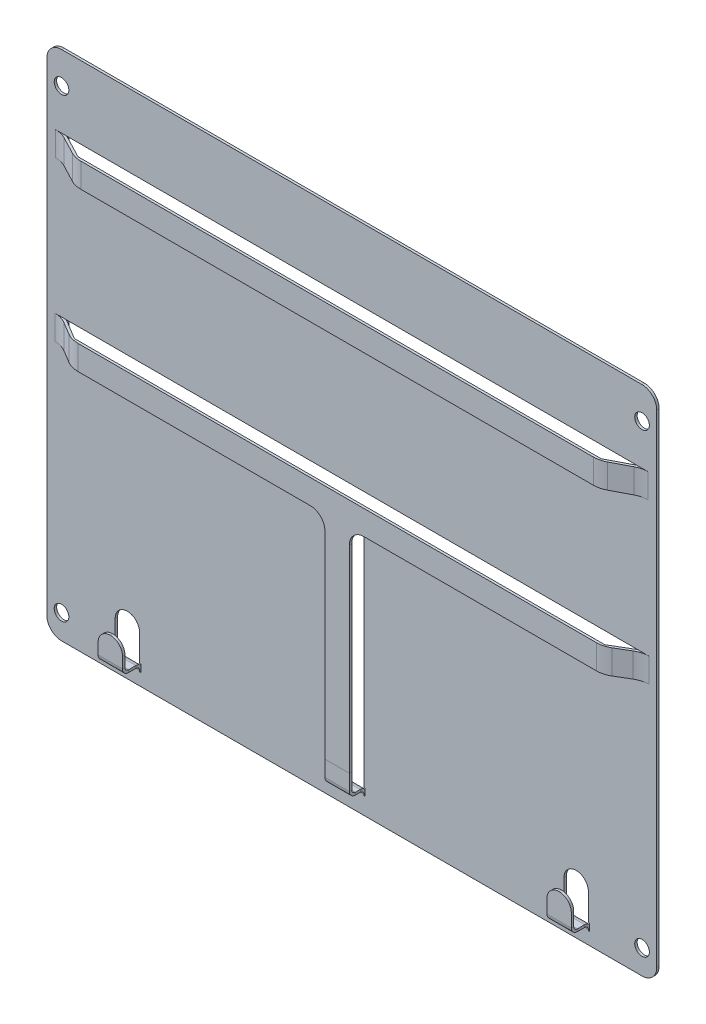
ISO-10303-21;
HEADER;
FILE_DESCRIPTION(('STEP AP214'),'2;1');
FILE_NAME('part.step','',(''),(''),'','','');
FILE_SCHEMA(('AUTOMOTIVE_DESIGN { 1 0 10303 214 1 1 1 1 }'));
ENDSEC;
DATA;
#1=APPLICATION_CONTEXT('core data for automotive mechanical design processes');
#2=APPLICATION_PROTOCOL_DEFINITION('international standard','automotive_design',2000,#1);
#3=PRODUCT_CONTEXT('',#1,'mechanical');
#4=PRODUCT('Part','Part','',(#3));
#5=PRODUCT_RELATED_PRODUCT_CATEGORY('part','',(#4));
#6=PRODUCT_DEFINITION_FORMATION('','',#4);
#7=PRODUCT_DEFINITION_CONTEXT('part definition',#1,'design');
#8=PRODUCT_DEFINITION('design','',#6,#7);
#9=PRODUCT_DEFINITION_SHAPE('','',#8);
#10=(LENGTH_UNIT() NAMED_UNIT(*) SI_UNIT(.MILLI.,.METRE.));
#11=(NAMED_UNIT(*) PLANE_ANGLE_UNIT() SI_UNIT($,.RADIAN.));
#12=(NAMED_UNIT(*) SI_UNIT($,.STERADIAN.) SOLID_ANGLE_UNIT());
#13=UNCERTAINTY_MEASURE_WITH_UNIT(LENGTH_MEASURE(1.E-05),#10,'distance_accuracy_value','');
#14=(GEOMETRIC_REPRESENTATION_CONTEXT(3) GLOBAL_UNCERTAINTY_ASSIGNED_CONTEXT((#13)) GLOBAL_UNIT_ASSIGNED_CONTEXT((#10,
#11,#12)) REPRESENTATION_CONTEXT('',''));
#15=CARTESIAN_POINT('',(0.,0.,0.));
#16=DIRECTION('',(0.,0.,1.));
#17=DIRECTION('',(1.,0.,0.));
#18=AXIS2_PLACEMENT_3D('',#15,#16,#17);
#19=CARTESIAN_POINT('',(-4.99999999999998,-95.,6.));
#20=DIRECTION('',(1.,0.,0.));
#21=DIRECTION('',(0.,0.,-1.));
#22=AXIS2_PLACEMENT_3D('',#19,#20,#21);
#23=PLANE('',#22);
#24=DIRECTION('',(0.,-1.,0.));
#25=VECTOR('',#24,1.);
#26=CARTESIAN_POINT('',(-4.99999999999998,-95.,3.50000000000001));
#27=LINE('',#26,#25);
#28=CARTESIAN_POINT('',(-4.99999999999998,-95.,3.50000000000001));
#29=VERTEX_POINT('',#28);
#30=CARTESIAN_POINT('',(-4.99999999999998,-96.,3.50000000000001));
#31=VERTEX_POINT('',#30);
#32=EDGE_CURVE('E896',#29,#31,#27,.T.);
#33=ORIENTED_EDGE('',*,*,#32,.F.);
#34=DIRECTION('',(0.,0.,1.));
#35=VECTOR('',#34,1.);
#36=CARTESIAN_POINT('',(-4.99999999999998,-95.,4.35971799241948E-13));
#37=LINE('',#36,#35);
#38=CARTESIAN_POINT('',(-4.99999999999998,-95.,1.5));
#39=VERTEX_POINT('',#38);
#40=EDGE_CURVE('E904',#39,#29,#37,.T.);
#41=ORIENTED_EDGE('',*,*,#40,.F.);
#42=DIRECTION('',(0.,-1.,0.));
#43=VECTOR('',#42,1.);
#44=CARTESIAN_POINT('',(-4.99999999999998,-96.,1.5));
#45=LINE('',#44,#43);
#46=CARTESIAN_POINT('',(-4.99999999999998,-96.,1.5));
#47=VERTEX_POINT('',#46);
#48=EDGE_CURVE('E915',#47,#39,#45,.F.);
#49=ORIENTED_EDGE('',*,*,#48,.F.);
#50=DIRECTION('',(0.,0.,-1.));
#51=VECTOR('',#50,1.);
#52=CARTESIAN_POINT('',(-4.99999999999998,-96.,6.));
#53=LINE('',#52,#51);
#54=EDGE_CURVE('E909',#47,#31,#53,.F.);
#55=ORIENTED_EDGE('',*,*,#54,.T.);
#56=EDGE_LOOP('',(#33,#41,#49,#55));
#57=FACE_BOUND('',#56,.T.);
#58=ADVANCED_FACE('F160',(#57),#23,.F.);
#59=CARTESIAN_POINT('',(5.00000000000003,-95.,0.));
#60=DIRECTION('',(-1.,0.,0.));
#61=DIRECTION('',(0.,0.,1.));
#62=AXIS2_PLACEMENT_3D('',#59,#60,#61);
#63=PLANE('',#62);
#64=DIRECTION('',(0.,-1.,0.));
#65=VECTOR('',#64,1.);
#66=CARTESIAN_POINT('',(5.00000000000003,-95.,3.50000000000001));
#67=LINE('',#66,#65);
#68=CARTESIAN_POINT('',(5.00000000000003,-95.,3.50000000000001));
#69=VERTEX_POINT('',#68);
#70=CARTESIAN_POINT('',(5.00000000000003,-96.,3.50000000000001));
#71=VERTEX_POINT('',#70);
#72=EDGE_CURVE('E885',#69,#71,#67,.T.);
#73=ORIENTED_EDGE('',*,*,#72,.T.);
#74=DIRECTION('',(0.,0.,1.));
#75=VECTOR('',#74,1.);
#76=CARTESIAN_POINT('',(5.00000000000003,-96.,0.));
#77=LINE('',#76,#75);
#78=CARTESIAN_POINT('',(5.00000000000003,-96.,1.5));
#79=VERTEX_POINT('',#78);
#80=EDGE_CURVE('E907',#71,#79,#77,.F.);
#81=ORIENTED_EDGE('',*,*,#80,.T.);
#82=DIRECTION('',(0.,-1.,0.));
#83=VECTOR('',#82,1.);
#84=CARTESIAN_POINT('',(5.00000000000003,-95.,1.5));
#85=LINE('',#84,#83);
#86=CARTESIAN_POINT('',(5.00000000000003,-95.,1.5));
#87=VERTEX_POINT('',#86);
#88=EDGE_CURVE('E898',#79,#87,#85,.F.);
#89=ORIENTED_EDGE('',*,*,#88,.T.);
#90=DIRECTION('',(0.,0.,-1.));
#91=VECTOR('',#90,1.);
#92=CARTESIAN_POINT('',(5.00000000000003,-95.,4.35971799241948E-13));
#93=LINE('',#92,#91);
#94=EDGE_CURVE('E901',#69,#87,#93,.T.);
#95=ORIENTED_EDGE('',*,*,#94,.F.);
#96=EDGE_LOOP('',(#73,#81,#89,#95));
#97=FACE_BOUND('',#96,.T.);
#98=ADVANCED_FACE('F2091',(#97),#63,.F.);
#99=CARTESIAN_POINT('',(0.,-95.,4.35971799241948E-13));
#100=DIRECTION('',(0.,-1.,0.));
#101=DIRECTION('',(0.,0.,-1.));
#102=AXIS2_PLACEMENT_3D('',#99,#100,#101);
#103=PLANE('',#102);
#104=DIRECTION('',(1.,0.,0.));
#105=VECTOR('',#104,1.);
#106=CARTESIAN_POINT('',(5.00000000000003,-95.,3.50000000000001));
#107=LINE('',#106,#105);
#108=EDGE_CURVE('E891',#69,#29,#107,.F.);
#109=ORIENTED_EDGE('',*,*,#108,.F.);
#110=ORIENTED_EDGE('',*,*,#94,.T.);
#111=DIRECTION('',(-1.,0.,0.));
#112=VECTOR('',#111,1.);
#113=CARTESIAN_POINT('',(5.00000000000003,-95.,1.5));
#114=LINE('',#113,#112);
#115=EDGE_CURVE('E912',#39,#87,#114,.F.);
#116=ORIENTED_EDGE('',*,*,#115,.F.);
#117=ORIENTED_EDGE('',*,*,#40,.T.);
#118=EDGE_LOOP('',(#109,#110,#116,#117));
#119=FACE_BOUND('',#118,.T.);
#120=ADVANCED_FACE('F2097',(#119),#103,.F.);
#121=CARTESIAN_POINT('',(0.,-96.,4.39463280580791E-13));
#122=DIRECTION('',(0.,-1.,0.));
#123=DIRECTION('',(0.,0.,-1.));
#124=AXIS2_PLACEMENT_3D('',#121,#122,#123);
#125=PLANE('',#124);
#126=ORIENTED_EDGE('',*,*,#80,.F.);
#127=DIRECTION('',(1.,0.,0.));
#128=VECTOR('',#127,1.);
#129=CARTESIAN_POINT('',(5.00000000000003,-96.,3.50000000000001));
#130=LINE('',#129,#128);
#131=EDGE_CURVE('E880',#71,#31,#130,.F.);
#132=ORIENTED_EDGE('',*,*,#131,.T.);
#133=ORIENTED_EDGE('',*,*,#54,.F.);
#134=DIRECTION('',(-1.,0.,0.));
#135=VECTOR('',#134,1.);
#136=CARTESIAN_POINT('',(5.00000000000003,-96.,1.5));
#137=LINE('',#136,#135);
#138=EDGE_CURVE('E918',#79,#47,#137,.T.);
#139=ORIENTED_EDGE('',*,*,#138,.F.);
#140=EDGE_LOOP('',(#126,#132,#133,#139));
#141=FACE_BOUND('',#140,.T.);
#142=ADVANCED_FACE('F3199',(#141),#125,.T.);
#143=CARTESIAN_POINT('',(-119.,-99.,-1.));
#144=DIRECTION('',(0.,0.,1.));
#145=DIRECTION('',(1.,0.,0.));
#146=AXIS2_PLACEMENT_3D('',#143,#144,#145);
#147=PLANE('',#146);
#148=DIRECTION('',(1.,0.,0.));
#149=VECTOR('',#148,1.);
#150=CARTESIAN_POINT('',(-119.,-97.,-1.));
#151=LINE('',#150,#149);
#152=CARTESIAN_POINT('',(86.5,-97.,-1.));
#153=VERTEX_POINT('',#152);
#154=CARTESIAN_POINT('',(87.,-97.,-1.));
#155=VERTEX_POINT('',#154);
#156=EDGE_CURVE('E1097',#153,#155,#151,.T.);
#157=ORIENTED_EDGE('',*,*,#156,.F.);
#158=DIRECTION('',(0.,1.,0.));
#159=VECTOR('',#158,1.);
#160=CARTESIAN_POINT('',(86.5,-99.,-1.));
#161=LINE('',#160,#159);
#162=CARTESIAN_POINT('',(86.5,-100.,-1.));
#163=VERTEX_POINT('',#162);
#164=EDGE_CURVE('E1156',#163,#153,#161,.T.);
#165=ORIENTED_EDGE('',*,*,#164,.F.);
#166=DIRECTION('',(-1.,0.,0.));
#167=VECTOR('',#166,1.);
#168=CARTESIAN_POINT('',(-119.,-100.,-1.));
#169=LINE('',#168,#167);
#170=CARTESIAN_POINT('',(87.,-100.,-1.));
#171=VERTEX_POINT('',#170);
#172=EDGE_CURVE('E1153',#171,#163,#169,.T.);
#173=ORIENTED_EDGE('',*,*,#172,.F.);
#174=DIRECTION('',(0.,-1.,0.));
#175=VECTOR('',#174,1.);
#176=CARTESIAN_POINT('',(87.,-99.,-1.));
#177=LINE('',#176,#175);
#178=CARTESIAN_POINT('',(87.,-99.5,-0.99999999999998));
#179=VERTEX_POINT('',#178);
#180=EDGE_CURVE('E1150',#179,#171,#177,.T.);
#181=ORIENTED_EDGE('',*,*,#180,.F.);
#182=DIRECTION('',(-1.,0.,0.));
#183=VECTOR('',#182,1.);
#184=CARTESIAN_POINT('',(87.,-99.5,-0.99999999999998));
#185=LINE('',#184,#183);
#186=CARTESIAN_POINT('',(97.,-99.5,-1.));
#187=VERTEX_POINT('',#186);
#188=EDGE_CURVE('E1072',#179,#187,#185,.F.);
#189=ORIENTED_EDGE('',*,*,#188,.T.);
#190=DIRECTION('',(0.,1.,0.));
#191=VECTOR('',#190,1.);
#192=CARTESIAN_POINT('',(97.,-99.,-1.));
#193=LINE('',#192,#191);
#194=CARTESIAN_POINT('',(97.,-100.,-1.));
#195=VERTEX_POINT('',#194);
#196=EDGE_CURVE('E1147',#195,#187,#193,.T.);
#197=ORIENTED_EDGE('',*,*,#196,.F.);
#198=DIRECTION('',(-1.,0.,0.));
#199=VECTOR('',#198,1.);
#200=CARTESIAN_POINT('',(-119.,-100.,-1.));
#201=LINE('',#200,#199);
#202=CARTESIAN_POINT('',(97.5,-100.,-1.));
#203=VERTEX_POINT('',#202);
#204=EDGE_CURVE('E1144',#203,#195,#201,.T.);
#205=ORIENTED_EDGE('',*,*,#204,.F.);
#206=DIRECTION('',(0.,-1.,0.));
#207=VECTOR('',#206,1.);
#208=CARTESIAN_POINT('',(97.5,-99.,-1.));
#209=LINE('',#208,#207);
#210=CARTESIAN_POINT('',(97.5,-97.,-1.));
#211=VERTEX_POINT('',#210);
#212=EDGE_CURVE('E1141',#211,#203,#209,.T.);
#213=ORIENTED_EDGE('',*,*,#212,.F.);
#214=DIRECTION('',(1.,0.,0.));
#215=VECTOR('',#214,1.);
#216=CARTESIAN_POINT('',(-119.,-97.,-1.));
#217=LINE('',#216,#215);
#218=CARTESIAN_POINT('',(97.,-97.,-0.999999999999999));
#219=VERTEX_POINT('',#218);
#220=EDGE_CURVE('E1138',#219,#211,#217,.T.);
#221=ORIENTED_EDGE('',*,*,#220,.F.);
#222=DIRECTION('',(0.,1.,0.));
#223=VECTOR('',#222,1.);
#224=CARTESIAN_POINT('',(97.,-99.,-1.));
#225=LINE('',#224,#223);
#226=CARTESIAN_POINT('',(97.,-86.,-0.999999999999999));
#227=VERTEX_POINT('',#226);
#228=EDGE_CURVE('E1350',#219,#227,#225,.T.);
#229=ORIENTED_EDGE('',*,*,#228,.T.);
#230=CARTESIAN_POINT('',(92.,-86.,-0.999999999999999));
#231=DIRECTION('',(0.,0.,1.));
#232=DIRECTION('',(1.,0.,0.));
#233=AXIS2_PLACEMENT_3D('',#230,#231,#232);
#234=CIRCLE('',#233,5.00000000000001);
#235=CARTESIAN_POINT('',(87.,-86.,-0.999999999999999));
#236=VERTEX_POINT('',#235);
#237=EDGE_CURVE('E1353',#227,#236,#234,.T.);
#238=ORIENTED_EDGE('',*,*,#237,.T.);
#239=DIRECTION('',(0.,-1.,0.));
#240=VECTOR('',#239,1.);
#241=CARTESIAN_POINT('',(87.,-98.9999999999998,-1.));
#242=LINE('',#241,#240);
#243=EDGE_CURVE('E1325',#236,#155,#242,.T.);
#244=ORIENTED_EDGE('',*,*,#243,.T.);
#245=EDGE_LOOP('',(#157,#165,#173,#181,#189,#197,#205,#213,#221,#229,#238,#244));
#246=FACE_BOUND('',#245,.T.);
#247=CARTESIAN_POINT('',(-119.,-99.,-1.));
#248=DIRECTION('',(0.,0.,1.));
#249=DIRECTION('',(1.,0.,0.));
#250=AXIS2_PLACEMENT_3D('',#247,#248,#249);
#251=CIRCLE('',#250,6.00000000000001);
#252=CARTESIAN_POINT('',(-125.,-99.,-1.));
#253=VERTEX_POINT('',#252);
#254=CARTESIAN_POINT('',(-119.,-105.,-1.));
#255=VERTEX_POINT('',#254);
#256=EDGE_CURVE('E1631',#253,#255,#251,.T.);
#257=ORIENTED_EDGE('',*,*,#256,.F.);
#258=DIRECTION('',(0.,-1.,0.));
#259=VECTOR('',#258,1.);
#260=CARTESIAN_POINT('',(-125.,98.9999999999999,-1.));
#261=LINE('',#260,#259);
#262=CARTESIAN_POINT('',(-125.,98.9999999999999,-1.));
#263=VERTEX_POINT('',#262);
#264=EDGE_CURVE('E1653',#263,#253,#261,.T.);
#265=ORIENTED_EDGE('',*,*,#264,.F.);
#266=CARTESIAN_POINT('',(-119.,99.,-1.));
#267=DIRECTION('',(0.,0.,1.));
#268=DIRECTION('',(-1.,0.,0.));
#269=AXIS2_PLACEMENT_3D('',#266,#267,#268);
#270=CIRCLE('',#269,6.00000000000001);
#271=CARTESIAN_POINT('',(-119.,105.,-1.));
#272=VERTEX_POINT('',#271);
#273=EDGE_CURVE('E1650',#272,#263,#270,.T.);
#274=ORIENTED_EDGE('',*,*,#273,.F.);
#275=DIRECTION('',(-1.,0.,0.));
#276=VECTOR('',#275,1.);
#277=CARTESIAN_POINT('',(-119.,105.,-1.));
#278=LINE('',#277,#276);
#279=CARTESIAN_POINT('',(119.,105.,-1.));
#280=VERTEX_POINT('',#279);
#281=EDGE_CURVE('E1647',#280,#272,#278,.T.);
#282=ORIENTED_EDGE('',*,*,#281,.F.);
#283=CARTESIAN_POINT('',(119.,99.,-1.));
#284=DIRECTION('',(0.,0.,1.));
#285=DIRECTION('',(1.,0.,0.));
#286=AXIS2_PLACEMENT_3D('',#283,#284,#285);
#287=CIRCLE('',#286,6.00000000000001);
#288=CARTESIAN_POINT('',(125.,98.9999999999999,-1.));
#289=VERTEX_POINT('',#288);
#290=EDGE_CURVE('E1644',#289,#280,#287,.T.);
#291=ORIENTED_EDGE('',*,*,#290,.F.);
#292=DIRECTION('',(0.,1.,0.));
#293=VECTOR('',#292,1.);
#294=CARTESIAN_POINT('',(125.,98.9999999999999,-1.));
#295=LINE('',#294,#293);
#296=CARTESIAN_POINT('',(125.,-99.,-1.));
#297=VERTEX_POINT('',#296);
#298=EDGE_CURVE('E1641',#297,#289,#295,.T.);
#299=ORIENTED_EDGE('',*,*,#298,.F.);
#300=CARTESIAN_POINT('',(119.,-99.,-1.));
#301=DIRECTION('',(0.,0.,1.));
#302=DIRECTION('',(1.,0.,0.));
#303=AXIS2_PLACEMENT_3D('',#300,#301,#302);
#304=CIRCLE('',#303,6.00000000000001);
#305=CARTESIAN_POINT('',(119.,-105.,-1.));
#306=VERTEX_POINT('',#305);
#307=EDGE_CURVE('E1638',#306,#297,#304,.T.);
#308=ORIENTED_EDGE('',*,*,#307,.F.);
#309=DIRECTION('',(1.,0.,0.));
#310=VECTOR('',#309,1.);
#311=CARTESIAN_POINT('',(-119.,-105.,-1.));
#312=LINE('',#311,#310);
#313=EDGE_CURVE('E1634',#255,#306,#312,.T.);
#314=ORIENTED_EDGE('',*,*,#313,.F.);
#315=EDGE_LOOP('',(#257,#265,#274,#282,#291,#299,#308,#314));
#316=FACE_BOUND('',#315,.T.);
#317=CARTESIAN_POINT('',(119.,92.,-1.));
#318=DIRECTION('',(0.,0.,1.));
#319=DIRECTION('',(1.,0.,0.));
#320=AXIS2_PLACEMENT_3D('',#317,#318,#319);
#321=CIRCLE('',#320,3.);
#322=CARTESIAN_POINT('',(122.,92.,-1.));
#323=VERTEX_POINT('',#322);
#324=EDGE_CURVE('E1627',#323,#323,#321,.T.);
#325=ORIENTED_EDGE('',*,*,#324,.T.);
#326=EDGE_LOOP('',(#325));
#327=FACE_BOUND('',#326,.T.);
#328=CARTESIAN_POINT('',(119.,-95.,-1.));
#329=DIRECTION('',(0.,0.,1.));
#330=DIRECTION('',(1.,0.,0.));
#331=AXIS2_PLACEMENT_3D('',#328,#329,#330);
#332=CIRCLE('',#331,3.);
#333=CARTESIAN_POINT('',(122.,-95.,-1.));
#334=VERTEX_POINT('',#333);
#335=EDGE_CURVE('E1621',#334,#334,#332,.T.);
#336=ORIENTED_EDGE('',*,*,#335,.T.);
#337=EDGE_LOOP('',(#336));
#338=FACE_BOUND('',#337,.T.);
#339=CARTESIAN_POINT('',(-119.,-95.,-1.));
#340=DIRECTION('',(0.,0.,1.));
#341=DIRECTION('',(1.,0.,0.));
#342=AXIS2_PLACEMENT_3D('',#339,#340,#341);
#343=CIRCLE('',#342,3.);
#344=CARTESIAN_POINT('',(-116.,-95.,-1.));
#345=VERTEX_POINT('',#344);
#346=EDGE_CURVE('E1615',#345,#345,#343,.T.);
#347=ORIENTED_EDGE('',*,*,#346,.T.);
#348=EDGE_LOOP('',(#347));
#349=FACE_BOUND('',#348,.T.);
#350=CARTESIAN_POINT('',(-119.,92.,-1.));
#351=DIRECTION('',(0.,0.,1.));
#352=DIRECTION('',(1.,0.,0.));
#353=AXIS2_PLACEMENT_3D('',#350,#351,#352);
#354=CIRCLE('',#353,3.);
#355=CARTESIAN_POINT('',(-116.,92.,-1.));
#356=VERTEX_POINT('',#355);
#357=EDGE_CURVE('E1609',#356,#356,#354,.T.);
#358=ORIENTED_EDGE('',*,*,#357,.T.);
#359=EDGE_LOOP('',(#358));
#360=FACE_BOUND('',#359,.T.);
#361=DIRECTION('',(-1.,0.,0.));
#362=VECTOR('',#361,1.);
#363=CARTESIAN_POINT('',(-119.,75.2908473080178,-1.));
#364=LINE('',#363,#362);
#365=CARTESIAN_POINT('',(117.,75.2908473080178,-0.999999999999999));
#366=VERTEX_POINT('',#365);
#367=CARTESIAN_POINT('',(-117.,75.2908473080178,-0.999999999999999));
#368=VERTEX_POINT('',#367);
#369=EDGE_CURVE('E1600',#366,#368,#364,.T.);
#370=ORIENTED_EDGE('',*,*,#369,.T.);
#371=DIRECTION('',(0.,-1.,0.));
#372=VECTOR('',#371,1.);
#373=CARTESIAN_POINT('',(-117.,-99.,-1.));
#374=LINE('',#373,#372);
#375=CARTESIAN_POINT('',(-117.,65.2908473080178,-0.999999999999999));
#376=VERTEX_POINT('',#375);
#377=EDGE_CURVE('E1603',#368,#376,#374,.T.);
#378=ORIENTED_EDGE('',*,*,#377,.T.);
#379=DIRECTION('',(1.,0.,0.));
#380=VECTOR('',#379,1.);
#381=CARTESIAN_POINT('',(-119.,65.2908473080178,-1.));
#382=LINE('',#381,#380);
#383=CARTESIAN_POINT('',(117.,65.2908473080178,-1.));
#384=VERTEX_POINT('',#383);
#385=EDGE_CURVE('E1586',#376,#384,#382,.T.);
#386=ORIENTED_EDGE('',*,*,#385,.T.);
#387=DIRECTION('',(0.,1.,0.));
#388=VECTOR('',#387,1.);
#389=CARTESIAN_POINT('',(117.,-99.,-1.));
#390=LINE('',#389,#388);
#391=EDGE_CURVE('E1597',#384,#366,#390,.T.);
#392=ORIENTED_EDGE('',*,*,#391,.T.);
#393=EDGE_LOOP('',(#370,#378,#386,#392));
#394=FACE_BOUND('',#393,.T.);
#395=DIRECTION('',(1.,0.,0.));
#396=VECTOR('',#395,1.);
#397=CARTESIAN_POINT('',(-119.,-97.,-1.));
#398=LINE('',#397,#396);
#399=CARTESIAN_POINT('',(-97.5,-97.,-1.));
#400=VERTEX_POINT('',#399);
#401=CARTESIAN_POINT('',(-97.,-97.,-1.));
#402=VERTEX_POINT('',#401);
#403=EDGE_CURVE('E1251',#400,#402,#398,.T.);
#404=ORIENTED_EDGE('',*,*,#403,.F.);
#405=DIRECTION('',(0.,1.,0.));
#406=VECTOR('',#405,1.);
#407=CARTESIAN_POINT('',(-97.5,-99.,-1.));
#408=LINE('',#407,#406);
#409=CARTESIAN_POINT('',(-97.5,-100.,-1.));
#410=VERTEX_POINT('',#409);
#411=EDGE_CURVE('E1310',#410,#400,#408,.T.);
#412=ORIENTED_EDGE('',*,*,#411,.F.);
#413=DIRECTION('',(-1.,0.,0.));
#414=VECTOR('',#413,1.);
#415=CARTESIAN_POINT('',(-119.,-100.,-1.));
#416=LINE('',#415,#414);
#417=CARTESIAN_POINT('',(-97.,-100.,-1.));
#418=VERTEX_POINT('',#417);
#419=EDGE_CURVE('E1307',#418,#410,#416,.T.);
#420=ORIENTED_EDGE('',*,*,#419,.F.);
#421=DIRECTION('',(0.,-1.,0.));
#422=VECTOR('',#421,1.);
#423=CARTESIAN_POINT('',(-97.,-99.,-1.));
#424=LINE('',#423,#422);
#425=CARTESIAN_POINT('',(-97.,-99.5,-0.999999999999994));
#426=VERTEX_POINT('',#425);
#427=EDGE_CURVE('E1304',#426,#418,#424,.T.);
#428=ORIENTED_EDGE('',*,*,#427,.F.);
#429=DIRECTION('',(-1.,0.,0.));
#430=VECTOR('',#429,1.);
#431=CARTESIAN_POINT('',(-97.,-99.5,-0.999999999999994));
#432=LINE('',#431,#430);
#433=CARTESIAN_POINT('',(-87.,-99.5,-1.));
#434=VERTEX_POINT('',#433);
#435=EDGE_CURVE('E1226',#426,#434,#432,.F.);
#436=ORIENTED_EDGE('',*,*,#435,.T.);
#437=DIRECTION('',(0.,1.,0.));
#438=VECTOR('',#437,1.);
#439=CARTESIAN_POINT('',(-87.,-99.,-1.));
#440=LINE('',#439,#438);
#441=CARTESIAN_POINT('',(-87.,-100.,-1.));
#442=VERTEX_POINT('',#441);
#443=EDGE_CURVE('E1301',#442,#434,#440,.T.);
#444=ORIENTED_EDGE('',*,*,#443,.F.);
#445=DIRECTION('',(-1.,0.,0.));
#446=VECTOR('',#445,1.);
#447=CARTESIAN_POINT('',(-119.,-100.,-1.));
#448=LINE('',#447,#446);
#449=CARTESIAN_POINT('',(-86.5,-100.,-1.));
#450=VERTEX_POINT('',#449);
#451=EDGE_CURVE('E1298',#450,#442,#448,.T.);
#452=ORIENTED_EDGE('',*,*,#451,.F.);
#453=DIRECTION('',(0.,-1.,0.));
#454=VECTOR('',#453,1.);
#455=CARTESIAN_POINT('',(-86.5,-99.,-1.));
#456=LINE('',#455,#454);
#457=CARTESIAN_POINT('',(-86.5,-97.,-1.));
#458=VERTEX_POINT('',#457);
#459=EDGE_CURVE('E1295',#458,#450,#456,.T.);
#460=ORIENTED_EDGE('',*,*,#459,.F.);
#461=DIRECTION('',(1.,0.,0.));
#462=VECTOR('',#461,1.);
#463=CARTESIAN_POINT('',(-119.,-97.,-1.));
#464=LINE('',#463,#462);
#465=CARTESIAN_POINT('',(-87.,-97.,-0.999999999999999));
#466=VERTEX_POINT('',#465);
#467=EDGE_CURVE('E1292',#466,#458,#464,.T.);
#468=ORIENTED_EDGE('',*,*,#467,.F.);
#469=DIRECTION('',(0.,1.,0.));
#470=VECTOR('',#469,1.);
#471=CARTESIAN_POINT('',(-87.,-99.,-1.));
#472=LINE('',#471,#470);
#473=CARTESIAN_POINT('',(-87.,-86.,-0.999999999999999));
#474=VERTEX_POINT('',#473);
#475=EDGE_CURVE('E1359',#466,#474,#472,.T.);
#476=ORIENTED_EDGE('',*,*,#475,.T.);
#477=CARTESIAN_POINT('',(-92.,-86.,-0.999999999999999));
#478=DIRECTION('',(0.,0.,1.));
#479=DIRECTION('',(1.,0.,0.));
#480=AXIS2_PLACEMENT_3D('',#477,#478,#479);
#481=CIRCLE('',#480,5.);
#482=CARTESIAN_POINT('',(-97.,-86.,-0.999999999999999));
#483=VERTEX_POINT('',#482);
#484=EDGE_CURVE('E1362',#474,#483,#481,.T.);
#485=ORIENTED_EDGE('',*,*,#484,.T.);
#486=DIRECTION('',(0.,-1.,0.));
#487=VECTOR('',#486,1.);
#488=CARTESIAN_POINT('',(-97.,-99.,-1.));
#489=LINE('',#488,#487);
#490=EDGE_CURVE('E1356',#483,#402,#489,.T.);
#491=ORIENTED_EDGE('',*,*,#490,.T.);
#492=EDGE_LOOP('',(#404,#412,#420,#428,#436,#444,#452,#460,#468,#476,#485,#491));
#493=FACE_BOUND('',#492,.T.);
#494=DIRECTION('',(1.,0.,0.));
#495=VECTOR('',#494,1.);
#496=CARTESIAN_POINT('',(-119.,-95.,-1.));
#497=LINE('',#496,#495);
#498=CARTESIAN_POINT('',(-5.49999999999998,-95.,-1.));
#499=VERTEX_POINT('',#498);
#500=CARTESIAN_POINT('',(-4.99999999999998,-95.,-0.999999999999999));
#501=VERTEX_POINT('',#500);
#502=EDGE_CURVE('E184',#499,#501,#497,.T.);
#503=ORIENTED_EDGE('',*,*,#502,.F.);
#504=DIRECTION('',(0.,1.,0.));
#505=VECTOR('',#504,1.);
#506=CARTESIAN_POINT('',(-5.49999999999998,-99.,-1.));
#507=LINE('',#506,#505);
#508=CARTESIAN_POINT('',(-5.49999999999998,-98.,-1.));
#509=VERTEX_POINT('',#508);
#510=EDGE_CURVE('E1004',#509,#499,#507,.T.);
#511=ORIENTED_EDGE('',*,*,#510,.F.);
#512=DIRECTION('',(-1.,0.,0.));
#513=VECTOR('',#512,1.);
#514=CARTESIAN_POINT('',(-119.,-98.,-1.));
#515=LINE('',#514,#513);
#516=CARTESIAN_POINT('',(-4.99999999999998,-98.,-1.));
#517=VERTEX_POINT('',#516);
#518=EDGE_CURVE('E1001',#517,#509,#515,.T.);
#519=ORIENTED_EDGE('',*,*,#518,.F.);
#520=DIRECTION('',(0.,-1.,0.));
#521=VECTOR('',#520,1.);
#522=CARTESIAN_POINT('',(-4.99999999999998,-99.,-1.));
#523=LINE('',#522,#521);
#524=CARTESIAN_POINT('',(-4.99999999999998,-97.5,-0.999999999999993));
#525=VERTEX_POINT('',#524);
#526=EDGE_CURVE('E998',#525,#517,#523,.T.);
#527=ORIENTED_EDGE('',*,*,#526,.F.);
#528=DIRECTION('',(-1.,0.,0.));
#529=VECTOR('',#528,1.);
#530=CARTESIAN_POINT('',(-4.99999999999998,-97.5,-0.999999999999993));
#531=LINE('',#530,#529);
#532=CARTESIAN_POINT('',(5.00000000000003,-97.5,-1.));
#533=VERTEX_POINT('',#532);
#534=EDGE_CURVE('E922',#525,#533,#531,.F.);
#535=ORIENTED_EDGE('',*,*,#534,.T.);
#536=DIRECTION('',(0.,1.,0.));
#537=VECTOR('',#536,1.);
#538=CARTESIAN_POINT('',(5.00000000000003,-99.,-1.));
#539=LINE('',#538,#537);
#540=CARTESIAN_POINT('',(5.00000000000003,-98.,-1.));
#541=VERTEX_POINT('',#540);
#542=EDGE_CURVE('E995',#541,#533,#539,.T.);
#543=ORIENTED_EDGE('',*,*,#542,.F.);
#544=DIRECTION('',(-1.,0.,0.));
#545=VECTOR('',#544,1.);
#546=CARTESIAN_POINT('',(-119.,-98.,-1.));
#547=LINE('',#546,#545);
#548=CARTESIAN_POINT('',(5.50000000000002,-98.,-1.));
#549=VERTEX_POINT('',#548);
#550=EDGE_CURVE('E992',#549,#541,#547,.T.);
#551=ORIENTED_EDGE('',*,*,#550,.F.);
#552=DIRECTION('',(0.,-1.,0.));
#553=VECTOR('',#552,1.);
#554=CARTESIAN_POINT('',(5.50000000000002,-99.,-1.));
#555=LINE('',#554,#553);
#556=CARTESIAN_POINT('',(5.50000000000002,-95.,-1.));
#557=VERTEX_POINT('',#556);
#558=EDGE_CURVE('E989',#557,#549,#555,.T.);
#559=ORIENTED_EDGE('',*,*,#558,.F.);
#560=DIRECTION('',(1.,0.,0.));
#561=VECTOR('',#560,1.);
#562=CARTESIAN_POINT('',(-119.,-95.,-1.));
#563=LINE('',#562,#561);
#564=CARTESIAN_POINT('',(5.00000000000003,-95.,-0.999999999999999));
#565=VERTEX_POINT('',#564);
#566=EDGE_CURVE('E986',#565,#557,#563,.T.);
#567=ORIENTED_EDGE('',*,*,#566,.F.);
#568=DIRECTION('',(0.,1.,0.));
#569=VECTOR('',#568,1.);
#570=CARTESIAN_POINT('',(5.00000000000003,-99.,-1.));
#571=LINE('',#570,#569);
#572=CARTESIAN_POINT('',(5.00000000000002,-6.00000000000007,-0.999999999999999));
#573=VERTEX_POINT('',#572);
#574=EDGE_CURVE('E1509',#565,#573,#571,.T.);
#575=ORIENTED_EDGE('',*,*,#574,.T.);
#576=CARTESIAN_POINT('',(11.,-6.00000000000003,-0.999999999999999));
#577=DIRECTION('',(0.,0.,1.));
#578=DIRECTION('',(1.,0.,0.));
#579=AXIS2_PLACEMENT_3D('',#576,#577,#578);
#580=CIRCLE('',#579,6.);
#581=CARTESIAN_POINT('',(11.0000000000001,0.,-0.999999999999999));
#582=VERTEX_POINT('',#581);
#583=EDGE_CURVE('E1512',#573,#582,#580,.F.);
#584=ORIENTED_EDGE('',*,*,#583,.T.);
#585=DIRECTION('',(1.,0.,0.));
#586=VECTOR('',#585,1.);
#587=CARTESIAN_POINT('',(-119.,0.,-1.));
#588=LINE('',#587,#586);
#589=CARTESIAN_POINT('',(117.,0.,-0.999999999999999));
#590=VERTEX_POINT('',#589);
#591=EDGE_CURVE('E1515',#582,#590,#588,.T.);
#592=ORIENTED_EDGE('',*,*,#591,.T.);
#593=DIRECTION('',(0.,1.,0.));
#594=VECTOR('',#593,1.);
#595=CARTESIAN_POINT('',(117.,-99.,-1.));
#596=LINE('',#595,#594);
#597=CARTESIAN_POINT('',(117.,9.99999999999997,-0.999999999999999));
#598=VERTEX_POINT('',#597);
#599=EDGE_CURVE('E1518',#590,#598,#596,.T.);
#600=ORIENTED_EDGE('',*,*,#599,.T.);
#601=DIRECTION('',(-1.,0.,0.));
#602=VECTOR('',#601,1.);
#603=CARTESIAN_POINT('',(-119.,9.99999999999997,-1.));
#604=LINE('',#603,#602);
#605=CARTESIAN_POINT('',(-117.,9.99999999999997,-0.999999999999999));
#606=VERTEX_POINT('',#605);
#607=EDGE_CURVE('E1521',#598,#606,#604,.T.);
#608=ORIENTED_EDGE('',*,*,#607,.T.);
#609=DIRECTION('',(0.,-1.,0.));
#610=VECTOR('',#609,1.);
#611=CARTESIAN_POINT('',(-117.,-99.,-1.));
#612=LINE('',#611,#610);
#613=CARTESIAN_POINT('',(-117.,0.,-0.999999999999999));
#614=VERTEX_POINT('',#613);
#615=EDGE_CURVE('E1524',#606,#614,#612,.T.);
#616=ORIENTED_EDGE('',*,*,#615,.T.);
#617=DIRECTION('',(1.,0.,0.));
#618=VECTOR('',#617,1.);
#619=CARTESIAN_POINT('',(-119.,0.,-1.));
#620=LINE('',#619,#618);
#621=CARTESIAN_POINT('',(-11.,0.,-1.));
#622=VERTEX_POINT('',#621);
#623=EDGE_CURVE('E1482',#614,#622,#620,.T.);
#624=ORIENTED_EDGE('',*,*,#623,.T.);
#625=CARTESIAN_POINT('',(-11.,-6.00000000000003,-0.999999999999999));
#626=DIRECTION('',(0.,0.,1.));
#627=DIRECTION('',(1.,0.,0.));
#628=AXIS2_PLACEMENT_3D('',#625,#626,#627);
#629=CIRCLE('',#628,6.);
#630=CARTESIAN_POINT('',(-4.99999999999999,-6.00000000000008,-0.999999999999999));
#631=VERTEX_POINT('',#630);
#632=EDGE_CURVE('E1504',#622,#631,#629,.F.);
#633=ORIENTED_EDGE('',*,*,#632,.T.);
#634=DIRECTION('',(0.,-1.,0.));
#635=VECTOR('',#634,1.);
#636=CARTESIAN_POINT('',(-4.99999999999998,-99.,-1.));
#637=LINE('',#636,#635);
#638=EDGE_CURVE('E1507',#631,#501,#637,.T.);
#639=ORIENTED_EDGE('',*,*,#638,.T.);
#640=EDGE_LOOP('',(#503,#511,#519,#527,#535,#543,#551,#559,#567,#575,#584,#592,#600,#608,#616,
#624,#633,#639));
#641=FACE_BOUND('',#640,.T.);
#642=ADVANCED_FACE('F2042',(#246,#316,#327,#338,#349,#360,#394,#493,#641),#147,.F.);
#643=CARTESIAN_POINT('',(-119.,-99.,0.));
#644=DIRECTION('',(0.,0.,1.));
#645=DIRECTION('',(1.,0.,0.));
#646=AXIS2_PLACEMENT_3D('',#643,#644,#645);
#647=PLANE('',#646);
#648=DIRECTION('',(0.,-1.,0.));
#649=VECTOR('',#648,1.);
#650=CARTESIAN_POINT('',(121.880800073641,-98.9999999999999,0.));
#651=LINE('',#650,#649);
#652=CARTESIAN_POINT('',(121.880800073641,10.,0.));
#653=VERTEX_POINT('',#652);
#654=CARTESIAN_POINT('',(121.880800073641,0.,0.));
#655=VERTEX_POINT('',#654);
#656=EDGE_CURVE('E1924',#653,#655,#651,.T.);
#657=ORIENTED_EDGE('',*,*,#656,.T.);
#658=DIRECTION('',(-1.,0.,0.));
#659=VECTOR('',#658,1.);
#660=CARTESIAN_POINT('',(-119.,0.,0.));
#661=LINE('',#660,#659);
#662=CARTESIAN_POINT('',(117.180594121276,0.,0.));
#663=VERTEX_POINT('',#662);
#664=EDGE_CURVE('E1372',#655,#663,#661,.T.);
#665=ORIENTED_EDGE('',*,*,#664,.T.);
#666=DIRECTION('',(0.,-1.,0.));
#667=VECTOR('',#666,1.);
#668=CARTESIAN_POINT('',(117.180594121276,-98.9999999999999,0.));
#669=LINE('',#668,#667);
#670=CARTESIAN_POINT('',(117.180594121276,10.,0.));
#671=VERTEX_POINT('',#670);
#672=EDGE_CURVE('E1379',#671,#663,#669,.T.);
#673=ORIENTED_EDGE('',*,*,#672,.F.);
#674=DIRECTION('',(-1.,0.,0.));
#675=VECTOR('',#674,1.);
#676=CARTESIAN_POINT('',(-119.,9.99999999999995,0.));
#677=LINE('',#676,#675);
#678=EDGE_CURVE('E1377',#653,#671,#677,.T.);
#679=ORIENTED_EDGE('',*,*,#678,.F.);
#680=EDGE_LOOP('',(#657,#665,#673,#679));
#681=FACE_BOUND('',#680,.T.);
#682=DIRECTION('',(-1.,0.,0.));
#683=VECTOR('',#682,1.);
#684=CARTESIAN_POINT('',(-119.,0.,0.));
#685=LINE('',#684,#683);
#686=CARTESIAN_POINT('',(-117.056349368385,0.,0.));
#687=VERTEX_POINT('',#686);
#688=CARTESIAN_POINT('',(-121.769839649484,0.,0.));
#689=VERTEX_POINT('',#688);
#690=EDGE_CURVE('E1886',#687,#689,#685,.T.);
#691=ORIENTED_EDGE('',*,*,#690,.T.);
#692=DIRECTION('',(0.,-1.,0.));
#693=VECTOR('',#692,1.);
#694=CARTESIAN_POINT('',(-121.769839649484,-99.,0.));
#695=LINE('',#694,#693);
#696=CARTESIAN_POINT('',(-121.769839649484,9.99999999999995,0.));
#697=VERTEX_POINT('',#696);
#698=EDGE_CURVE('E1904',#689,#697,#695,.F.);
#699=ORIENTED_EDGE('',*,*,#698,.T.);
#700=DIRECTION('',(-1.,0.,0.));
#701=VECTOR('',#700,1.);
#702=CARTESIAN_POINT('',(-119.,9.99999999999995,0.));
#703=LINE('',#702,#701);
#704=CARTESIAN_POINT('',(-117.056349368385,9.99999999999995,0.));
#705=VERTEX_POINT('',#704);
#706=EDGE_CURVE('E1899',#705,#697,#703,.T.);
#707=ORIENTED_EDGE('',*,*,#706,.F.);
#708=DIRECTION('',(0.,1.,0.));
#709=VECTOR('',#708,1.);
#710=CARTESIAN_POINT('',(-117.056349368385,-99.,0.));
#711=LINE('',#710,#709);
#712=EDGE_CURVE('E1890',#687,#705,#711,.T.);
#713=ORIENTED_EDGE('',*,*,#712,.F.);
#714=EDGE_LOOP('',(#691,#699,#707,#713));
#715=FACE_BOUND('',#714,.T.);
#716=CARTESIAN_POINT('',(121.451869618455,95.2908473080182,0.));
#717=CARTESIAN_POINT('',(121.451869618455,88.6241806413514,0.));
#718=CARTESIAN_POINT('',(121.451869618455,81.9575139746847,0.));
#719=CARTESIAN_POINT('',(121.451869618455,75.2908473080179,0.));
#720=CARTESIAN_POINT('',(121.451869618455,71.9575139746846,0.));
#721=CARTESIAN_POINT('',(121.451869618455,68.6241806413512,0.));
#722=CARTESIAN_POINT('',(121.451869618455,65.2908473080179,0.));
#723=CARTESIAN_POINT('',(121.451869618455,58.6241806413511,0.));
#724=CARTESIAN_POINT('',(121.451869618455,51.9575139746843,0.));
#725=CARTESIAN_POINT('',(121.451869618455,45.2908473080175,0.));
#726=(BOUNDED_CURVE() B_SPLINE_CURVE(3,(#716,#717,#718,#719,#720,#721,#722,#723,#724,#725),
.UNSPECIFIED.,.F.,.F.) B_SPLINE_CURVE_WITH_KNOTS((4,3,3,4),(-0.0200000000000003,0.,0.01,
0.0300000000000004),
.UNSPECIFIED.) CURVE() GEOMETRIC_REPRESENTATION_ITEM() RATIONAL_B_SPLINE_CURVE((1.,1.,1.,1.,1.,
1.,1.,1.,1.,1.)) REPRESENTATION_ITEM(''));
#727=CARTESIAN_POINT('',(121.451869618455,75.2908473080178,0.));
#728=VERTEX_POINT('',#727);
#729=CARTESIAN_POINT('',(121.451869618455,65.2908473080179,0.));
#730=VERTEX_POINT('',#729);
#731=EDGE_CURVE('E1704',#728,#730,#726,.T.);
#732=ORIENTED_EDGE('',*,*,#731,.T.);
#733=DIRECTION('',(1.,0.,0.));
#734=VECTOR('',#733,1.);
#735=CARTESIAN_POINT('',(-117.,65.2908473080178,0.));
#736=LINE('',#735,#734);
#737=CARTESIAN_POINT('',(116.838146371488,65.2908473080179,0.));
#738=VERTEX_POINT('',#737);
#739=EDGE_CURVE('E1574',#738,#730,#736,.T.);
#740=ORIENTED_EDGE('',*,*,#739,.F.);
#741=CARTESIAN_POINT('',(-116.838146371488,65.2908473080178,0.));
#742=VERTEX_POINT('',#741);
#743=EDGE_CURVE('E1579',#742,#738,#736,.T.);
#744=ORIENTED_EDGE('',*,*,#743,.F.);
#745=CARTESIAN_POINT('',(-121.451869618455,65.2908473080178,0.));
#746=VERTEX_POINT('',#745);
#747=EDGE_CURVE('E1575',#746,#742,#736,.T.);
#748=ORIENTED_EDGE('',*,*,#747,.F.);
#749=CARTESIAN_POINT('',(-121.451869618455,95.2908473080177,0.));
#750=CARTESIAN_POINT('',(-121.451869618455,88.6241806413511,0.));
#751=CARTESIAN_POINT('',(-121.451869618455,81.9575139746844,0.));
#752=CARTESIAN_POINT('',(-121.451869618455,75.2908473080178,0.));
#753=CARTESIAN_POINT('',(-121.451869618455,71.9575139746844,0.));
#754=CARTESIAN_POINT('',(-121.451869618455,68.6241806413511,0.));
#755=CARTESIAN_POINT('',(-121.451869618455,65.2908473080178,0.));
#756=CARTESIAN_POINT('',(-121.451869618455,58.6241806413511,0.));
#757=CARTESIAN_POINT('',(-121.451869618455,51.9575139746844,0.));
#758=CARTESIAN_POINT('',(-121.451869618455,45.2908473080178,0.));
#759=(BOUNDED_CURVE() B_SPLINE_CURVE(3,(#749,#750,#751,#752,#753,#754,#755,#756,#757,#758),
.UNSPECIFIED.,.F.,.F.) B_SPLINE_CURVE_WITH_KNOTS((4,3,3,4),(-0.02,0.,0.01,0.03),
.UNSPECIFIED.) CURVE() GEOMETRIC_REPRESENTATION_ITEM() RATIONAL_B_SPLINE_CURVE((1.,1.,1.,1.,1.,
1.,1.,1.,1.,1.)) REPRESENTATION_ITEM(''));
#760=CARTESIAN_POINT('',(-121.451869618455,75.2908473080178,0.));
#761=VERTEX_POINT('',#760);
#762=EDGE_CURVE('E1699',#746,#761,#759,.F.);
#763=ORIENTED_EDGE('',*,*,#762,.T.);
#764=DIRECTION('',(-1.,0.,0.));
#765=VECTOR('',#764,1.);
#766=CARTESIAN_POINT('',(-119.,75.2908473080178,0.));
#767=LINE('',#766,#765);
#768=CARTESIAN_POINT('',(-116.838146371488,75.2908473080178,0.));
#769=VERTEX_POINT('',#768);
#770=EDGE_CURVE('E1539',#769,#761,#767,.T.);
#771=ORIENTED_EDGE('',*,*,#770,.F.);
#772=DIRECTION('',(-1.,0.,0.));
#773=VECTOR('',#772,1.);
#774=CARTESIAN_POINT('',(-117.,75.2908473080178,0.));
#775=LINE('',#774,#773);
#776=CARTESIAN_POINT('',(116.838146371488,75.2908473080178,0.));
#777=VERTEX_POINT('',#776);
#778=EDGE_CURVE('E1578',#777,#769,#775,.T.);
#779=ORIENTED_EDGE('',*,*,#778,.F.);
#780=EDGE_CURVE('E1580',#728,#777,#775,.T.);
#781=ORIENTED_EDGE('',*,*,#780,.F.);
#782=EDGE_LOOP('',(#732,#740,#744,#748,#763,#771,#779,#781));
#783=FACE_BOUND('',#782,.T.);
#784=CARTESIAN_POINT('',(-119.,92.,0.));
#785=DIRECTION('',(0.,0.,1.));
#786=DIRECTION('',(1.,0.,0.));
#787=AXIS2_PLACEMENT_3D('',#784,#785,#786);
#788=CIRCLE('',#787,2.99999999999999);
#789=CARTESIAN_POINT('',(-116.,92.,0.));
#790=VERTEX_POINT('',#789);
#791=EDGE_CURVE('E1606',#790,#790,#788,.T.);
#792=ORIENTED_EDGE('',*,*,#791,.F.);
#793=EDGE_LOOP('',(#792));
#794=FACE_BOUND('',#793,.T.);
#795=CARTESIAN_POINT('',(-119.,-95.,0.));
#796=DIRECTION('',(0.,0.,1.));
#797=DIRECTION('',(1.,0.,0.));
#798=AXIS2_PLACEMENT_3D('',#795,#796,#797);
#799=CIRCLE('',#798,2.99999999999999);
#800=CARTESIAN_POINT('',(-116.,-95.,0.));
#801=VERTEX_POINT('',#800);
#802=EDGE_CURVE('E1612',#801,#801,#799,.T.);
#803=ORIENTED_EDGE('',*,*,#802,.F.);
#804=EDGE_LOOP('',(#803));
#805=FACE_BOUND('',#804,.T.);
#806=CARTESIAN_POINT('',(119.,-95.,0.));
#807=DIRECTION('',(0.,0.,1.));
#808=DIRECTION('',(1.,0.,0.));
#809=AXIS2_PLACEMENT_3D('',#806,#807,#808);
#810=CIRCLE('',#809,2.99999999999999);
#811=CARTESIAN_POINT('',(122.,-95.,0.));
#812=VERTEX_POINT('',#811);
#813=EDGE_CURVE('E1618',#812,#812,#810,.T.);
#814=ORIENTED_EDGE('',*,*,#813,.F.);
#815=EDGE_LOOP('',(#814));
#816=FACE_BOUND('',#815,.T.);
#817=CARTESIAN_POINT('',(119.,92.,0.));
#818=DIRECTION('',(0.,0.,1.));
#819=DIRECTION('',(1.,0.,0.));
#820=AXIS2_PLACEMENT_3D('',#817,#818,#819);
#821=CIRCLE('',#820,2.99999999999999);
#822=CARTESIAN_POINT('',(122.,92.,0.));
#823=VERTEX_POINT('',#822);
#824=EDGE_CURVE('E1624',#823,#823,#821,.T.);
#825=ORIENTED_EDGE('',*,*,#824,.F.);
#826=EDGE_LOOP('',(#825));
#827=FACE_BOUND('',#826,.T.);
#828=CARTESIAN_POINT('',(-119.,-99.,0.));
#829=DIRECTION('',(0.,0.,1.));
#830=DIRECTION('',(1.,0.,0.));
#831=AXIS2_PLACEMENT_3D('',#828,#829,#830);
#832=CIRCLE('',#831,6.00000000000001);
#833=CARTESIAN_POINT('',(-125.,-99.,0.));
#834=VERTEX_POINT('',#833);
#835=CARTESIAN_POINT('',(-119.,-105.,0.));
#836=VERTEX_POINT('',#835);
#837=EDGE_CURVE('E1630',#834,#836,#832,.T.);
#838=ORIENTED_EDGE('',*,*,#837,.T.);
#839=DIRECTION('',(1.,0.,0.));
#840=VECTOR('',#839,1.);
#841=CARTESIAN_POINT('',(-119.,-105.,0.));
#842=LINE('',#841,#840);
#843=CARTESIAN_POINT('',(119.,-105.,0.));
#844=VERTEX_POINT('',#843);
#845=EDGE_CURVE('E1659',#836,#844,#842,.T.);
#846=ORIENTED_EDGE('',*,*,#845,.T.);
#847=CARTESIAN_POINT('',(119.,-99.,0.));
#848=DIRECTION('',(0.,0.,1.));
#849=DIRECTION('',(1.,0.,0.));
#850=AXIS2_PLACEMENT_3D('',#847,#848,#849);
#851=CIRCLE('',#850,6.00000000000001);
#852=CARTESIAN_POINT('',(125.,-99.,0.));
#853=VERTEX_POINT('',#852);
#854=EDGE_CURVE('E1662',#844,#853,#851,.T.);
#855=ORIENTED_EDGE('',*,*,#854,.T.);
#856=DIRECTION('',(0.,1.,0.));
#857=VECTOR('',#856,1.);
#858=CARTESIAN_POINT('',(125.,98.9999999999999,0.));
#859=LINE('',#858,#857);
#860=CARTESIAN_POINT('',(125.,98.9999999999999,0.));
#861=VERTEX_POINT('',#860);
#862=EDGE_CURVE('E1665',#853,#861,#859,.T.);
#863=ORIENTED_EDGE('',*,*,#862,.T.);
#864=CARTESIAN_POINT('',(119.,99.,0.));
#865=DIRECTION('',(0.,0.,1.));
#866=DIRECTION('',(1.,0.,0.));
#867=AXIS2_PLACEMENT_3D('',#864,#865,#866);
#868=CIRCLE('',#867,6.00000000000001);
#869=CARTESIAN_POINT('',(119.,105.,0.));
#870=VERTEX_POINT('',#869);
#871=EDGE_CURVE('E1668',#861,#870,#868,.T.);
#872=ORIENTED_EDGE('',*,*,#871,.T.);
#873=DIRECTION('',(-1.,0.,0.));
#874=VECTOR('',#873,1.);
#875=CARTESIAN_POINT('',(-119.,105.,0.));
#876=LINE('',#875,#874);
#877=CARTESIAN_POINT('',(-119.,105.,0.));
#878=VERTEX_POINT('',#877);
#879=EDGE_CURVE('E1671',#870,#878,#876,.T.);
#880=ORIENTED_EDGE('',*,*,#879,.T.);
#881=CARTESIAN_POINT('',(-119.,99.,0.));
#882=DIRECTION('',(0.,0.,1.));
#883=DIRECTION('',(-1.,0.,0.));
#884=AXIS2_PLACEMENT_3D('',#881,#882,#883);
#885=CIRCLE('',#884,6.00000000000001);
#886=CARTESIAN_POINT('',(-125.,98.9999999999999,0.));
#887=VERTEX_POINT('',#886);
#888=EDGE_CURVE('E1674',#878,#887,#885,.T.);
#889=ORIENTED_EDGE('',*,*,#888,.T.);
#890=DIRECTION('',(0.,-1.,0.));
#891=VECTOR('',#890,1.);
#892=CARTESIAN_POINT('',(-125.,98.9999999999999,0.));
#893=LINE('',#892,#891);
#894=EDGE_CURVE('E1635',#887,#834,#893,.T.);
#895=ORIENTED_EDGE('',*,*,#894,.T.);
#896=EDGE_LOOP('',(#838,#846,#855,#863,#872,#880,#889,#895));
#897=FACE_BOUND('',#896,.T.);
#898=DIRECTION('',(0.,-1.,0.));
#899=VECTOR('',#898,1.);
#900=CARTESIAN_POINT('',(-97.5,-97.,0.));
#901=LINE('',#900,#899);
#902=CARTESIAN_POINT('',(-97.5,-97.,0.));
#903=VERTEX_POINT('',#902);
#904=CARTESIAN_POINT('',(-97.5,-100.,0.));
#905=VERTEX_POINT('',#904);
#906=EDGE_CURVE('E1252',#903,#905,#901,.T.);
#907=ORIENTED_EDGE('',*,*,#906,.F.);
#908=DIRECTION('',(-1.,0.,0.));
#909=VECTOR('',#908,1.);
#910=CARTESIAN_POINT('',(-97.,-97.,0.));
#911=LINE('',#910,#909);
#912=CARTESIAN_POINT('',(-97.,-97.,0.));
#913=VERTEX_POINT('',#912);
#914=EDGE_CURVE('E1248',#913,#903,#911,.T.);
#915=ORIENTED_EDGE('',*,*,#914,.F.);
#916=DIRECTION('',(0.,-1.,0.));
#917=VECTOR('',#916,1.);
#918=CARTESIAN_POINT('',(-97.,-86.,0.));
#919=LINE('',#918,#917);
#920=CARTESIAN_POINT('',(-97.,-86.,0.));
#921=VERTEX_POINT('',#920);
#922=EDGE_CURVE('E1316',#921,#913,#919,.T.);
#923=ORIENTED_EDGE('',*,*,#922,.F.);
#924=CARTESIAN_POINT('',(-92.,-86.,0.));
#925=DIRECTION('',(0.,0.,1.));
#926=DIRECTION('',(-1.,0.,0.));
#927=AXIS2_PLACEMENT_3D('',#924,#925,#926);
#928=CIRCLE('',#927,5.);
#929=CARTESIAN_POINT('',(-87.,-86.,0.));
#930=VERTEX_POINT('',#929);
#931=EDGE_CURVE('E1314',#930,#921,#928,.T.);
#932=ORIENTED_EDGE('',*,*,#931,.F.);
#933=DIRECTION('',(0.,1.,0.));
#934=VECTOR('',#933,1.);
#935=CARTESIAN_POINT('',(-87.,-86.,0.));
#936=LINE('',#935,#934);
#937=CARTESIAN_POINT('',(-87.,-97.,0.));
#938=VERTEX_POINT('',#937);
#939=EDGE_CURVE('E1319',#938,#930,#936,.T.);
#940=ORIENTED_EDGE('',*,*,#939,.F.);
#941=DIRECTION('',(-1.,0.,0.));
#942=VECTOR('',#941,1.);
#943=CARTESIAN_POINT('',(-86.5,-97.,0.));
#944=LINE('',#943,#942);
#945=CARTESIAN_POINT('',(-86.5,-97.,0.));
#946=VERTEX_POINT('',#945);
#947=EDGE_CURVE('E1275',#946,#938,#944,.T.);
#948=ORIENTED_EDGE('',*,*,#947,.F.);
#949=DIRECTION('',(0.,1.,0.));
#950=VECTOR('',#949,1.);
#951=CARTESIAN_POINT('',(-86.5,-100.,0.));
#952=LINE('',#951,#950);
#953=CARTESIAN_POINT('',(-86.5,-100.,0.));
#954=VERTEX_POINT('',#953);
#955=EDGE_CURVE('E1271',#954,#946,#952,.T.);
#956=ORIENTED_EDGE('',*,*,#955,.F.);
#957=DIRECTION('',(1.,0.,0.));
#958=VECTOR('',#957,1.);
#959=CARTESIAN_POINT('',(-87.,-100.,0.));
#960=LINE('',#959,#958);
#961=CARTESIAN_POINT('',(-87.,-100.,0.));
#962=VERTEX_POINT('',#961);
#963=EDGE_CURVE('E1267',#962,#954,#960,.T.);
#964=ORIENTED_EDGE('',*,*,#963,.F.);
#965=DIRECTION('',(0.,-1.,0.));
#966=VECTOR('',#965,1.);
#967=CARTESIAN_POINT('',(-87.,-99.5,0.));
#968=LINE('',#967,#966);
#969=CARTESIAN_POINT('',(-87.,-99.5,0.));
#970=VERTEX_POINT('',#969);
#971=EDGE_CURVE('E1264',#970,#962,#968,.T.);
#972=ORIENTED_EDGE('',*,*,#971,.F.);
#973=DIRECTION('',(-1.,0.,0.));
#974=VECTOR('',#973,1.);
#975=CARTESIAN_POINT('',(-97.,-99.5,0.));
#976=LINE('',#975,#974);
#977=CARTESIAN_POINT('',(-97.,-99.5,0.));
#978=VERTEX_POINT('',#977);
#979=EDGE_CURVE('E1238',#978,#970,#976,.F.);
#980=ORIENTED_EDGE('',*,*,#979,.F.);
#981=DIRECTION('',(0.,1.,0.));
#982=VECTOR('',#981,1.);
#983=CARTESIAN_POINT('',(-97.,-100.,0.));
#984=LINE('',#983,#982);
#985=CARTESIAN_POINT('',(-97.,-100.,0.));
#986=VERTEX_POINT('',#985);
#987=EDGE_CURVE('E1260',#986,#978,#984,.T.);
#988=ORIENTED_EDGE('',*,*,#987,.F.);
#989=DIRECTION('',(1.,0.,0.));
#990=VECTOR('',#989,1.);
#991=CARTESIAN_POINT('',(-97.5,-100.,0.));
#992=LINE('',#991,#990);
#993=EDGE_CURVE('E1256',#905,#986,#992,.T.);
#994=ORIENTED_EDGE('',*,*,#993,.F.);
#995=EDGE_LOOP('',(#907,#915,#923,#932,#940,#948,#956,#964,#972,#980,#988,#994));
#996=FACE_BOUND('',#995,.T.);
#997=DIRECTION('',(0.,-1.,0.));
#998=VECTOR('',#997,1.);
#999=CARTESIAN_POINT('',(86.5,-97.,0.));
#1000=LINE('',#999,#998);
#1001=CARTESIAN_POINT('',(86.5,-97.,0.));
#1002=VERTEX_POINT('',#1001);
#1003=CARTESIAN_POINT('',(86.5,-100.,0.));
#1004=VERTEX_POINT('',#1003);
#1005=EDGE_CURVE('E1098',#1002,#1004,#1000,.T.);
#1006=ORIENTED_EDGE('',*,*,#1005,.F.);
#1007=DIRECTION('',(-1.,0.,0.));
#1008=VECTOR('',#1007,1.);
#1009=CARTESIAN_POINT('',(87.,-97.,0.));
#1010=LINE('',#1009,#1008);
#1011=CARTESIAN_POINT('',(87.,-97.,0.));
#1012=VERTEX_POINT('',#1011);
#1013=EDGE_CURVE('E1094',#1012,#1002,#1010,.T.);
#1014=ORIENTED_EDGE('',*,*,#1013,.F.);
#1015=DIRECTION('',(0.,-1.,0.));
#1016=VECTOR('',#1015,1.);
#1017=CARTESIAN_POINT('',(87.,-86.,0.));
#1018=LINE('',#1017,#1016);
#1019=CARTESIAN_POINT('',(87.,-86.,0.));
#1020=VERTEX_POINT('',#1019);
#1021=EDGE_CURVE('E1334',#1020,#1012,#1018,.T.);
#1022=ORIENTED_EDGE('',*,*,#1021,.F.);
#1023=CARTESIAN_POINT('',(92.,-86.,0.));
#1024=DIRECTION('',(0.,0.,1.));
#1025=DIRECTION('',(-1.,0.,0.));
#1026=AXIS2_PLACEMENT_3D('',#1023,#1024,#1025);
#1027=CIRCLE('',#1026,5.00000000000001);
#1028=CARTESIAN_POINT('',(97.,-86.,0.));
#1029=VERTEX_POINT('',#1028);
#1030=EDGE_CURVE('E1313',#1029,#1020,#1027,.T.);
#1031=ORIENTED_EDGE('',*,*,#1030,.F.);
#1032=DIRECTION('',(0.,1.,0.));
#1033=VECTOR('',#1032,1.);
#1034=CARTESIAN_POINT('',(97.,-86.,0.));
#1035=LINE('',#1034,#1033);
#1036=CARTESIAN_POINT('',(97.,-97.,0.));
#1037=VERTEX_POINT('',#1036);
#1038=EDGE_CURVE('E1336',#1037,#1029,#1035,.T.);
#1039=ORIENTED_EDGE('',*,*,#1038,.F.);
#1040=DIRECTION('',(-1.,0.,0.));
#1041=VECTOR('',#1040,1.);
#1042=CARTESIAN_POINT('',(97.5,-97.,0.));
#1043=LINE('',#1042,#1041);
#1044=CARTESIAN_POINT('',(97.5,-97.,0.));
#1045=VERTEX_POINT('',#1044);
#1046=EDGE_CURVE('E1121',#1045,#1037,#1043,.T.);
#1047=ORIENTED_EDGE('',*,*,#1046,.F.);
#1048=DIRECTION('',(0.,1.,0.));
#1049=VECTOR('',#1048,1.);
#1050=CARTESIAN_POINT('',(97.5,-100.,0.));
#1051=LINE('',#1050,#1049);
#1052=CARTESIAN_POINT('',(97.5,-100.,0.));
#1053=VERTEX_POINT('',#1052);
#1054=EDGE_CURVE('E1117',#1053,#1045,#1051,.T.);
#1055=ORIENTED_EDGE('',*,*,#1054,.F.);
#1056=DIRECTION('',(1.,0.,0.));
#1057=VECTOR('',#1056,1.);
#1058=CARTESIAN_POINT('',(97.,-100.,0.));
#1059=LINE('',#1058,#1057);
#1060=CARTESIAN_POINT('',(97.,-100.,0.));
#1061=VERTEX_POINT('',#1060);
#1062=EDGE_CURVE('E1113',#1061,#1053,#1059,.T.);
#1063=ORIENTED_EDGE('',*,*,#1062,.F.);
#1064=DIRECTION('',(0.,-1.,0.));
#1065=VECTOR('',#1064,1.);
#1066=CARTESIAN_POINT('',(97.,-99.5,0.));
#1067=LINE('',#1066,#1065);
#1068=CARTESIAN_POINT('',(97.,-99.5,0.));
#1069=VERTEX_POINT('',#1068);
#1070=EDGE_CURVE('E1110',#1069,#1061,#1067,.T.);
#1071=ORIENTED_EDGE('',*,*,#1070,.F.);
#1072=DIRECTION('',(-1.,0.,0.));
#1073=VECTOR('',#1072,1.);
#1074=CARTESIAN_POINT('',(87.,-99.5,0.));
#1075=LINE('',#1074,#1073);
#1076=CARTESIAN_POINT('',(87.,-99.5,0.));
#1077=VERTEX_POINT('',#1076);
#1078=EDGE_CURVE('E1084',#1077,#1069,#1075,.F.);
#1079=ORIENTED_EDGE('',*,*,#1078,.F.);
#1080=DIRECTION('',(0.,1.,0.));
#1081=VECTOR('',#1080,1.);
#1082=CARTESIAN_POINT('',(87.,-100.,0.));
#1083=LINE('',#1082,#1081);
#1084=CARTESIAN_POINT('',(87.,-100.,0.));
#1085=VERTEX_POINT('',#1084);
#1086=EDGE_CURVE('E1106',#1085,#1077,#1083,.T.);
#1087=ORIENTED_EDGE('',*,*,#1086,.F.);
#1088=DIRECTION('',(1.,0.,0.));
#1089=VECTOR('',#1088,1.);
#1090=CARTESIAN_POINT('',(86.5,-100.,0.));
#1091=LINE('',#1090,#1089);
#1092=EDGE_CURVE('E1102',#1004,#1085,#1091,.T.);
#1093=ORIENTED_EDGE('',*,*,#1092,.F.);
#1094=EDGE_LOOP('',(#1006,#1014,#1022,#1031,#1039,#1047,#1055,#1063,#1071,#1079,#1087,#1093));
#1095=FACE_BOUND('',#1094,.T.);
#1096=DIRECTION('',(0.,-1.,0.));
#1097=VECTOR('',#1096,1.);
#1098=CARTESIAN_POINT('',(-5.49999999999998,-95.,0.));
#1099=LINE('',#1098,#1097);
#1100=CARTESIAN_POINT('',(-5.49999999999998,-95.,0.));
#1101=VERTEX_POINT('',#1100);
#1102=CARTESIAN_POINT('',(-5.49999999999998,-98.,0.));
#1103=VERTEX_POINT('',#1102);
#1104=EDGE_CURVE('E947',#1101,#1103,#1099,.T.);
#1105=ORIENTED_EDGE('',*,*,#1104,.F.);
#1106=DIRECTION('',(-1.,0.,0.));
#1107=VECTOR('',#1106,1.);
#1108=CARTESIAN_POINT('',(-4.99999999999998,-95.,0.));
#1109=LINE('',#1108,#1107);
#1110=CARTESIAN_POINT('',(-4.99999999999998,-95.,0.));
#1111=VERTEX_POINT('',#1110);
#1112=EDGE_CURVE('E944',#1111,#1101,#1109,.T.);
#1113=ORIENTED_EDGE('',*,*,#1112,.F.);
#1114=DIRECTION('',(0.,-1.,0.));
#1115=VECTOR('',#1114,1.);
#1116=CARTESIAN_POINT('',(-4.99999999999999,-6.00000000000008,0.));
#1117=LINE('',#1116,#1115);
#1118=CARTESIAN_POINT('',(-4.99999999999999,-6.00000000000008,0.));
#1119=VERTEX_POINT('',#1118);
#1120=EDGE_CURVE('E1462',#1119,#1111,#1117,.T.);
#1121=ORIENTED_EDGE('',*,*,#1120,.F.);
#1122=CARTESIAN_POINT('',(-11.,-6.00000000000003,0.));
#1123=DIRECTION('',(0.,0.,-1.));
#1124=DIRECTION('',(1.,0.,0.));
#1125=AXIS2_PLACEMENT_3D('',#1122,#1123,#1124);
#1126=CIRCLE('',#1125,6.);
#1127=CARTESIAN_POINT('',(-11.,0.,0.));
#1128=VERTEX_POINT('',#1127);
#1129=EDGE_CURVE('E1459',#1128,#1119,#1126,.T.);
#1130=ORIENTED_EDGE('',*,*,#1129,.F.);
#1131=DIRECTION('',(1.,0.,0.));
#1132=VECTOR('',#1131,1.);
#1133=CARTESIAN_POINT('',(-117.,0.,0.));
#1134=LINE('',#1133,#1132);
#1135=CARTESIAN_POINT('',(-117.,0.,0.));
#1136=VERTEX_POINT('',#1135);
#1137=EDGE_CURVE('E1456',#1136,#1128,#1134,.T.);
#1138=ORIENTED_EDGE('',*,*,#1137,.F.);
#1139=DIRECTION('',(0.,-1.,0.));
#1140=VECTOR('',#1139,1.);
#1141=CARTESIAN_POINT('',(-117.,9.99999999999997,0.));
#1142=LINE('',#1141,#1140);
#1143=CARTESIAN_POINT('',(-117.,9.99999999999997,0.));
#1144=VERTEX_POINT('',#1143);
#1145=EDGE_CURVE('E1450',#1144,#1136,#1142,.T.);
#1146=ORIENTED_EDGE('',*,*,#1145,.F.);
#1147=DIRECTION('',(-1.,0.,0.));
#1148=VECTOR('',#1147,1.);
#1149=CARTESIAN_POINT('',(-117.,9.99999999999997,0.));
#1150=LINE('',#1149,#1148);
#1151=CARTESIAN_POINT('',(117.,9.99999999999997,0.));
#1152=VERTEX_POINT('',#1151);
#1153=EDGE_CURVE('E1476',#1152,#1144,#1150,.T.);
#1154=ORIENTED_EDGE('',*,*,#1153,.F.);
#1155=DIRECTION('',(0.,1.,0.));
#1156=VECTOR('',#1155,1.);
#1157=CARTESIAN_POINT('',(117.,9.99999999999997,0.));
#1158=LINE('',#1157,#1156);
#1159=CARTESIAN_POINT('',(117.,0.,0.));
#1160=VERTEX_POINT('',#1159);
#1161=EDGE_CURVE('E1473',#1160,#1152,#1158,.T.);
#1162=ORIENTED_EDGE('',*,*,#1161,.F.);
#1163=DIRECTION('',(1.,0.,0.));
#1164=VECTOR('',#1163,1.);
#1165=CARTESIAN_POINT('',(11.0000000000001,0.,0.));
#1166=LINE('',#1165,#1164);
#1167=CARTESIAN_POINT('',(11.0000000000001,0.,0.));
#1168=VERTEX_POINT('',#1167);
#1169=EDGE_CURVE('E1470',#1168,#1160,#1166,.T.);
#1170=ORIENTED_EDGE('',*,*,#1169,.F.);
#1171=CARTESIAN_POINT('',(11.,-6.00000000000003,0.));
#1172=DIRECTION('',(0.,0.,-1.));
#1173=DIRECTION('',(-1.,0.,0.));
#1174=AXIS2_PLACEMENT_3D('',#1171,#1172,#1173);
#1175=CIRCLE('',#1174,6.);
#1176=CARTESIAN_POINT('',(5.00000000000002,-6.00000000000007,0.));
#1177=VERTEX_POINT('',#1176);
#1178=EDGE_CURVE('E1467',#1177,#1168,#1175,.T.);
#1179=ORIENTED_EDGE('',*,*,#1178,.F.);
#1180=DIRECTION('',(0.,1.,0.));
#1181=VECTOR('',#1180,1.);
#1182=CARTESIAN_POINT('',(5.00000000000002,-6.00000000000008,0.));
#1183=LINE('',#1182,#1181);
#1184=CARTESIAN_POINT('',(5.00000000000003,-95.,0.));
#1185=VERTEX_POINT('',#1184);
#1186=EDGE_CURVE('E1464',#1185,#1177,#1183,.T.);
#1187=ORIENTED_EDGE('',*,*,#1186,.F.);
#1188=DIRECTION('',(-1.,0.,0.));
#1189=VECTOR('',#1188,1.);
#1190=CARTESIAN_POINT('',(5.50000000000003,-95.,0.));
#1191=LINE('',#1190,#1189);
#1192=CARTESIAN_POINT('',(5.50000000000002,-95.,0.));
#1193=VERTEX_POINT('',#1192);
#1194=EDGE_CURVE('E970',#1193,#1185,#1191,.T.);
#1195=ORIENTED_EDGE('',*,*,#1194,.F.);
#1196=DIRECTION('',(0.,1.,0.));
#1197=VECTOR('',#1196,1.);
#1198=CARTESIAN_POINT('',(5.50000000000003,-98.,0.));
#1199=LINE('',#1198,#1197);
#1200=CARTESIAN_POINT('',(5.50000000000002,-98.,0.));
#1201=VERTEX_POINT('',#1200);
#1202=EDGE_CURVE('E966',#1201,#1193,#1199,.T.);
#1203=ORIENTED_EDGE('',*,*,#1202,.F.);
#1204=DIRECTION('',(1.,0.,0.));
#1205=VECTOR('',#1204,1.);
#1206=CARTESIAN_POINT('',(5.00000000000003,-98.,0.));
#1207=LINE('',#1206,#1205);
#1208=CARTESIAN_POINT('',(5.00000000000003,-98.,0.));
#1209=VERTEX_POINT('',#1208);
#1210=EDGE_CURVE('E962',#1209,#1201,#1207,.T.);
#1211=ORIENTED_EDGE('',*,*,#1210,.F.);
#1212=DIRECTION('',(0.,-1.,0.));
#1213=VECTOR('',#1212,1.);
#1214=CARTESIAN_POINT('',(5.00000000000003,-97.5,0.));
#1215=LINE('',#1214,#1213);
#1216=CARTESIAN_POINT('',(5.00000000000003,-97.5,0.));
#1217=VERTEX_POINT('',#1216);
#1218=EDGE_CURVE('E959',#1217,#1209,#1215,.T.);
#1219=ORIENTED_EDGE('',*,*,#1218,.F.);
#1220=DIRECTION('',(-1.,0.,0.));
#1221=VECTOR('',#1220,1.);
#1222=CARTESIAN_POINT('',(-4.99999999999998,-97.5,0.));
#1223=LINE('',#1222,#1221);
#1224=CARTESIAN_POINT('',(-4.99999999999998,-97.5,0.));
#1225=VERTEX_POINT('',#1224);
#1226=EDGE_CURVE('E934',#1225,#1217,#1223,.F.);
#1227=ORIENTED_EDGE('',*,*,#1226,.F.);
#1228=DIRECTION('',(0.,1.,0.));
#1229=VECTOR('',#1228,1.);
#1230=CARTESIAN_POINT('',(-4.99999999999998,-98.,0.));
#1231=LINE('',#1230,#1229);
#1232=CARTESIAN_POINT('',(-4.99999999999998,-98.,0.));
#1233=VERTEX_POINT('',#1232);
#1234=EDGE_CURVE('E955',#1233,#1225,#1231,.T.);
#1235=ORIENTED_EDGE('',*,*,#1234,.F.);
#1236=DIRECTION('',(1.,0.,0.));
#1237=VECTOR('',#1236,1.);
#1238=CARTESIAN_POINT('',(-5.49999999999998,-98.,0.));
#1239=LINE('',#1238,#1237);
#1240=EDGE_CURVE('E951',#1103,#1233,#1239,.T.);
#1241=ORIENTED_EDGE('',*,*,#1240,.F.);
#1242=EDGE_LOOP('',(#1105,#1113,#1121,#1130,#1138,#1146,#1154,#1162,#1170,#1179,#1187,#1195,
#1203,#1211,#1219,#1227,#1235,#1241));
#1243=FACE_BOUND('',#1242,.T.);
#1244=ADVANCED_FACE('F2052',(#681,#715,#783,#794,#805,#816,#827,#897,#996,#1095,#1243),#647,.T.);
#1245=CARTESIAN_POINT('',(87.,-97.,7.));
#1246=DIRECTION('',(1.,0.,0.));
#1247=DIRECTION('',(0.,0.,-1.));
#1248=AXIS2_PLACEMENT_3D('',#1245,#1246,#1247);
#1249=PLANE('',#1248);
#1250=DIRECTION('',(0.,-1.,0.));
#1251=VECTOR('',#1250,1.);
#1252=CARTESIAN_POINT('',(87.,-97.,4.50000000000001));
#1253=LINE('',#1252,#1251);
#1254=CARTESIAN_POINT('',(87.,-97.,4.50000000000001));
#1255=VERTEX_POINT('',#1254);
#1256=CARTESIAN_POINT('',(87.,-98.,4.50000000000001));
#1257=VERTEX_POINT('',#1256);
#1258=EDGE_CURVE('E1045',#1255,#1257,#1253,.T.);
#1259=ORIENTED_EDGE('',*,*,#1258,.F.);
#1260=DIRECTION('',(0.,0.,1.));
#1261=VECTOR('',#1260,1.);
#1262=CARTESIAN_POINT('',(87.,-97.,5.53602572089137E-13));
#1263=LINE('',#1262,#1261);
#1264=CARTESIAN_POINT('',(87.,-97.,1.5));
#1265=VERTEX_POINT('',#1264);
#1266=EDGE_CURVE('E1054',#1265,#1255,#1263,.T.);
#1267=ORIENTED_EDGE('',*,*,#1266,.F.);
#1268=DIRECTION('',(0.,-1.,0.));
#1269=VECTOR('',#1268,1.);
#1270=CARTESIAN_POINT('',(87.,-98.,1.5));
#1271=LINE('',#1270,#1269);
#1272=CARTESIAN_POINT('',(87.,-98.,1.5));
#1273=VERTEX_POINT('',#1272);
#1274=EDGE_CURVE('E1065',#1273,#1265,#1271,.F.);
#1275=ORIENTED_EDGE('',*,*,#1274,.F.);
#1276=DIRECTION('',(0.,0.,-1.));
#1277=VECTOR('',#1276,1.);
#1278=CARTESIAN_POINT('',(87.,-98.,7.));
#1279=LINE('',#1278,#1277);
#1280=EDGE_CURVE('E1059',#1273,#1257,#1279,.F.);
#1281=ORIENTED_EDGE('',*,*,#1280,.T.);
#1282=EDGE_LOOP('',(#1259,#1267,#1275,#1281));
#1283=FACE_BOUND('',#1282,.T.);
#1284=ADVANCED_FACE('F2009',(#1283),#1249,.F.);
#1285=CARTESIAN_POINT('',(97.,-97.,0.));
#1286=DIRECTION('',(-1.,0.,0.));
#1287=DIRECTION('',(0.,0.,1.));
#1288=AXIS2_PLACEMENT_3D('',#1285,#1286,#1287);
#1289=PLANE('',#1288);
#1290=DIRECTION('',(0.,-1.,0.));
#1291=VECTOR('',#1290,1.);
#1292=CARTESIAN_POINT('',(97.,-97.,4.50000000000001));
#1293=LINE('',#1292,#1291);
#1294=CARTESIAN_POINT('',(97.,-97.,4.50000000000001));
#1295=VERTEX_POINT('',#1294);
#1296=CARTESIAN_POINT('',(97.,-98.,4.50000000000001));
#1297=VERTEX_POINT('',#1296);
#1298=EDGE_CURVE('E1035',#1295,#1297,#1293,.T.);
#1299=ORIENTED_EDGE('',*,*,#1298,.T.);
#1300=DIRECTION('',(0.,0.,1.));
#1301=VECTOR('',#1300,1.);
#1302=CARTESIAN_POINT('',(97.,-98.,0.));
#1303=LINE('',#1302,#1301);
#1304=CARTESIAN_POINT('',(97.,-98.,1.5));
#1305=VERTEX_POINT('',#1304);
#1306=EDGE_CURVE('E1057',#1297,#1305,#1303,.F.);
#1307=ORIENTED_EDGE('',*,*,#1306,.T.);
#1308=DIRECTION('',(0.,-1.,0.));
#1309=VECTOR('',#1308,1.);
#1310=CARTESIAN_POINT('',(97.,-97.,1.5));
#1311=LINE('',#1310,#1309);
#1312=CARTESIAN_POINT('',(97.,-97.,1.5));
#1313=VERTEX_POINT('',#1312);
#1314=EDGE_CURVE('E1048',#1305,#1313,#1311,.F.);
#1315=ORIENTED_EDGE('',*,*,#1314,.T.);
#1316=DIRECTION('',(0.,0.,-1.));
#1317=VECTOR('',#1316,1.);
#1318=CARTESIAN_POINT('',(97.,-97.,5.73427983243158E-13));
#1319=LINE('',#1318,#1317);
#1320=EDGE_CURVE('E1051',#1295,#1313,#1319,.T.);
#1321=ORIENTED_EDGE('',*,*,#1320,.F.);
#1322=EDGE_LOOP('',(#1299,#1307,#1315,#1321));
#1323=FACE_BOUND('',#1322,.T.);
#1324=ADVANCED_FACE('F2026',(#1323),#1289,.F.);
#1325=CARTESIAN_POINT('',(-1.346145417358E-13,-96.9999999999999,3.81121495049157E-13));
#1326=DIRECTION('',(0.,-1.,0.));
#1327=DIRECTION('',(0.,0.,-1.));
#1328=AXIS2_PLACEMENT_3D('',#1325,#1326,#1327);
#1329=PLANE('',#1328);
#1330=DIRECTION('',(1.,0.,0.));
#1331=VECTOR('',#1330,1.);
#1332=CARTESIAN_POINT('',(97.,-97.,4.50000000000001));
#1333=LINE('',#1332,#1331);
#1334=EDGE_CURVE('E1041',#1295,#1255,#1333,.F.);
#1335=ORIENTED_EDGE('',*,*,#1334,.F.);
#1336=ORIENTED_EDGE('',*,*,#1320,.T.);
#1337=DIRECTION('',(-1.,0.,0.));
#1338=VECTOR('',#1337,1.);
#1339=CARTESIAN_POINT('',(97.,-97.,1.5));
#1340=LINE('',#1339,#1338);
#1341=EDGE_CURVE('E1062',#1265,#1313,#1340,.F.);
#1342=ORIENTED_EDGE('',*,*,#1341,.F.);
#1343=ORIENTED_EDGE('',*,*,#1266,.T.);
#1344=EDGE_LOOP('',(#1335,#1336,#1342,#1343));
#1345=FACE_BOUND('',#1344,.T.);
#1346=ADVANCED_FACE('F2014',(#1345),#1329,.F.);
#1347=CARTESIAN_POINT('',(-1.36002320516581E-13,-97.9999999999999,3.84612976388E-13));
#1348=DIRECTION('',(0.,-1.,0.));
#1349=DIRECTION('',(0.,0.,-1.));
#1350=AXIS2_PLACEMENT_3D('',#1347,#1348,#1349);
#1351=PLANE('',#1350);
#1352=ORIENTED_EDGE('',*,*,#1306,.F.);
#1353=DIRECTION('',(1.,0.,0.));
#1354=VECTOR('',#1353,1.);
#1355=CARTESIAN_POINT('',(97.,-98.,4.50000000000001));
#1356=LINE('',#1355,#1354);
#1357=EDGE_CURVE('E1028',#1297,#1257,#1356,.F.);
#1358=ORIENTED_EDGE('',*,*,#1357,.T.);
#1359=ORIENTED_EDGE('',*,*,#1280,.F.);
#1360=DIRECTION('',(-1.,0.,0.));
#1361=VECTOR('',#1360,1.);
#1362=CARTESIAN_POINT('',(97.,-98.,1.5));
#1363=LINE('',#1362,#1361);
#1364=EDGE_CURVE('E1068',#1305,#1273,#1363,.T.);
#1365=ORIENTED_EDGE('',*,*,#1364,.F.);
#1366=EDGE_LOOP('',(#1352,#1358,#1359,#1365));
#1367=FACE_BOUND('',#1366,.T.);
#1368=ADVANCED_FACE('F2030',(#1367),#1351,.T.);
#1369=CARTESIAN_POINT('',(-97.,-97.,7.));
#1370=DIRECTION('',(1.,0.,0.));
#1371=DIRECTION('',(0.,0.,-1.));
#1372=AXIS2_PLACEMENT_3D('',#1369,#1370,#1371);
#1373=PLANE('',#1372);
#1374=DIRECTION('',(0.,-1.,0.));
#1375=VECTOR('',#1374,1.);
#1376=CARTESIAN_POINT('',(-97.,-97.,4.50000000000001));
#1377=LINE('',#1376,#1375);
#1378=CARTESIAN_POINT('',(-97.,-97.,4.50000000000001));
#1379=VERTEX_POINT('',#1378);
#1380=CARTESIAN_POINT('',(-97.,-98.,4.50000000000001));
#1381=VERTEX_POINT('',#1380);
#1382=EDGE_CURVE('E1199',#1379,#1381,#1377,.T.);
#1383=ORIENTED_EDGE('',*,*,#1382,.F.);
#1384=DIRECTION('',(0.,0.,1.));
#1385=VECTOR('',#1384,1.);
#1386=CARTESIAN_POINT('',(-97.,-97.,3.81121495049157E-13));
#1387=LINE('',#1386,#1385);
#1388=CARTESIAN_POINT('',(-97.,-97.,1.5));
#1389=VERTEX_POINT('',#1388);
#1390=EDGE_CURVE('E1208',#1389,#1379,#1387,.T.);
#1391=ORIENTED_EDGE('',*,*,#1390,.F.);
#1392=DIRECTION('',(0.,-1.,0.));
#1393=VECTOR('',#1392,1.);
#1394=CARTESIAN_POINT('',(-97.,-98.,1.5));
#1395=LINE('',#1394,#1393);
#1396=CARTESIAN_POINT('',(-97.,-98.,1.5));
#1397=VERTEX_POINT('',#1396);
#1398=EDGE_CURVE('E1219',#1397,#1389,#1395,.F.);
#1399=ORIENTED_EDGE('',*,*,#1398,.F.);
#1400=DIRECTION('',(0.,0.,-1.));
#1401=VECTOR('',#1400,1.);
#1402=CARTESIAN_POINT('',(-97.,-98.,7.));
#1403=LINE('',#1402,#1401);
#1404=EDGE_CURVE('E1213',#1397,#1381,#1403,.F.);
#1405=ORIENTED_EDGE('',*,*,#1404,.T.);
#1406=EDGE_LOOP('',(#1383,#1391,#1399,#1405));
#1407=FACE_BOUND('',#1406,.T.);
#1408=ADVANCED_FACE('F2172',(#1407),#1373,.F.);
#1409=CARTESIAN_POINT('',(-87.,-97.,0.));
#1410=DIRECTION('',(-1.,0.,0.));
#1411=DIRECTION('',(0.,0.,1.));
#1412=AXIS2_PLACEMENT_3D('',#1409,#1410,#1411);
#1413=PLANE('',#1412);
#1414=DIRECTION('',(0.,-1.,0.));
#1415=VECTOR('',#1414,1.);
#1416=CARTESIAN_POINT('',(-87.,-97.,4.50000000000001));
#1417=LINE('',#1416,#1415);
#1418=CARTESIAN_POINT('',(-87.,-97.,4.50000000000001));
#1419=VERTEX_POINT('',#1418);
#1420=CARTESIAN_POINT('',(-87.,-98.,4.50000000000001));
#1421=VERTEX_POINT('',#1420);
#1422=EDGE_CURVE('E1189',#1419,#1421,#1417,.T.);
#1423=ORIENTED_EDGE('',*,*,#1422,.T.);
#1424=DIRECTION('',(0.,0.,1.));
#1425=VECTOR('',#1424,1.);
#1426=CARTESIAN_POINT('',(-87.,-98.,0.));
#1427=LINE('',#1426,#1425);
#1428=CARTESIAN_POINT('',(-87.,-98.,1.5));
#1429=VERTEX_POINT('',#1428);
#1430=EDGE_CURVE('E1211',#1421,#1429,#1427,.F.);
#1431=ORIENTED_EDGE('',*,*,#1430,.T.);
#1432=DIRECTION('',(0.,-1.,0.));
#1433=VECTOR('',#1432,1.);
#1434=CARTESIAN_POINT('',(-87.,-97.,1.5));
#1435=LINE('',#1434,#1433);
#1436=CARTESIAN_POINT('',(-87.,-97.,1.5));
#1437=VERTEX_POINT('',#1436);
#1438=EDGE_CURVE('E1202',#1429,#1437,#1435,.F.);
#1439=ORIENTED_EDGE('',*,*,#1438,.T.);
#1440=DIRECTION('',(0.,0.,-1.));
#1441=VECTOR('',#1440,1.);
#1442=CARTESIAN_POINT('',(-87.,-97.,3.81121495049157E-13));
#1443=LINE('',#1442,#1441);
#1444=EDGE_CURVE('E1205',#1419,#1437,#1443,.T.);
#1445=ORIENTED_EDGE('',*,*,#1444,.F.);
#1446=EDGE_LOOP('',(#1423,#1431,#1439,#1445));
#1447=FACE_BOUND('',#1446,.T.);
#1448=ADVANCED_FACE('F2463',(#1447),#1413,.F.);
#1449=CARTESIAN_POINT('',(0.,-97.,3.81121495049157E-13));
#1450=DIRECTION('',(0.,-1.,0.));
#1451=DIRECTION('',(0.,0.,-1.));
#1452=AXIS2_PLACEMENT_3D('',#1449,#1450,#1451);
#1453=PLANE('',#1452);
#1454=DIRECTION('',(1.,0.,0.));
#1455=VECTOR('',#1454,1.);
#1456=CARTESIAN_POINT('',(-87.,-97.,4.50000000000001));
#1457=LINE('',#1456,#1455);
#1458=EDGE_CURVE('E1195',#1419,#1379,#1457,.F.);
#1459=ORIENTED_EDGE('',*,*,#1458,.F.);
#1460=ORIENTED_EDGE('',*,*,#1444,.T.);
#1461=DIRECTION('',(-1.,0.,0.));
#1462=VECTOR('',#1461,1.);
#1463=CARTESIAN_POINT('',(-87.,-97.,1.5));
#1464=LINE('',#1463,#1462);
#1465=EDGE_CURVE('E1216',#1389,#1437,#1464,.F.);
#1466=ORIENTED_EDGE('',*,*,#1465,.F.);
#1467=ORIENTED_EDGE('',*,*,#1390,.T.);
#1468=EDGE_LOOP('',(#1459,#1460,#1466,#1467));
#1469=FACE_BOUND('',#1468,.T.);
#1470=ADVANCED_FACE('F2451',(#1469),#1453,.F.);
#1471=CARTESIAN_POINT('',(0.,-98.,3.84612976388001E-13));
#1472=DIRECTION('',(0.,-1.,0.));
#1473=DIRECTION('',(0.,0.,-1.));
#1474=AXIS2_PLACEMENT_3D('',#1471,#1472,#1473);
#1475=PLANE('',#1474);
#1476=ORIENTED_EDGE('',*,*,#1430,.F.);
#1477=DIRECTION('',(1.,0.,0.));
#1478=VECTOR('',#1477,1.);
#1479=CARTESIAN_POINT('',(-87.,-98.,4.50000000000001));
#1480=LINE('',#1479,#1478);
#1481=EDGE_CURVE('E1182',#1421,#1381,#1480,.F.);
#1482=ORIENTED_EDGE('',*,*,#1481,.T.);
#1483=ORIENTED_EDGE('',*,*,#1404,.F.);
#1484=DIRECTION('',(-1.,0.,0.));
#1485=VECTOR('',#1484,1.);
#1486=CARTESIAN_POINT('',(-87.,-98.,1.5));
#1487=LINE('',#1486,#1485);
#1488=EDGE_CURVE('E1222',#1429,#1397,#1487,.T.);
#1489=ORIENTED_EDGE('',*,*,#1488,.F.);
#1490=EDGE_LOOP('',(#1476,#1482,#1483,#1489));
#1491=FACE_BOUND('',#1490,.T.);
#1492=ADVANCED_FACE('F2445',(#1491),#1475,.T.);
#1493=CARTESIAN_POINT('',(-117.,75.2908473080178,-10.));
#1494=DIRECTION('',(0.,1.,0.));
#1495=DIRECTION('',(0.,0.,1.));
#1496=AXIS2_PLACEMENT_3D('',#1493,#1494,#1495);
#1497=PLANE('',#1496);
#1498=DIRECTION('',(-0.886584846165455,0.,-0.46256600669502));
#1499=VECTOR('',#1498,1.);
#1500=CARTESIAN_POINT('',(-107.037433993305,75.2908473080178,5.11341515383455));
#1501=LINE('',#1500,#1499);
#1502=CARTESIAN_POINT('',(-117.,75.2908473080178,-0.0844453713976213));
#1503=VERTEX_POINT('',#1502);
#1504=EDGE_CURVE('E1530',#769,#1503,#1501,.T.);
#1505=ORIENTED_EDGE('',*,*,#1504,.T.);
#1506=DIRECTION('',(0.,0.,1.));
#1507=VECTOR('',#1506,1.);
#1508=CARTESIAN_POINT('',(-117.,75.2908473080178,-10.));
#1509=LINE('',#1508,#1507);
#1510=EDGE_CURVE('E1584',#368,#1503,#1509,.T.);
#1511=ORIENTED_EDGE('',*,*,#1510,.F.);
#1512=ORIENTED_EDGE('',*,*,#369,.F.);
#1513=DIRECTION('',(0.,0.,1.));
#1514=VECTOR('',#1513,1.);
#1515=CARTESIAN_POINT('',(117.,75.2908473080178,-10.));
#1516=LINE('',#1515,#1514);
#1517=CARTESIAN_POINT('',(117.,75.2908473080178,-0.0844453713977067));
#1518=VERTEX_POINT('',#1517);
#1519=EDGE_CURVE('E1587',#366,#1518,#1516,.T.);
#1520=ORIENTED_EDGE('',*,*,#1519,.T.);
#1521=DIRECTION('',(-0.886584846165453,0.,0.462566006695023));
#1522=VECTOR('',#1521,1.);
#1523=CARTESIAN_POINT('',(118.537433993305,75.2908473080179,-0.886584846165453));
#1524=LINE('',#1523,#1522);
#1525=EDGE_CURVE('E1566',#1518,#777,#1524,.T.);
#1526=ORIENTED_EDGE('',*,*,#1525,.T.);
#1527=ORIENTED_EDGE('',*,*,#778,.T.);
#1528=EDGE_LOOP('',(#1505,#1511,#1512,#1520,#1526,#1527));
#1529=FACE_BOUND('',#1528,.T.);
#1530=ADVANCED_FACE('F2450',(#1529),#1497,.F.);
#1531=CARTESIAN_POINT('',(-117.,65.2908473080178,-10.));
#1532=DIRECTION('',(0.,-1.,0.));
#1533=DIRECTION('',(0.,0.,-1.));
#1534=AXIS2_PLACEMENT_3D('',#1531,#1532,#1533);
#1535=PLANE('',#1534);
#1536=DIRECTION('',(-0.886584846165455,0.,-0.46256600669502));
#1537=VECTOR('',#1536,1.);
#1538=CARTESIAN_POINT('',(-107.037433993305,65.2908473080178,5.11341515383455));
#1539=LINE('',#1538,#1537);
#1540=CARTESIAN_POINT('',(-117.,65.2908473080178,-0.08444537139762));
#1541=VERTEX_POINT('',#1540);
#1542=EDGE_CURVE('E1536',#742,#1541,#1539,.T.);
#1543=ORIENTED_EDGE('',*,*,#1542,.F.);
#1544=ORIENTED_EDGE('',*,*,#743,.T.);
#1545=DIRECTION('',(-0.886584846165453,0.,0.462566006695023));
#1546=VECTOR('',#1545,1.);
#1547=CARTESIAN_POINT('',(-62.8652405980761,65.2908473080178,93.7582888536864));
#1548=LINE('',#1547,#1546);
#1549=CARTESIAN_POINT('',(117.,65.2908473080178,-0.0844453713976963));
#1550=VERTEX_POINT('',#1549);
#1551=EDGE_CURVE('E1681',#1550,#738,#1548,.T.);
#1552=ORIENTED_EDGE('',*,*,#1551,.F.);
#1553=DIRECTION('',(0.,0.,1.));
#1554=VECTOR('',#1553,1.);
#1555=CARTESIAN_POINT('',(117.,65.2908473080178,-10.));
#1556=LINE('',#1555,#1554);
#1557=EDGE_CURVE('E1590',#384,#1550,#1556,.T.);
#1558=ORIENTED_EDGE('',*,*,#1557,.F.);
#1559=ORIENTED_EDGE('',*,*,#385,.F.);
#1560=DIRECTION('',(0.,0.,1.));
#1561=VECTOR('',#1560,1.);
#1562=CARTESIAN_POINT('',(-117.,65.2908473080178,-10.));
#1563=LINE('',#1562,#1561);
#1564=EDGE_CURVE('E1583',#376,#1541,#1563,.T.);
#1565=ORIENTED_EDGE('',*,*,#1564,.T.);
#1566=EDGE_LOOP('',(#1543,#1544,#1552,#1558,#1559,#1565));
#1567=FACE_BOUND('',#1566,.T.);
#1568=ADVANCED_FACE('F3027',(#1567),#1535,.F.);
#1569=CARTESIAN_POINT('',(-117.,75.2908473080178,-10.));
#1570=DIRECTION('',(-1.,0.,0.));
#1571=DIRECTION('',(0.,0.,1.));
#1572=AXIS2_PLACEMENT_3D('',#1569,#1570,#1571);
#1573=PLANE('',#1572);
#1574=DIRECTION('',(0.,1.,0.));
#1575=VECTOR('',#1574,1.);
#1576=CARTESIAN_POINT('',(-117.,75.2908473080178,-0.0844453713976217));
#1577=LINE('',#1576,#1575);
#1578=EDGE_CURVE('E1541',#1541,#1503,#1577,.T.);
#1579=ORIENTED_EDGE('',*,*,#1578,.F.);
#1580=ORIENTED_EDGE('',*,*,#1564,.F.);
#1581=ORIENTED_EDGE('',*,*,#377,.F.);
#1582=ORIENTED_EDGE('',*,*,#1510,.T.);
#1583=EDGE_LOOP('',(#1579,#1580,#1581,#1582));
#1584=FACE_BOUND('',#1583,.T.);
#1585=ADVANCED_FACE('F3018',(#1584),#1573,.F.);
#1586=CARTESIAN_POINT('',(0.,0.,5.));
#1587=DIRECTION('',(0.,0.,1.));
#1588=DIRECTION('',(1.,0.,0.));
#1589=AXIS2_PLACEMENT_3D('',#1586,#1587,#1588);
#1590=PLANE('',#1589);
#1591=DIRECTION('',(0.,-1.,0.));
#1592=VECTOR('',#1591,1.);
#1593=CARTESIAN_POINT('',(-107.254813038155,0.,5.));
#1594=LINE('',#1593,#1592);
#1595=CARTESIAN_POINT('',(-107.254813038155,75.2908473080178,5.));
#1596=VERTEX_POINT('',#1595);
#1597=CARTESIAN_POINT('',(-107.254813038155,65.2908473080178,5.));
#1598=VERTEX_POINT('',#1597);
#1599=EDGE_CURVE('E1697',#1596,#1598,#1594,.T.);
#1600=ORIENTED_EDGE('',*,*,#1599,.F.);
#1601=DIRECTION('',(-1.,0.,0.));
#1602=VECTOR('',#1601,1.);
#1603=CARTESIAN_POINT('',(-107.5,75.2908473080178,5.));
#1604=LINE('',#1603,#1602);
#1605=CARTESIAN_POINT('',(107.254813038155,75.2908473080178,5.));
#1606=VERTEX_POINT('',#1605);
#1607=EDGE_CURVE('E1547',#1606,#1596,#1604,.T.);
#1608=ORIENTED_EDGE('',*,*,#1607,.F.);
#1609=DIRECTION('',(0.,-1.,0.));
#1610=VECTOR('',#1609,1.);
#1611=CARTESIAN_POINT('',(107.254813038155,75.2908473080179,5.));
#1612=LINE('',#1611,#1610);
#1613=CARTESIAN_POINT('',(107.254813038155,65.2908473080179,5.));
#1614=VERTEX_POINT('',#1613);
#1615=EDGE_CURVE('E1551',#1606,#1614,#1612,.T.);
#1616=ORIENTED_EDGE('',*,*,#1615,.T.);
#1617=DIRECTION('',(1.,0.,0.));
#1618=VECTOR('',#1617,1.);
#1619=CARTESIAN_POINT('',(-107.5,65.2908473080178,5.));
#1620=LINE('',#1619,#1618);
#1621=EDGE_CURVE('E1545',#1598,#1614,#1620,.T.);
#1622=ORIENTED_EDGE('',*,*,#1621,.F.);
#1623=EDGE_LOOP('',(#1600,#1608,#1616,#1622));
#1624=FACE_BOUND('',#1623,.T.);
#1625=ADVANCED_FACE('F3008',(#1624),#1590,.F.);
#1626=CARTESIAN_POINT('',(118.537433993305,75.2908473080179,-0.886584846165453));
#1627=DIRECTION('',(0.462566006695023,0.,0.886584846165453));
#1628=DIRECTION('',(0.886584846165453,0.,-0.462566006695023));
#1629=AXIS2_PLACEMENT_3D('',#1626,#1627,#1628);
#1630=PLANE('',#1629);
#1631=ORIENTED_EDGE('',*,*,#1615,.F.);
#1632=EDGE_CURVE('E1562',#777,#1606,#1524,.T.);
#1633=ORIENTED_EDGE('',*,*,#1632,.F.);
#1634=ORIENTED_EDGE('',*,*,#1525,.F.);
#1635=DIRECTION('',(0.,-1.,0.));
#1636=VECTOR('',#1635,1.);
#1637=CARTESIAN_POINT('',(117.,75.2908473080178,-0.0844453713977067));
#1638=LINE('',#1637,#1636);
#1639=EDGE_CURVE('E1571',#1518,#1550,#1638,.T.);
#1640=ORIENTED_EDGE('',*,*,#1639,.T.);
#1641=ORIENTED_EDGE('',*,*,#1551,.T.);
#1642=DIRECTION('',(-0.886584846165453,0.,0.462566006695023));
#1643=VECTOR('',#1642,1.);
#1644=CARTESIAN_POINT('',(118.537433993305,65.2908473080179,-0.886584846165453));
#1645=LINE('',#1644,#1643);
#1646=EDGE_CURVE('E1563',#738,#1614,#1645,.T.);
#1647=ORIENTED_EDGE('',*,*,#1646,.T.);
#1648=EDGE_LOOP('',(#1631,#1633,#1634,#1640,#1641,#1647));
#1649=FACE_BOUND('',#1648,.T.);
#1650=ADVANCED_FACE('F2997',(#1649),#1630,.F.);
#1651=CARTESIAN_POINT('',(117.,75.2908473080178,-10.));
#1652=DIRECTION('',(1.,0.,0.));
#1653=DIRECTION('',(0.,0.,-1.));
#1654=AXIS2_PLACEMENT_3D('',#1651,#1652,#1653);
#1655=PLANE('',#1654);
#1656=ORIENTED_EDGE('',*,*,#1639,.F.);
#1657=ORIENTED_EDGE('',*,*,#1519,.F.);
#1658=ORIENTED_EDGE('',*,*,#391,.F.);
#1659=ORIENTED_EDGE('',*,*,#1557,.T.);
#1660=EDGE_LOOP('',(#1656,#1657,#1658,#1659));
#1661=FACE_BOUND('',#1660,.T.);
#1662=ADVANCED_FACE('F2993',(#1661),#1655,.F.);
#1663=CARTESIAN_POINT('',(-119.,-99.,-1.));
#1664=DIRECTION('',(0.,0.,1.));
#1665=DIRECTION('',(1.,0.,0.));
#1666=AXIS2_PLACEMENT_3D('',#1663,#1664,#1665);
#1667=CYLINDRICAL_SURFACE('',#1666,6.00000000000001);
#1668=ORIENTED_EDGE('',*,*,#837,.F.);
#1669=DIRECTION('',(0.,0.,1.));
#1670=VECTOR('',#1669,1.);
#1671=CARTESIAN_POINT('',(-125.,-99.,-1.));
#1672=LINE('',#1671,#1670);
#1673=EDGE_CURVE('E1679',#253,#834,#1672,.T.);
#1674=ORIENTED_EDGE('',*,*,#1673,.F.);
#1675=ORIENTED_EDGE('',*,*,#256,.T.);
#1676=DIRECTION('',(0.,0.,1.));
#1677=VECTOR('',#1676,1.);
#1678=CARTESIAN_POINT('',(-119.,-105.,-1.));
#1679=LINE('',#1678,#1677);
#1680=EDGE_CURVE('E1656',#255,#836,#1679,.T.);
#1681=ORIENTED_EDGE('',*,*,#1680,.T.);
#1682=EDGE_LOOP('',(#1668,#1674,#1675,#1681));
#1683=FACE_BOUND('',#1682,.T.);
#1684=ADVANCED_FACE('F1762',(#1683),#1667,.T.);
#1685=CARTESIAN_POINT('',(-125.,98.9999999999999,-1.));
#1686=DIRECTION('',(-1.,0.,0.));
#1687=DIRECTION('',(0.,-1.,0.));
#1688=AXIS2_PLACEMENT_3D('',#1685,#1686,#1687);
#1689=PLANE('',#1688);
#1690=ORIENTED_EDGE('',*,*,#894,.F.);
#1691=DIRECTION('',(0.,0.,1.));
#1692=VECTOR('',#1691,1.);
#1693=CARTESIAN_POINT('',(-125.,98.9999999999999,-1.));
#1694=LINE('',#1693,#1692);
#1695=EDGE_CURVE('E1682',#263,#887,#1694,.T.);
#1696=ORIENTED_EDGE('',*,*,#1695,.F.);
#1697=ORIENTED_EDGE('',*,*,#264,.T.);
#1698=ORIENTED_EDGE('',*,*,#1673,.T.);
#1699=EDGE_LOOP('',(#1690,#1696,#1697,#1698));
#1700=FACE_BOUND('',#1699,.T.);
#1701=ADVANCED_FACE('F3147',(#1700),#1689,.T.);
#1702=CARTESIAN_POINT('',(-119.,99.,-1.));
#1703=DIRECTION('',(0.,0.,1.));
#1704=DIRECTION('',(1.,0.,0.));
#1705=AXIS2_PLACEMENT_3D('',#1702,#1703,#1704);
#1706=CYLINDRICAL_SURFACE('',#1705,6.00000000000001);
#1707=ORIENTED_EDGE('',*,*,#888,.F.);
#1708=DIRECTION('',(0.,0.,1.));
#1709=VECTOR('',#1708,1.);
#1710=CARTESIAN_POINT('',(-119.,105.,-1.));
#1711=LINE('',#1710,#1709);
#1712=EDGE_CURVE('E1684',#272,#878,#1711,.T.);
#1713=ORIENTED_EDGE('',*,*,#1712,.F.);
#1714=ORIENTED_EDGE('',*,*,#273,.T.);
#1715=ORIENTED_EDGE('',*,*,#1695,.T.);
#1716=EDGE_LOOP('',(#1707,#1713,#1714,#1715));
#1717=FACE_BOUND('',#1716,.T.);
#1718=ADVANCED_FACE('F3136',(#1717),#1706,.T.);
#1719=CARTESIAN_POINT('',(-119.,105.,-1.));
#1720=DIRECTION('',(0.,1.,0.));
#1721=DIRECTION('',(0.,0.,1.));
#1722=AXIS2_PLACEMENT_3D('',#1719,#1720,#1721);
#1723=PLANE('',#1722);
#1724=ORIENTED_EDGE('',*,*,#879,.F.);
#1725=DIRECTION('',(0.,0.,1.));
#1726=VECTOR('',#1725,1.);
#1727=CARTESIAN_POINT('',(119.,105.,-1.));
#1728=LINE('',#1727,#1726);
#1729=EDGE_CURVE('E1686',#280,#870,#1728,.T.);
#1730=ORIENTED_EDGE('',*,*,#1729,.F.);
#1731=ORIENTED_EDGE('',*,*,#281,.T.);
#1732=ORIENTED_EDGE('',*,*,#1712,.T.);
#1733=EDGE_LOOP('',(#1724,#1730,#1731,#1732));
#1734=FACE_BOUND('',#1733,.T.);
#1735=ADVANCED_FACE('F3125',(#1734),#1723,.T.);
#1736=CARTESIAN_POINT('',(119.,99.,-1.));
#1737=DIRECTION('',(0.,0.,1.));
#1738=DIRECTION('',(1.,0.,0.));
#1739=AXIS2_PLACEMENT_3D('',#1736,#1737,#1738);
#1740=CYLINDRICAL_SURFACE('',#1739,6.00000000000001);
#1741=ORIENTED_EDGE('',*,*,#871,.F.);
#1742=DIRECTION('',(0.,0.,1.));
#1743=VECTOR('',#1742,1.);
#1744=CARTESIAN_POINT('',(125.,98.9999999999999,-1.));
#1745=LINE('',#1744,#1743);
#1746=EDGE_CURVE('E1688',#289,#861,#1745,.T.);
#1747=ORIENTED_EDGE('',*,*,#1746,.F.);
#1748=ORIENTED_EDGE('',*,*,#290,.T.);
#1749=ORIENTED_EDGE('',*,*,#1729,.T.);
#1750=EDGE_LOOP('',(#1741,#1747,#1748,#1749));
#1751=FACE_BOUND('',#1750,.T.);
#1752=ADVANCED_FACE('F3114',(#1751),#1740,.T.);
#1753=CARTESIAN_POINT('',(125.,98.9999999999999,-1.));
#1754=DIRECTION('',(1.,0.,0.));
#1755=DIRECTION('',(0.,1.,0.));
#1756=AXIS2_PLACEMENT_3D('',#1753,#1754,#1755);
#1757=PLANE('',#1756);
#1758=ORIENTED_EDGE('',*,*,#862,.F.);
#1759=DIRECTION('',(0.,0.,1.));
#1760=VECTOR('',#1759,1.);
#1761=CARTESIAN_POINT('',(125.,-99.,-1.));
#1762=LINE('',#1761,#1760);
#1763=EDGE_CURVE('E1690',#297,#853,#1762,.T.);
#1764=ORIENTED_EDGE('',*,*,#1763,.F.);
#1765=ORIENTED_EDGE('',*,*,#298,.T.);
#1766=ORIENTED_EDGE('',*,*,#1746,.T.);
#1767=EDGE_LOOP('',(#1758,#1764,#1765,#1766));
#1768=FACE_BOUND('',#1767,.T.);
#1769=ADVANCED_FACE('F3103',(#1768),#1757,.T.);
#1770=CARTESIAN_POINT('',(119.,-99.,-1.));
#1771=DIRECTION('',(0.,0.,1.));
#1772=DIRECTION('',(1.,0.,0.));
#1773=AXIS2_PLACEMENT_3D('',#1770,#1771,#1772);
#1774=CYLINDRICAL_SURFACE('',#1773,6.00000000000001);
#1775=ORIENTED_EDGE('',*,*,#854,.F.);
#1776=DIRECTION('',(0.,0.,1.));
#1777=VECTOR('',#1776,1.);
#1778=CARTESIAN_POINT('',(119.,-105.,-1.));
#1779=LINE('',#1778,#1777);
#1780=EDGE_CURVE('E1692',#306,#844,#1779,.T.);
#1781=ORIENTED_EDGE('',*,*,#1780,.F.);
#1782=ORIENTED_EDGE('',*,*,#307,.T.);
#1783=ORIENTED_EDGE('',*,*,#1763,.T.);
#1784=EDGE_LOOP('',(#1775,#1781,#1782,#1783));
#1785=FACE_BOUND('',#1784,.T.);
#1786=ADVANCED_FACE('F3094',(#1785),#1774,.T.);
#1787=CARTESIAN_POINT('',(-119.,-105.,-1.));
#1788=DIRECTION('',(0.,-1.,0.));
#1789=DIRECTION('',(0.,0.,-1.));
#1790=AXIS2_PLACEMENT_3D('',#1787,#1788,#1789);
#1791=PLANE('',#1790);
#1792=ORIENTED_EDGE('',*,*,#845,.F.);
#1793=ORIENTED_EDGE('',*,*,#1680,.F.);
#1794=ORIENTED_EDGE('',*,*,#313,.T.);
#1795=ORIENTED_EDGE('',*,*,#1780,.T.);
#1796=EDGE_LOOP('',(#1792,#1793,#1794,#1795));
#1797=FACE_BOUND('',#1796,.T.);
#1798=ADVANCED_FACE('F3084',(#1797),#1791,.T.);
#1799=CARTESIAN_POINT('',(119.,92.,0.));
#1800=DIRECTION('',(0.,0.,1.));
#1801=DIRECTION('',(1.,0.,0.));
#1802=AXIS2_PLACEMENT_3D('',#1799,#1800,#1801);
#1803=CYLINDRICAL_SURFACE('',#1802,3.);
#1804=ORIENTED_EDGE('',*,*,#324,.F.);
#1805=EDGE_LOOP('',(#1804));
#1806=FACE_BOUND('',#1805,.T.);
#1807=ORIENTED_EDGE('',*,*,#824,.T.);
#1808=EDGE_LOOP('',(#1807));
#1809=FACE_BOUND('',#1808,.T.);
#1810=ADVANCED_FACE('F3074',(#1806,#1809),#1803,.F.);
#1811=CARTESIAN_POINT('',(119.,-95.,0.));
#1812=DIRECTION('',(0.,0.,1.));
#1813=DIRECTION('',(1.,0.,0.));
#1814=AXIS2_PLACEMENT_3D('',#1811,#1812,#1813);
#1815=CYLINDRICAL_SURFACE('',#1814,3.);
#1816=ORIENTED_EDGE('',*,*,#335,.F.);
#1817=EDGE_LOOP('',(#1816));
#1818=FACE_BOUND('',#1817,.T.);
#1819=ORIENTED_EDGE('',*,*,#813,.T.);
#1820=EDGE_LOOP('',(#1819));
#1821=FACE_BOUND('',#1820,.T.);
#1822=ADVANCED_FACE('F3064',(#1818,#1821),#1815,.F.);
#1823=CARTESIAN_POINT('',(-119.,-95.,0.));
#1824=DIRECTION('',(0.,0.,1.));
#1825=DIRECTION('',(1.,0.,0.));
#1826=AXIS2_PLACEMENT_3D('',#1823,#1824,#1825);
#1827=CYLINDRICAL_SURFACE('',#1826,3.);
#1828=ORIENTED_EDGE('',*,*,#346,.F.);
#1829=EDGE_LOOP('',(#1828));
#1830=FACE_BOUND('',#1829,.T.);
#1831=ORIENTED_EDGE('',*,*,#802,.T.);
#1832=EDGE_LOOP('',(#1831));
#1833=FACE_BOUND('',#1832,.T.);
#1834=ADVANCED_FACE('F3054',(#1830,#1833),#1827,.F.);
#1835=CARTESIAN_POINT('',(-119.,92.,0.));
#1836=DIRECTION('',(0.,0.,1.));
#1837=DIRECTION('',(1.,0.,0.));
#1838=AXIS2_PLACEMENT_3D('',#1835,#1836,#1837);
#1839=CYLINDRICAL_SURFACE('',#1838,3.);
#1840=ORIENTED_EDGE('',*,*,#357,.F.);
#1841=EDGE_LOOP('',(#1840));
#1842=FACE_BOUND('',#1841,.T.);
#1843=ORIENTED_EDGE('',*,*,#791,.T.);
#1844=EDGE_LOOP('',(#1843));
#1845=FACE_BOUND('',#1844,.T.);
#1846=ADVANCED_FACE('F2968',(#1842,#1845),#1839,.F.);
#1847=CARTESIAN_POINT('',(119.,75.2908473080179,0.));
#1848=DIRECTION('',(0.462566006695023,0.,0.886584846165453));
#1849=DIRECTION('',(0.886584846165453,0.,-0.462566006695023));
#1850=AXIS2_PLACEMENT_3D('',#1847,#1848,#1849);
#1851=PLANE('',#1850);
#1852=DIRECTION('',(-0.886584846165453,0.,0.462566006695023));
#1853=VECTOR('',#1852,1.);
#1854=CARTESIAN_POINT('',(119.,75.2908473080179,0.));
#1855=LINE('',#1854,#1853);
#1856=CARTESIAN_POINT('',(116.826209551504,75.2908473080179,1.13415153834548));
#1857=VERTEX_POINT('',#1856);
#1858=CARTESIAN_POINT('',(109.673790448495,75.2908473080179,4.86584846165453));
#1859=VERTEX_POINT('',#1858);
#1860=EDGE_CURVE('E1559',#1857,#1859,#1855,.T.);
#1861=ORIENTED_EDGE('',*,*,#1860,.T.);
#1862=CARTESIAN_POINT('',(109.673790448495,95.2908473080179,4.86584846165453));
#1863=CARTESIAN_POINT('',(109.673790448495,88.6241806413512,4.86584846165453));
#1864=CARTESIAN_POINT('',(109.673790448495,81.9575139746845,4.86584846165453));
#1865=CARTESIAN_POINT('',(109.673790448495,75.2908473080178,4.86584846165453));
#1866=CARTESIAN_POINT('',(109.673790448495,71.9575139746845,4.86584846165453));
#1867=CARTESIAN_POINT('',(109.673790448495,68.6241806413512,4.86584846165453));
#1868=CARTESIAN_POINT('',(109.673790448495,65.2908473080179,4.86584846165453));
#1869=CARTESIAN_POINT('',(109.673790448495,58.6241806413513,4.86584846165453));
#1870=CARTESIAN_POINT('',(109.673790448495,51.9575139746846,4.86584846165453));
#1871=CARTESIAN_POINT('',(109.673790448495,45.2908473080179,4.86584846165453));
#1872=(BOUNDED_CURVE() B_SPLINE_CURVE(3,(#1862,#1863,#1864,#1865,#1866,#1867,#1868,#1869,#1870,
#1871),.UNSPECIFIED.,.F.,.F.) B_SPLINE_CURVE_WITH_KNOTS((4,3,3,4),(-0.02,0.,0.01,0.03),
.UNSPECIFIED.) CURVE() GEOMETRIC_REPRESENTATION_ITEM() RATIONAL_B_SPLINE_CURVE((1.,1.,1.,1.,1.,
1.,1.,1.,1.,1.)) REPRESENTATION_ITEM(''));
#1873=CARTESIAN_POINT('',(109.673790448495,65.2908473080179,4.86584846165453));
#1874=VERTEX_POINT('',#1873);
#1875=EDGE_CURVE('E1803',#1859,#1874,#1872,.T.);
#1876=ORIENTED_EDGE('',*,*,#1875,.T.);
#1877=DIRECTION('',(-0.886584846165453,0.,0.462566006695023));
#1878=VECTOR('',#1877,1.);
#1879=CARTESIAN_POINT('',(119.,65.2908473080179,0.));
#1880=LINE('',#1879,#1878);
#1881=CARTESIAN_POINT('',(116.826209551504,65.2908473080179,1.13415153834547));
#1882=VERTEX_POINT('',#1881);
#1883=EDGE_CURVE('E1558',#1882,#1874,#1880,.T.);
#1884=ORIENTED_EDGE('',*,*,#1883,.F.);
#1885=CARTESIAN_POINT('',(116.826209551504,95.2908473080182,1.13415153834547));
#1886=CARTESIAN_POINT('',(116.826209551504,88.6241806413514,1.13415153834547));
#1887=CARTESIAN_POINT('',(116.826209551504,81.9575139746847,1.13415153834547));
#1888=CARTESIAN_POINT('',(116.826209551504,75.2908473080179,1.13415153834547));
#1889=CARTESIAN_POINT('',(116.826209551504,71.9575139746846,1.13415153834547));
#1890=CARTESIAN_POINT('',(116.826209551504,68.6241806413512,1.13415153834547));
#1891=CARTESIAN_POINT('',(116.826209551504,65.2908473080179,1.13415153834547));
#1892=CARTESIAN_POINT('',(116.826209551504,58.6241806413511,1.13415153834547));
#1893=CARTESIAN_POINT('',(116.826209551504,51.9575139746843,1.13415153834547));
#1894=CARTESIAN_POINT('',(116.826209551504,45.2908473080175,1.13415153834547));
#1895=(BOUNDED_CURVE() B_SPLINE_CURVE(3,(#1885,#1886,#1887,#1888,#1889,#1890,#1891,#1892,#1893,
#1894),.UNSPECIFIED.,.F.,.F.) B_SPLINE_CURVE_WITH_KNOTS((4,3,3,4),(-0.0200000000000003,0.,0.01,
0.0300000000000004),
.UNSPECIFIED.) CURVE() GEOMETRIC_REPRESENTATION_ITEM() RATIONAL_B_SPLINE_CURVE((1.,1.,1.,1.,1.,
1.,1.,1.,1.,1.)) REPRESENTATION_ITEM(''));
#1896=EDGE_CURVE('E1712',#1882,#1857,#1895,.F.);
#1897=ORIENTED_EDGE('',*,*,#1896,.T.);
#1898=EDGE_LOOP('',(#1861,#1876,#1884,#1897));
#1899=FACE_BOUND('',#1898,.T.);
#1900=ADVANCED_FACE('F1811',(#1899),#1851,.T.);
#1901=CARTESIAN_POINT('',(0.,75.2908473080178,0.));
#1902=DIRECTION('',(0.,1.,0.));
#1903=DIRECTION('',(1.,0.,0.));
#1904=AXIS2_PLACEMENT_3D('',#1901,#1902,#1903);
#1905=PLANE('',#1904);
#1906=DIRECTION('',(-1.,0.,0.));
#1907=VECTOR('',#1906,1.);
#1908=CARTESIAN_POINT('',(-107.5,75.2908473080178,6.));
#1909=LINE('',#1908,#1907);
#1910=CARTESIAN_POINT('',(105.048130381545,75.2908473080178,6.));
#1911=VERTEX_POINT('',#1910);
#1912=CARTESIAN_POINT('',(-105.048130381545,75.2908473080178,6.));
#1913=VERTEX_POINT('',#1912);
#1914=EDGE_CURVE('E1548',#1911,#1913,#1909,.T.);
#1915=ORIENTED_EDGE('',*,*,#1914,.F.);
#1916=CARTESIAN_POINT('',(105.048130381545,75.2908473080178,6.));
#1917=CARTESIAN_POINT('',(105.252994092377,75.2908473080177,6.0000085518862));
#1918=CARTESIAN_POINT('',(105.457857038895,75.2908473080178,5.99370497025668));
#1919=CARTESIAN_POINT('',(105.866758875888,75.290847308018,5.9685379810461));
#1920=CARTESIAN_POINT('',(106.070797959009,75.2908473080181,5.9496777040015));
#1921=CARTESIAN_POINT('',(106.477335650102,75.2908473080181,5.89946130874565));
#1922=CARTESIAN_POINT('',(106.679834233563,75.2908473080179,5.86810499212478));
#1923=CARTESIAN_POINT('',(107.082568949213,75.290847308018,5.79300890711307));
#1924=CARTESIAN_POINT('',(107.282804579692,75.2908473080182,5.7492664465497));
#1925=CARTESIAN_POINT('',(107.671332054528,75.2908473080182,5.65179346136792));
#1926=CARTESIAN_POINT('',(107.859757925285,75.290847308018,5.59859627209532));
#1927=CARTESIAN_POINT('',(108.233205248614,75.2908473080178,5.48122448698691));
#1928=CARTESIAN_POINT('',(108.418225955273,75.2908473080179,5.41704751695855));
#1929=CARTESIAN_POINT('',(108.784501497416,75.2908473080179,5.27782159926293));
#1930=CARTESIAN_POINT('',(108.965749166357,75.290847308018,5.20275379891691));
#1931=CARTESIAN_POINT('',(109.323485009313,75.2908473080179,5.04211360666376));
#1932=CARTESIAN_POINT('',(109.499974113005,75.2908473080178,4.95654328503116));
#1933=CARTESIAN_POINT('',(109.673790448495,75.2908473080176,4.86584846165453));
#1934=B_SPLINE_CURVE_WITH_KNOTS('',3,(#1916,#1917,#1918,#1919,#1920,#1921,#1922,#1923,#1924,
#1925,#1926,#1927,#1928,#1929,#1930,#1931,#1932,#1933),.UNSPECIFIED.,.F.,.F.,(4,2,2,2,2,2,2,2,
4),(0.,0.614493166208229,1.22883318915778,1.84318296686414,2.45766637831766,3.04470592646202,
3.63187257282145,4.22006804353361,4.80814775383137),.UNSPECIFIED.);
#1935=EDGE_CURVE('E1826',#1911,#1859,#1934,.T.);
#1936=ORIENTED_EDGE('',*,*,#1935,.T.);
#1937=ORIENTED_EDGE('',*,*,#1860,.F.);
#1938=CARTESIAN_POINT('',(116.826209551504,75.2908473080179,1.13415153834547));
#1939=CARTESIAN_POINT('',(117.007834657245,75.290847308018,1.03938096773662));
#1940=CARTESIAN_POINT('',(117.192378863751,75.290847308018,0.95020699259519));
#1941=CARTESIAN_POINT('',(117.566546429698,75.2908473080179,0.783375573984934));
#1942=CARTESIAN_POINT('',(117.756168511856,75.2908473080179,0.705715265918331));
#1943=CARTESIAN_POINT('',(118.139827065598,75.2908473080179,0.562185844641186));
#1944=CARTESIAN_POINT('',(118.333863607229,75.2908473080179,0.49631691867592));
#1945=CARTESIAN_POINT('',(118.725658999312,75.2908473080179,0.376604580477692));
#1946=CARTESIAN_POINT('',(118.923418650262,75.2908473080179,0.322763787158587));
#1947=CARTESIAN_POINT('',(119.312968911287,75.2908473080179,0.229462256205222));
#1948=CARTESIAN_POINT('',(119.504631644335,75.2908473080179,0.189466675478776));
#1949=CARTESIAN_POINT('',(119.890016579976,75.2908473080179,0.120782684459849));
#1950=CARTESIAN_POINT('',(120.083739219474,75.2908473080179,0.0920967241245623));
#1951=CARTESIAN_POINT('',(120.472874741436,75.2908473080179,0.0461056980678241));
#1952=CARTESIAN_POINT('',(120.66828999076,75.2908473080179,0.0288206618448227));
#1953=CARTESIAN_POINT('',(121.0597598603,75.2908473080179,0.00576538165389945));
#1954=CARTESIAN_POINT('',(121.255814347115,75.2908473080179,-7.12782505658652E-06));
#1955=CARTESIAN_POINT('',(121.451869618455,75.2908473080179,0.));
#1956=B_SPLINE_CURVE_WITH_KNOTS('',3,(#1938,#1939,#1940,#1941,#1942,#1943,#1944,#1945,#1946,
#1947,#1948,#1949,#1950,#1951,#1952,#1953,#1954,#1955),.UNSPECIFIED.,.F.,.F.,(4,2,2,2,2,2,2,2,
4),(0.,0.614493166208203,1.22883318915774,1.84318296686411,2.45766637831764,3.044705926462,
3.63187257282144,4.22006804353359,4.80814775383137),.UNSPECIFIED.);
#1957=EDGE_CURVE('E1738',#1857,#728,#1956,.T.);
#1958=ORIENTED_EDGE('',*,*,#1957,.T.);
#1959=ORIENTED_EDGE('',*,*,#780,.T.);
#1960=ORIENTED_EDGE('',*,*,#1632,.T.);
#1961=ORIENTED_EDGE('',*,*,#1607,.T.);
#1962=EDGE_CURVE('E1534',#1596,#769,#1501,.T.);
#1963=ORIENTED_EDGE('',*,*,#1962,.T.);
#1964=ORIENTED_EDGE('',*,*,#770,.T.);
#1965=CARTESIAN_POINT('',(-121.451869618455,75.2908473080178,0.));
#1966=CARTESIAN_POINT('',(-121.247005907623,75.2908473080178,-8.5518862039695E-06));
#1967=CARTESIAN_POINT('',(-121.042142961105,75.2908473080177,0.00629502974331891));
#1968=CARTESIAN_POINT('',(-120.633241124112,75.2908473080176,0.0314620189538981));
#1969=CARTESIAN_POINT('',(-120.429202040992,75.2908473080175,0.0503222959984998));
#1970=CARTESIAN_POINT('',(-120.022664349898,75.2908473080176,0.100538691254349));
#1971=CARTESIAN_POINT('',(-119.820165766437,75.2908473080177,0.131895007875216));
#1972=CARTESIAN_POINT('',(-119.417431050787,75.2908473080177,0.20699109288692));
#1973=CARTESIAN_POINT('',(-119.217195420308,75.2908473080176,0.250733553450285));
#1974=CARTESIAN_POINT('',(-118.828667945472,75.2908473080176,0.348206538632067));
#1975=CARTESIAN_POINT('',(-118.640242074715,75.2908473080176,0.401403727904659));
#1976=CARTESIAN_POINT('',(-118.266794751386,75.2908473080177,0.51877551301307));
#1977=CARTESIAN_POINT('',(-118.081774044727,75.2908473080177,0.582952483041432));
#1978=CARTESIAN_POINT('',(-117.715498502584,75.2908473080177,0.722178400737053));
#1979=CARTESIAN_POINT('',(-117.534250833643,75.2908473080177,0.797246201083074));
#1980=CARTESIAN_POINT('',(-117.176514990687,75.2908473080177,0.957886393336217));
#1981=CARTESIAN_POINT('',(-117.000025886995,75.2908473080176,1.04345671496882));
#1982=CARTESIAN_POINT('',(-116.826209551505,75.2908473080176,1.13415153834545));
#1983=B_SPLINE_CURVE_WITH_KNOTS('',3,(#1965,#1966,#1967,#1968,#1969,#1970,#1971,#1972,#1973,
#1974,#1975,#1976,#1977,#1978,#1979,#1980,#1981,#1982),.UNSPECIFIED.,.F.,.F.,(4,2,2,2,2,2,2,2,
4),(0.,0.614493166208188,1.22883318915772,1.84318296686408,2.45766637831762,3.04470592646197,
3.63187257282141,4.22006804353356,4.80814775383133),.UNSPECIFIED.);
#1984=CARTESIAN_POINT('',(-116.826209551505,75.2908473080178,1.13415153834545));
#1985=VERTEX_POINT('',#1984);
#1986=EDGE_CURVE('E1796',#761,#1985,#1983,.T.);
#1987=ORIENTED_EDGE('',*,*,#1986,.T.);
#1988=DIRECTION('',(-0.886584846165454,0.,-0.46256600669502));
#1989=VECTOR('',#1988,1.);
#1990=CARTESIAN_POINT('',(-107.5,75.2908473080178,6.));
#1991=LINE('',#1990,#1989);
#1992=CARTESIAN_POINT('',(-109.673790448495,75.2908473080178,4.86584846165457));
#1993=VERTEX_POINT('',#1992);
#1994=EDGE_CURVE('E1528',#1993,#1985,#1991,.T.);
#1995=ORIENTED_EDGE('',*,*,#1994,.F.);
#1996=CARTESIAN_POINT('',(-109.673790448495,75.2908473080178,4.86584846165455));
#1997=CARTESIAN_POINT('',(-109.492165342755,75.2908473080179,4.9606190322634));
#1998=CARTESIAN_POINT('',(-109.307621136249,75.2908473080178,5.04979300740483));
#1999=CARTESIAN_POINT('',(-108.933453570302,75.2908473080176,5.21662442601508));
#2000=CARTESIAN_POINT('',(-108.743831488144,75.2908473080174,5.29428473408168));
#2001=CARTESIAN_POINT('',(-108.360172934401,75.2908473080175,5.43781415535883));
#2002=CARTESIAN_POINT('',(-108.166136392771,75.2908473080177,5.5036830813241));
#2003=CARTESIAN_POINT('',(-107.774341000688,75.2908473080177,5.62339541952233));
#2004=CARTESIAN_POINT('',(-107.576581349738,75.2908473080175,5.67723621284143));
#2005=CARTESIAN_POINT('',(-107.187031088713,75.2908473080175,5.77053774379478));
#2006=CARTESIAN_POINT('',(-106.995368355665,75.2908473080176,5.81053332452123));
#2007=CARTESIAN_POINT('',(-106.609983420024,75.2908473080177,5.87921731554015));
#2008=CARTESIAN_POINT('',(-106.416260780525,75.2908473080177,5.90790327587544));
#2009=CARTESIAN_POINT('',(-106.027125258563,75.2908473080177,5.95389430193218));
#2010=CARTESIAN_POINT('',(-105.83171000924,75.2908473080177,5.97117933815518));
#2011=CARTESIAN_POINT('',(-105.4402401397,75.2908473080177,5.9942346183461));
#2012=CARTESIAN_POINT('',(-105.244185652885,75.2908473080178,6.00000712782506));
#2013=CARTESIAN_POINT('',(-105.048130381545,75.2908473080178,6.));
#2014=B_SPLINE_CURVE_WITH_KNOTS('',3,(#1996,#1997,#1998,#1999,#2000,#2001,#2002,#2003,#2004,
#2005,#2006,#2007,#2008,#2009,#2010,#2011,#2012,#2013),.UNSPECIFIED.,.F.,.F.,(4,2,2,2,2,2,2,2,
4),(0.,0.614493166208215,1.22883318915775,1.84318296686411,2.45766637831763,3.04470592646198,
3.63187257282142,4.22006804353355,4.80814775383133),.UNSPECIFIED.);
#2015=EDGE_CURVE('E1820',#1993,#1913,#2014,.T.);
#2016=ORIENTED_EDGE('',*,*,#2015,.T.);
#2017=EDGE_LOOP('',(#1915,#1936,#1937,#1958,#1959,#1960,#1961,#1963,#1964,#1987,#1995,#2016));
#2018=FACE_BOUND('',#2017,.T.);
#2019=ADVANCED_FACE('F1807',(#2018),#1905,.T.);
#2020=CARTESIAN_POINT('',(0.,65.2908473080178,0.));
#2021=DIRECTION('',(0.,1.,0.));
#2022=DIRECTION('',(1.,0.,0.));
#2023=AXIS2_PLACEMENT_3D('',#2020,#2021,#2022);
#2024=PLANE('',#2023);
#2025=ORIENTED_EDGE('',*,*,#1883,.T.);
#2026=CARTESIAN_POINT('',(109.673790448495,65.2908473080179,4.86584846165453));
#2027=CARTESIAN_POINT('',(109.492165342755,65.2908473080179,4.96061903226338));
#2028=CARTESIAN_POINT('',(109.307621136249,65.2908473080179,5.04979300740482));
#2029=CARTESIAN_POINT('',(108.933453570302,65.2908473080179,5.21662442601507));
#2030=CARTESIAN_POINT('',(108.743831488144,65.2908473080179,5.29428473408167));
#2031=CARTESIAN_POINT('',(108.360172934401,65.2908473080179,5.43781415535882));
#2032=CARTESIAN_POINT('',(108.166136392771,65.2908473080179,5.50368308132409));
#2033=CARTESIAN_POINT('',(107.774341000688,65.2908473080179,5.62339541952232));
#2034=CARTESIAN_POINT('',(107.576581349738,65.2908473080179,5.67723621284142));
#2035=CARTESIAN_POINT('',(107.187031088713,65.2908473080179,5.77053774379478));
#2036=CARTESIAN_POINT('',(106.995368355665,65.2908473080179,5.81053332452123));
#2037=CARTESIAN_POINT('',(106.609983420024,65.2908473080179,5.87921731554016));
#2038=CARTESIAN_POINT('',(106.416260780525,65.2908473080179,5.90790327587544));
#2039=CARTESIAN_POINT('',(106.027125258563,65.2908473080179,5.95389430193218));
#2040=CARTESIAN_POINT('',(105.83171000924,65.2908473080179,5.97117933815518));
#2041=CARTESIAN_POINT('',(105.4402401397,65.2908473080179,5.9942346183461));
#2042=CARTESIAN_POINT('',(105.244185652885,65.2908473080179,6.00000712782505));
#2043=CARTESIAN_POINT('',(105.048130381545,65.2908473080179,6.));
#2044=B_SPLINE_CURVE_WITH_KNOTS('',3,(#2026,#2027,#2028,#2029,#2030,#2031,#2032,#2033,#2034,
#2035,#2036,#2037,#2038,#2039,#2040,#2041,#2042,#2043),.UNSPECIFIED.,.F.,.F.,(4,2,2,2,2,2,2,2,
4),(0.,0.614493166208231,1.22883318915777,1.84318296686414,2.45766637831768,3.04470592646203,
3.63187257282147,4.22006804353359,4.80814775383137),.UNSPECIFIED.);
#2045=CARTESIAN_POINT('',(105.048130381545,65.2908473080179,6.));
#2046=VERTEX_POINT('',#2045);
#2047=EDGE_CURVE('E1861',#1874,#2046,#2044,.T.);
#2048=ORIENTED_EDGE('',*,*,#2047,.T.);
#2049=DIRECTION('',(1.,0.,0.));
#2050=VECTOR('',#2049,1.);
#2051=CARTESIAN_POINT('',(-107.5,65.2908473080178,6.));
#2052=LINE('',#2051,#2050);
#2053=CARTESIAN_POINT('',(-105.048130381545,65.2908473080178,6.));
#2054=VERTEX_POINT('',#2053);
#2055=EDGE_CURVE('E1544',#2054,#2046,#2052,.T.);
#2056=ORIENTED_EDGE('',*,*,#2055,.F.);
#2057=CARTESIAN_POINT('',(-105.048130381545,65.2908473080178,6.));
#2058=CARTESIAN_POINT('',(-105.252994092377,65.2908473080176,6.0000085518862));
#2059=CARTESIAN_POINT('',(-105.457857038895,65.2908473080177,5.99370497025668));
#2060=CARTESIAN_POINT('',(-105.866758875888,65.2908473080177,5.9685379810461));
#2061=CARTESIAN_POINT('',(-106.070797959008,65.2908473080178,5.9496777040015));
#2062=CARTESIAN_POINT('',(-106.477335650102,65.2908473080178,5.89946130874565));
#2063=CARTESIAN_POINT('',(-106.679834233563,65.2908473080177,5.86810499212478));
#2064=CARTESIAN_POINT('',(-107.082568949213,65.2908473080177,5.79300890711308));
#2065=CARTESIAN_POINT('',(-107.282804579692,65.2908473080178,5.74926644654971));
#2066=CARTESIAN_POINT('',(-107.671332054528,65.2908473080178,5.65179346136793));
#2067=CARTESIAN_POINT('',(-107.859757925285,65.2908473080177,5.59859627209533));
#2068=CARTESIAN_POINT('',(-108.233205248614,65.2908473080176,5.48122448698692));
#2069=CARTESIAN_POINT('',(-108.418225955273,65.2908473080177,5.41704751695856));
#2070=CARTESIAN_POINT('',(-108.784501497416,65.2908473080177,5.27782159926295));
#2071=CARTESIAN_POINT('',(-108.965749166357,65.2908473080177,5.20275379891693));
#2072=CARTESIAN_POINT('',(-109.323485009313,65.2908473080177,5.04211360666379));
#2073=CARTESIAN_POINT('',(-109.499974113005,65.2908473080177,4.95654328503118));
#2074=CARTESIAN_POINT('',(-109.673790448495,65.2908473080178,4.86584846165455));
#2075=B_SPLINE_CURVE_WITH_KNOTS('',3,(#2057,#2058,#2059,#2060,#2061,#2062,#2063,#2064,#2065,
#2066,#2067,#2068,#2069,#2070,#2071,#2072,#2073,#2074),.UNSPECIFIED.,.F.,.F.,(4,2,2,2,2,2,2,2,
4),(0.,0.614493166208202,1.22883318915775,1.8431829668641,2.45766637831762,3.04470592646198,
3.63187257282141,4.22006804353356,4.80814775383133),.UNSPECIFIED.);
#2076=CARTESIAN_POINT('',(-109.673790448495,65.2908473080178,4.86584846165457));
#2077=VERTEX_POINT('',#2076);
#2078=EDGE_CURVE('E1855',#2054,#2077,#2075,.T.);
#2079=ORIENTED_EDGE('',*,*,#2078,.T.);
#2080=DIRECTION('',(-0.886584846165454,0.,-0.46256600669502));
#2081=VECTOR('',#2080,1.);
#2082=CARTESIAN_POINT('',(-107.5,65.2908473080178,6.));
#2083=LINE('',#2082,#2081);
#2084=CARTESIAN_POINT('',(-116.826209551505,65.2908473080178,1.13415153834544));
#2085=VERTEX_POINT('',#2084);
#2086=EDGE_CURVE('E1527',#2077,#2085,#2083,.T.);
#2087=ORIENTED_EDGE('',*,*,#2086,.T.);
#2088=CARTESIAN_POINT('',(-116.826209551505,65.2908473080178,1.13415153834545));
#2089=CARTESIAN_POINT('',(-117.007834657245,65.2908473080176,1.03938096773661));
#2090=CARTESIAN_POINT('',(-117.192378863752,65.2908473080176,0.950206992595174));
#2091=CARTESIAN_POINT('',(-117.566546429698,65.2908473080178,0.783375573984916));
#2092=CARTESIAN_POINT('',(-117.756168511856,65.2908473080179,0.705715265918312));
#2093=CARTESIAN_POINT('',(-118.139827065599,65.2908473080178,0.562185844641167));
#2094=CARTESIAN_POINT('',(-118.333863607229,65.2908473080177,0.496316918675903));
#2095=CARTESIAN_POINT('',(-118.725658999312,65.2908473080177,0.37660458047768));
#2096=CARTESIAN_POINT('',(-118.923418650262,65.2908473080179,0.32276378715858));
#2097=CARTESIAN_POINT('',(-119.312968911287,65.2908473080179,0.229462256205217));
#2098=CARTESIAN_POINT('',(-119.504631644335,65.2908473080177,0.189466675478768));
#2099=CARTESIAN_POINT('',(-119.890016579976,65.2908473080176,0.120782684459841));
#2100=CARTESIAN_POINT('',(-120.083739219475,65.2908473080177,0.0920967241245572));
#2101=CARTESIAN_POINT('',(-120.472874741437,65.2908473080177,0.0461056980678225));
#2102=CARTESIAN_POINT('',(-120.66828999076,65.2908473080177,0.0288206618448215));
#2103=CARTESIAN_POINT('',(-121.0597598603,65.2908473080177,0.00576538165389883));
#2104=CARTESIAN_POINT('',(-121.255814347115,65.2908473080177,-7.12782505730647E-06));
#2105=CARTESIAN_POINT('',(-121.451869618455,65.2908473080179,0.));
#2106=B_SPLINE_CURVE_WITH_KNOTS('',3,(#2088,#2089,#2090,#2091,#2092,#2093,#2094,#2095,#2096,
#2097,#2098,#2099,#2100,#2101,#2102,#2103,#2104,#2105),.UNSPECIFIED.,.F.,.F.,(4,2,2,2,2,2,2,2,
4),(0.,0.614493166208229,1.22883318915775,1.84318296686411,2.45766637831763,3.044705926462,
3.63187257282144,4.22006804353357,4.80814775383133),.UNSPECIFIED.);
#2107=EDGE_CURVE('E1790',#2085,#746,#2106,.T.);
#2108=ORIENTED_EDGE('',*,*,#2107,.T.);
#2109=ORIENTED_EDGE('',*,*,#747,.T.);
#2110=EDGE_CURVE('E1531',#1598,#742,#1539,.T.);
#2111=ORIENTED_EDGE('',*,*,#2110,.F.);
#2112=ORIENTED_EDGE('',*,*,#1621,.T.);
#2113=ORIENTED_EDGE('',*,*,#1646,.F.);
#2114=ORIENTED_EDGE('',*,*,#739,.T.);
#2115=CARTESIAN_POINT('',(121.451869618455,65.2908473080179,0.));
#2116=CARTESIAN_POINT('',(121.247005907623,65.290847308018,-8.55188620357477E-06));
#2117=CARTESIAN_POINT('',(121.042142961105,65.290847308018,0.00629502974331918));
#2118=CARTESIAN_POINT('',(120.633241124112,65.2908473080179,0.0314620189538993));
#2119=CARTESIAN_POINT('',(120.429202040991,65.2908473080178,0.0503222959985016));
#2120=CARTESIAN_POINT('',(120.022664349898,65.2908473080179,0.100538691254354));
#2121=CARTESIAN_POINT('',(119.820165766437,65.2908473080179,0.131895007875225));
#2122=CARTESIAN_POINT('',(119.417431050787,65.2908473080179,0.206991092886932));
#2123=CARTESIAN_POINT('',(119.217195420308,65.2908473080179,0.250733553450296));
#2124=CARTESIAN_POINT('',(118.828667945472,65.2908473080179,0.348206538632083));
#2125=CARTESIAN_POINT('',(118.640242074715,65.2908473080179,0.401403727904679));
#2126=CARTESIAN_POINT('',(118.266794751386,65.2908473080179,0.51877551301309));
#2127=CARTESIAN_POINT('',(118.081774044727,65.2908473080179,0.582952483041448));
#2128=CARTESIAN_POINT('',(117.715498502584,65.2908473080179,0.722178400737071));
#2129=CARTESIAN_POINT('',(117.534250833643,65.2908473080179,0.797246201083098));
#2130=CARTESIAN_POINT('',(117.176514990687,65.2908473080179,0.957886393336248));
#2131=CARTESIAN_POINT('',(117.000025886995,65.2908473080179,1.04345671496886));
#2132=CARTESIAN_POINT('',(116.826209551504,65.2908473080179,1.13415153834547));
#2133=B_SPLINE_CURVE_WITH_KNOTS('',3,(#2115,#2116,#2117,#2118,#2119,#2120,#2121,#2122,#2123,
#2124,#2125,#2126,#2127,#2128,#2129,#2130,#2131,#2132),.UNSPECIFIED.,.F.,.F.,(4,2,2,2,2,2,2,2,
4),(0.,0.614493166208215,1.22883318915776,1.84318296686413,2.45766637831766,3.04470592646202,
3.63187257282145,4.2200680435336,4.80814775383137),.UNSPECIFIED.);
#2134=EDGE_CURVE('E1727',#730,#1882,#2133,.T.);
#2135=ORIENTED_EDGE('',*,*,#2134,.T.);
#2136=EDGE_LOOP('',(#2025,#2048,#2056,#2079,#2087,#2108,#2109,#2111,#2112,#2113,#2114,#2135));
#2137=FACE_BOUND('',#2136,.T.);
#2138=ADVANCED_FACE('F1745',(#2137),#2024,.F.);
#2139=CARTESIAN_POINT('',(0.,0.,6.));
#2140=DIRECTION('',(0.,0.,1.));
#2141=DIRECTION('',(1.,0.,0.));
#2142=AXIS2_PLACEMENT_3D('',#2139,#2140,#2141);
#2143=PLANE('',#2142);
#2144=ORIENTED_EDGE('',*,*,#2055,.T.);
#2145=CARTESIAN_POINT('',(105.048130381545,95.2908473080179,6.));
#2146=CARTESIAN_POINT('',(105.048130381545,88.6241806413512,6.));
#2147=CARTESIAN_POINT('',(105.048130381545,81.9575139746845,6.));
#2148=CARTESIAN_POINT('',(105.048130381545,75.2908473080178,6.));
#2149=CARTESIAN_POINT('',(105.048130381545,71.9575139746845,6.));
#2150=CARTESIAN_POINT('',(105.048130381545,68.6241806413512,6.));
#2151=CARTESIAN_POINT('',(105.048130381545,65.2908473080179,6.));
#2152=CARTESIAN_POINT('',(105.048130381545,58.6241806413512,6.));
#2153=CARTESIAN_POINT('',(105.048130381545,51.9575139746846,6.));
#2154=CARTESIAN_POINT('',(105.048130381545,45.2908473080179,6.));
#2155=(BOUNDED_CURVE() B_SPLINE_CURVE(3,(#2145,#2146,#2147,#2148,#2149,#2150,#2151,#2152,#2153,
#2154),.UNSPECIFIED.,.F.,.F.) B_SPLINE_CURVE_WITH_KNOTS((4,3,3,4),(-0.02,0.,0.01,0.03),
.UNSPECIFIED.) CURVE() GEOMETRIC_REPRESENTATION_ITEM() RATIONAL_B_SPLINE_CURVE((1.,1.,1.,1.,1.,
1.,1.,1.,1.,1.)) REPRESENTATION_ITEM(''));
#2156=EDGE_CURVE('E1827',#2046,#1911,#2155,.F.);
#2157=ORIENTED_EDGE('',*,*,#2156,.T.);
#2158=ORIENTED_EDGE('',*,*,#1914,.T.);
#2159=CARTESIAN_POINT('',(-105.048130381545,95.2908473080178,6.));
#2160=CARTESIAN_POINT('',(-105.048130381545,88.6241806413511,6.));
#2161=CARTESIAN_POINT('',(-105.048130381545,81.9575139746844,6.));
#2162=CARTESIAN_POINT('',(-105.048130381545,75.2908473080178,6.));
#2163=CARTESIAN_POINT('',(-105.048130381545,71.9575139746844,6.));
#2164=CARTESIAN_POINT('',(-105.048130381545,68.6241806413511,6.));
#2165=CARTESIAN_POINT('',(-105.048130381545,65.2908473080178,6.));
#2166=CARTESIAN_POINT('',(-105.048130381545,58.6241806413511,6.));
#2167=CARTESIAN_POINT('',(-105.048130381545,51.9575139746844,6.));
#2168=CARTESIAN_POINT('',(-105.048130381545,45.2908473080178,6.));
#2169=(BOUNDED_CURVE() B_SPLINE_CURVE(3,(#2159,#2160,#2161,#2162,#2163,#2164,#2165,#2166,#2167,
#2168),.UNSPECIFIED.,.F.,.F.) B_SPLINE_CURVE_WITH_KNOTS((4,3,3,4),(-0.02,0.,0.01,0.03),
.UNSPECIFIED.) CURVE() GEOMETRIC_REPRESENTATION_ITEM() RATIONAL_B_SPLINE_CURVE((1.,1.,1.,1.,1.,
1.,1.,1.,1.,1.)) REPRESENTATION_ITEM(''));
#2170=EDGE_CURVE('E1866',#1913,#2054,#2169,.T.);
#2171=ORIENTED_EDGE('',*,*,#2170,.T.);
#2172=EDGE_LOOP('',(#2144,#2157,#2158,#2171));
#2173=FACE_BOUND('',#2172,.T.);
#2174=ADVANCED_FACE('F1813',(#2173),#2143,.T.);
#2175=CARTESIAN_POINT('',(-107.037433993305,75.2908473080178,5.11341515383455));
#2176=DIRECTION('',(-0.46256600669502,0.,0.886584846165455));
#2177=DIRECTION('',(0.886584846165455,0.,0.46256600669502));
#2178=AXIS2_PLACEMENT_3D('',#2175,#2176,#2177);
#2179=PLANE('',#2178);
#2180=ORIENTED_EDGE('',*,*,#1542,.T.);
#2181=ORIENTED_EDGE('',*,*,#1578,.T.);
#2182=ORIENTED_EDGE('',*,*,#1504,.F.);
#2183=ORIENTED_EDGE('',*,*,#1962,.F.);
#2184=ORIENTED_EDGE('',*,*,#1599,.T.);
#2185=ORIENTED_EDGE('',*,*,#2110,.T.);
#2186=EDGE_LOOP('',(#2180,#2181,#2182,#2183,#2184,#2185));
#2187=FACE_BOUND('',#2186,.T.);
#2188=ADVANCED_FACE('F2932',(#2187),#2179,.F.);
#2189=CARTESIAN_POINT('',(-107.5,75.2908473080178,6.));
#2190=DIRECTION('',(-0.46256600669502,0.,0.886584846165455));
#2191=DIRECTION('',(0.886584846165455,0.,0.46256600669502));
#2192=AXIS2_PLACEMENT_3D('',#2189,#2190,#2191);
#2193=PLANE('',#2192);
#2194=ORIENTED_EDGE('',*,*,#2086,.F.);
#2195=CARTESIAN_POINT('',(-109.673790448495,95.2908473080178,4.86584846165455));
#2196=CARTESIAN_POINT('',(-109.673790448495,88.6241806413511,4.86584846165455));
#2197=CARTESIAN_POINT('',(-109.673790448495,81.9575139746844,4.86584846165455));
#2198=CARTESIAN_POINT('',(-109.673790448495,75.2908473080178,4.86584846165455));
#2199=CARTESIAN_POINT('',(-109.673790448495,71.9575139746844,4.86584846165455));
#2200=CARTESIAN_POINT('',(-109.673790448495,68.6241806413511,4.86584846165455));
#2201=CARTESIAN_POINT('',(-109.673790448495,65.2908473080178,4.86584846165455));
#2202=CARTESIAN_POINT('',(-109.673790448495,58.6241806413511,4.86584846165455));
#2203=CARTESIAN_POINT('',(-109.673790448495,51.9575139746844,4.86584846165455));
#2204=CARTESIAN_POINT('',(-109.673790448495,45.2908473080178,4.86584846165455));
#2205=(BOUNDED_CURVE() B_SPLINE_CURVE(3,(#2195,#2196,#2197,#2198,#2199,#2200,#2201,#2202,#2203,
#2204),.UNSPECIFIED.,.F.,.F.) B_SPLINE_CURVE_WITH_KNOTS((4,3,3,4),(-0.02,0.,0.01,0.03),
.UNSPECIFIED.) CURVE() GEOMETRIC_REPRESENTATION_ITEM() RATIONAL_B_SPLINE_CURVE((1.,1.,1.,1.,1.,
1.,1.,1.,1.,1.)) REPRESENTATION_ITEM(''));
#2206=EDGE_CURVE('E1885',#2077,#1993,#2205,.F.);
#2207=ORIENTED_EDGE('',*,*,#2206,.T.);
#2208=ORIENTED_EDGE('',*,*,#1994,.T.);
#2209=CARTESIAN_POINT('',(-116.826209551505,95.2908473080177,1.13415153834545));
#2210=CARTESIAN_POINT('',(-116.826209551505,88.6241806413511,1.13415153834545));
#2211=CARTESIAN_POINT('',(-116.826209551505,81.9575139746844,1.13415153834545));
#2212=CARTESIAN_POINT('',(-116.826209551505,75.2908473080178,1.13415153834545));
#2213=CARTESIAN_POINT('',(-116.826209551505,71.9575139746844,1.13415153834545));
#2214=CARTESIAN_POINT('',(-116.826209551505,68.6241806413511,1.13415153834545));
#2215=CARTESIAN_POINT('',(-116.826209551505,65.2908473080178,1.13415153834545));
#2216=CARTESIAN_POINT('',(-116.826209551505,58.6241806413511,1.13415153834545));
#2217=CARTESIAN_POINT('',(-116.826209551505,51.9575139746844,1.13415153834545));
#2218=CARTESIAN_POINT('',(-116.826209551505,45.2908473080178,1.13415153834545));
#2219=(BOUNDED_CURVE() B_SPLINE_CURVE(3,(#2209,#2210,#2211,#2212,#2213,#2214,#2215,#2216,#2217,
#2218),.UNSPECIFIED.,.F.,.F.) B_SPLINE_CURVE_WITH_KNOTS((4,3,3,4),(-0.02,0.,0.01,0.03),
.UNSPECIFIED.) CURVE() GEOMETRIC_REPRESENTATION_ITEM() RATIONAL_B_SPLINE_CURVE((1.,1.,1.,1.,1.,
1.,1.,1.,1.,1.)) REPRESENTATION_ITEM(''));
#2220=EDGE_CURVE('E1719',#1985,#2085,#2219,.T.);
#2221=ORIENTED_EDGE('',*,*,#2220,.T.);
#2222=EDGE_LOOP('',(#2194,#2207,#2208,#2221));
#2223=FACE_BOUND('',#2222,.T.);
#2224=ADVANCED_FACE('F1760',(#2223),#2193,.T.);
#2225=CARTESIAN_POINT('',(121.451869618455,77.2908473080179,0.));
#2226=CARTESIAN_POINT('',(121.451869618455,76.6241806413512,0.));
#2227=CARTESIAN_POINT('',(121.451869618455,75.9575139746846,0.));
#2228=CARTESIAN_POINT('',(121.451869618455,75.2908473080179,0.));
#2229=CARTESIAN_POINT('',(121.451869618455,71.9575139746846,0.));
#2230=CARTESIAN_POINT('',(121.451869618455,68.6241806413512,0.));
#2231=CARTESIAN_POINT('',(121.451869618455,65.2908473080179,0.));
#2232=CARTESIAN_POINT('',(121.451869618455,64.6241806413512,0.));
#2233=CARTESIAN_POINT('',(121.451869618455,63.9575139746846,0.));
#2234=CARTESIAN_POINT('',(121.451869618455,63.2908473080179,0.));
#2235=CARTESIAN_POINT('',(119.,77.2908473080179,0.));
#2236=CARTESIAN_POINT('',(119.,76.6241806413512,0.));
#2237=CARTESIAN_POINT('',(119.,75.9575139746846,0.));
#2238=CARTESIAN_POINT('',(119.,75.2908473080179,0.));
#2239=CARTESIAN_POINT('',(119.,71.9575139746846,0.));
#2240=CARTESIAN_POINT('',(119.,68.6241806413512,0.));
#2241=CARTESIAN_POINT('',(119.,65.2908473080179,0.));
#2242=CARTESIAN_POINT('',(119.,64.6241806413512,0.));
#2243=CARTESIAN_POINT('',(119.,63.9575139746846,0.));
#2244=CARTESIAN_POINT('',(119.,63.2908473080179,0.));
#2245=CARTESIAN_POINT('',(116.826209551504,77.2908473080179,1.13415153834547));
#2246=CARTESIAN_POINT('',(116.826209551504,76.6241806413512,1.13415153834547));
#2247=CARTESIAN_POINT('',(116.826209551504,75.9575139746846,1.13415153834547));
#2248=CARTESIAN_POINT('',(116.826209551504,75.2908473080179,1.13415153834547));
#2249=CARTESIAN_POINT('',(116.826209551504,71.9575139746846,1.13415153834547));
#2250=CARTESIAN_POINT('',(116.826209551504,68.6241806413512,1.13415153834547));
#2251=CARTESIAN_POINT('',(116.826209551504,65.2908473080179,1.13415153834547));
#2252=CARTESIAN_POINT('',(116.826209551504,64.6241806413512,1.13415153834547));
#2253=CARTESIAN_POINT('',(116.826209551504,63.9575139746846,1.13415153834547));
#2254=CARTESIAN_POINT('',(116.826209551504,63.2908473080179,1.13415153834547));
#2255=(BOUNDED_SURFACE() B_SPLINE_SURFACE(2,3,((#2225,#2226,#2227,#2228,#2229,#2230,#2231,#2232,
#2233,#2234),(#2235,#2236,#2237,#2238,#2239,#2240,#2241,#2242,#2243,#2244),(#2245,#2246,#2247,
#2248,#2249,#2250,#2251,#2252,#2253,#2254)),.UNSPECIFIED.,.F.,.F.,
.F.) B_SPLINE_SURFACE_WITH_KNOTS((3,3),(4,3,3,4),(0.,1.),(-0.00200000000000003,0.,0.01,0.012),
.UNSPECIFIED.) GEOMETRIC_REPRESENTATION_ITEM() RATIONAL_B_SPLINE_SURFACE(((1.,1.,1.,1.,1.,1.,1.,
1.,1.,1.),(0.971232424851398,0.971232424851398,0.971232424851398,0.971232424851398,
0.971232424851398,0.971232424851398,0.971232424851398,0.971232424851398,0.971232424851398,
0.971232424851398),(1.,1.,1.,1.,1.,1.,1.,1.,1.,1.))) REPRESENTATION_ITEM('') SURFACE());
#2256=ORIENTED_EDGE('',*,*,#1957,.F.);
#2257=ORIENTED_EDGE('',*,*,#1896,.F.);
#2258=ORIENTED_EDGE('',*,*,#2134,.F.);
#2259=ORIENTED_EDGE('',*,*,#731,.F.);
#2260=EDGE_LOOP('',(#2256,#2257,#2258,#2259));
#2261=FACE_BOUND('',#2260,.T.);
#2262=ADVANCED_FACE('F1749',(#2261),#2255,.T.);
#2263=CARTESIAN_POINT('',(-116.826209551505,77.2908473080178,1.13415153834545));
#2264=CARTESIAN_POINT('',(-116.826209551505,76.6241806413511,1.13415153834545));
#2265=CARTESIAN_POINT('',(-116.826209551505,75.9575139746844,1.13415153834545));
#2266=CARTESIAN_POINT('',(-116.826209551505,75.2908473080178,1.13415153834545));
#2267=CARTESIAN_POINT('',(-116.826209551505,71.9575139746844,1.13415153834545));
#2268=CARTESIAN_POINT('',(-116.826209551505,68.6241806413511,1.13415153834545));
#2269=CARTESIAN_POINT('',(-116.826209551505,65.2908473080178,1.13415153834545));
#2270=CARTESIAN_POINT('',(-116.826209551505,64.6241806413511,1.13415153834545));
#2271=CARTESIAN_POINT('',(-116.826209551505,63.9575139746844,1.13415153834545));
#2272=CARTESIAN_POINT('',(-116.826209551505,63.2908473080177,1.13415153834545));
#2273=CARTESIAN_POINT('',(-119.,77.2908473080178,0.));
#2274=CARTESIAN_POINT('',(-119.,76.6241806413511,0.));
#2275=CARTESIAN_POINT('',(-119.,75.9575139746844,0.));
#2276=CARTESIAN_POINT('',(-119.,75.2908473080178,0.));
#2277=CARTESIAN_POINT('',(-119.,71.9575139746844,0.));
#2278=CARTESIAN_POINT('',(-119.,68.6241806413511,0.));
#2279=CARTESIAN_POINT('',(-119.,65.2908473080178,0.));
#2280=CARTESIAN_POINT('',(-119.,64.6241806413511,0.));
#2281=CARTESIAN_POINT('',(-119.,63.9575139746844,0.));
#2282=CARTESIAN_POINT('',(-119.,63.2908473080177,0.));
#2283=CARTESIAN_POINT('',(-121.451869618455,77.2908473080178,0.));
#2284=CARTESIAN_POINT('',(-121.451869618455,76.6241806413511,0.));
#2285=CARTESIAN_POINT('',(-121.451869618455,75.9575139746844,0.));
#2286=CARTESIAN_POINT('',(-121.451869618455,75.2908473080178,0.));
#2287=CARTESIAN_POINT('',(-121.451869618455,71.9575139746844,0.));
#2288=CARTESIAN_POINT('',(-121.451869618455,68.6241806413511,0.));
#2289=CARTESIAN_POINT('',(-121.451869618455,65.2908473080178,0.));
#2290=CARTESIAN_POINT('',(-121.451869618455,64.6241806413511,0.));
#2291=CARTESIAN_POINT('',(-121.451869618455,63.9575139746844,0.));
#2292=CARTESIAN_POINT('',(-121.451869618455,63.2908473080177,0.));
#2293=(BOUNDED_SURFACE() B_SPLINE_SURFACE(2,3,((#2263,#2264,#2265,#2266,#2267,#2268,#2269,#2270,
#2271,#2272),(#2273,#2274,#2275,#2276,#2277,#2278,#2279,#2280,#2281,#2282),(#2283,#2284,#2285,
#2286,#2287,#2288,#2289,#2290,#2291,#2292)),.UNSPECIFIED.,.F.,.F.,
.F.) B_SPLINE_SURFACE_WITH_KNOTS((3,3),(4,3,3,4),(0.,1.),(-0.00200000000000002,0.,0.01,
0.0120000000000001),
.UNSPECIFIED.) GEOMETRIC_REPRESENTATION_ITEM() RATIONAL_B_SPLINE_SURFACE(((1.,1.,1.,1.,1.,1.,1.,
1.,1.,1.),(0.971232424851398,0.971232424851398,0.971232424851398,0.971232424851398,
0.971232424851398,0.971232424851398,0.971232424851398,0.971232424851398,0.971232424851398,
0.971232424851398),(1.,1.,1.,1.,1.,1.,1.,1.,1.,1.))) REPRESENTATION_ITEM('') SURFACE());
#2294=ORIENTED_EDGE('',*,*,#1986,.F.);
#2295=ORIENTED_EDGE('',*,*,#762,.F.);
#2296=ORIENTED_EDGE('',*,*,#2107,.F.);
#2297=ORIENTED_EDGE('',*,*,#2220,.F.);
#2298=EDGE_LOOP('',(#2294,#2295,#2296,#2297));
#2299=FACE_BOUND('',#2298,.T.);
#2300=ADVANCED_FACE('F1759',(#2299),#2293,.T.);
#2301=CARTESIAN_POINT('',(109.673790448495,77.2908473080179,4.86584846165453));
#2302=CARTESIAN_POINT('',(109.673790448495,76.6241806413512,4.86584846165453));
#2303=CARTESIAN_POINT('',(109.673790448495,75.9575139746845,4.86584846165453));
#2304=CARTESIAN_POINT('',(109.673790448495,75.2908473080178,4.86584846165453));
#2305=CARTESIAN_POINT('',(109.673790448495,71.9575139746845,4.86584846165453));
#2306=CARTESIAN_POINT('',(109.673790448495,68.6241806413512,4.86584846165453));
#2307=CARTESIAN_POINT('',(109.673790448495,65.2908473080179,4.86584846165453));
#2308=CARTESIAN_POINT('',(109.673790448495,64.6241806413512,4.86584846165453));
#2309=CARTESIAN_POINT('',(109.673790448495,63.9575139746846,4.86584846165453));
#2310=CARTESIAN_POINT('',(109.673790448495,63.2908473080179,4.86584846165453));
#2311=CARTESIAN_POINT('',(107.5,77.290847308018,6.));
#2312=CARTESIAN_POINT('',(107.5,76.6241806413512,6.));
#2313=CARTESIAN_POINT('',(107.5,75.9575139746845,6.));
#2314=CARTESIAN_POINT('',(107.5,75.2908473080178,6.));
#2315=CARTESIAN_POINT('',(107.5,71.9575139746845,6.));
#2316=CARTESIAN_POINT('',(107.5,68.6241806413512,6.));
#2317=CARTESIAN_POINT('',(107.5,65.2908473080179,6.));
#2318=CARTESIAN_POINT('',(107.5,64.6241806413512,6.));
#2319=CARTESIAN_POINT('',(107.5,63.9575139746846,6.));
#2320=CARTESIAN_POINT('',(107.5,63.2908473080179,6.));
#2321=CARTESIAN_POINT('',(105.048130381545,77.2908473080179,6.));
#2322=CARTESIAN_POINT('',(105.048130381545,76.6241806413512,6.));
#2323=CARTESIAN_POINT('',(105.048130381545,75.9575139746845,6.));
#2324=CARTESIAN_POINT('',(105.048130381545,75.2908473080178,6.));
#2325=CARTESIAN_POINT('',(105.048130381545,71.9575139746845,6.));
#2326=CARTESIAN_POINT('',(105.048130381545,68.6241806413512,6.));
#2327=CARTESIAN_POINT('',(105.048130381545,65.2908473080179,6.));
#2328=CARTESIAN_POINT('',(105.048130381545,64.6241806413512,6.));
#2329=CARTESIAN_POINT('',(105.048130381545,63.9575139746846,6.));
#2330=CARTESIAN_POINT('',(105.048130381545,63.2908473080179,6.));
#2331=(BOUNDED_SURFACE() B_SPLINE_SURFACE(2,3,((#2301,#2302,#2303,#2304,#2305,#2306,#2307,#2308,
#2309,#2310),(#2311,#2312,#2313,#2314,#2315,#2316,#2317,#2318,#2319,#2320),(#2321,#2322,#2323,
#2324,#2325,#2326,#2327,#2328,#2329,#2330)),.UNSPECIFIED.,.F.,.F.,
.F.) B_SPLINE_SURFACE_WITH_KNOTS((3,3),(4,3,3,4),(0.,1.),(-0.00200000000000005,0.,0.01,0.012),
.UNSPECIFIED.) GEOMETRIC_REPRESENTATION_ITEM() RATIONAL_B_SPLINE_SURFACE(((1.,1.,1.,1.,1.,1.,1.,
1.,1.,1.),(0.971232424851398,0.971232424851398,0.971232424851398,0.971232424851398,
0.971232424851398,0.971232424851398,0.971232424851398,0.971232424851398,0.971232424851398,
0.971232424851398),(1.,1.,1.,1.,1.,1.,1.,1.,1.,1.))) REPRESENTATION_ITEM('') SURFACE());
#2332=ORIENTED_EDGE('',*,*,#1935,.F.);
#2333=ORIENTED_EDGE('',*,*,#2156,.F.);
#2334=ORIENTED_EDGE('',*,*,#2047,.F.);
#2335=ORIENTED_EDGE('',*,*,#1875,.F.);
#2336=EDGE_LOOP('',(#2332,#2333,#2334,#2335));
#2337=FACE_BOUND('',#2336,.T.);
#2338=ADVANCED_FACE('F1778',(#2337),#2331,.T.);
#2339=CARTESIAN_POINT('',(-105.048130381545,77.2908473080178,6.));
#2340=CARTESIAN_POINT('',(-105.048130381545,76.6241806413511,6.));
#2341=CARTESIAN_POINT('',(-105.048130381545,75.9575139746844,6.));
#2342=CARTESIAN_POINT('',(-105.048130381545,75.2908473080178,6.));
#2343=CARTESIAN_POINT('',(-105.048130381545,71.9575139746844,6.));
#2344=CARTESIAN_POINT('',(-105.048130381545,68.6241806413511,6.));
#2345=CARTESIAN_POINT('',(-105.048130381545,65.2908473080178,6.));
#2346=CARTESIAN_POINT('',(-105.048130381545,64.6241806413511,6.));
#2347=CARTESIAN_POINT('',(-105.048130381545,63.9575139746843,6.));
#2348=CARTESIAN_POINT('',(-105.048130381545,63.2908473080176,6.));
#2349=CARTESIAN_POINT('',(-107.5,77.2908473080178,6.));
#2350=CARTESIAN_POINT('',(-107.5,76.6241806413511,6.));
#2351=CARTESIAN_POINT('',(-107.5,75.9575139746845,6.));
#2352=CARTESIAN_POINT('',(-107.5,75.2908473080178,6.));
#2353=CARTESIAN_POINT('',(-107.5,71.9575139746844,6.));
#2354=CARTESIAN_POINT('',(-107.5,68.6241806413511,6.));
#2355=CARTESIAN_POINT('',(-107.5,65.2908473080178,6.));
#2356=CARTESIAN_POINT('',(-107.5,64.6241806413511,6.));
#2357=CARTESIAN_POINT('',(-107.5,63.9575139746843,6.));
#2358=CARTESIAN_POINT('',(-107.5,63.2908473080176,6.));
#2359=CARTESIAN_POINT('',(-109.673790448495,77.2908473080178,4.86584846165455));
#2360=CARTESIAN_POINT('',(-109.673790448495,76.6241806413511,4.86584846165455));
#2361=CARTESIAN_POINT('',(-109.673790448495,75.9575139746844,4.86584846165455));
#2362=CARTESIAN_POINT('',(-109.673790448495,75.2908473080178,4.86584846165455));
#2363=CARTESIAN_POINT('',(-109.673790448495,71.9575139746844,4.86584846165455));
#2364=CARTESIAN_POINT('',(-109.673790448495,68.6241806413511,4.86584846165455));
#2365=CARTESIAN_POINT('',(-109.673790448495,65.2908473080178,4.86584846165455));
#2366=CARTESIAN_POINT('',(-109.673790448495,64.6241806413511,4.86584846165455));
#2367=CARTESIAN_POINT('',(-109.673790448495,63.9575139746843,4.86584846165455));
#2368=CARTESIAN_POINT('',(-109.673790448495,63.2908473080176,4.86584846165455));
#2369=(BOUNDED_SURFACE() B_SPLINE_SURFACE(2,3,((#2339,#2340,#2341,#2342,#2343,#2344,#2345,#2346,
#2347,#2348),(#2349,#2350,#2351,#2352,#2353,#2354,#2355,#2356,#2357,#2358),(#2359,#2360,#2361,
#2362,#2363,#2364,#2365,#2366,#2367,#2368)),.UNSPECIFIED.,.F.,.F.,
.F.) B_SPLINE_SURFACE_WITH_KNOTS((3,3),(4,3,3,4),(0.,1.),(-0.00200000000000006,0.,0.01,
0.0120000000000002),
.UNSPECIFIED.) GEOMETRIC_REPRESENTATION_ITEM() RATIONAL_B_SPLINE_SURFACE(((1.,1.,1.,1.,1.,1.,1.,
1.,1.,1.),(0.971232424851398,0.971232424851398,0.971232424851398,0.971232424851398,
0.971232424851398,0.971232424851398,0.971232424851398,0.971232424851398,0.971232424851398,
0.971232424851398),(1.,1.,1.,1.,1.,1.,1.,1.,1.,1.))) REPRESENTATION_ITEM('') SURFACE());
#2370=ORIENTED_EDGE('',*,*,#2015,.F.);
#2371=ORIENTED_EDGE('',*,*,#2206,.F.);
#2372=ORIENTED_EDGE('',*,*,#2078,.F.);
#2373=ORIENTED_EDGE('',*,*,#2170,.F.);
#2374=EDGE_LOOP('',(#2370,#2371,#2372,#2373));
#2375=FACE_BOUND('',#2374,.T.);
#2376=ADVANCED_FACE('F1837',(#2375),#2369,.T.);
#2377=CARTESIAN_POINT('',(-117.,9.99999999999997,-10.));
#2378=DIRECTION('',(-1.,0.,0.));
#2379=DIRECTION('',(0.,0.,1.));
#2380=AXIS2_PLACEMENT_3D('',#2377,#2378,#2379);
#2381=PLANE('',#2380);
#2382=DIRECTION('',(0.,0.,1.));
#2383=VECTOR('',#2382,1.);
#2384=CARTESIAN_POINT('',(-117.,9.99999999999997,-10.));
#2385=LINE('',#2384,#2383);
#2386=EDGE_CURVE('E1480',#606,#1144,#2385,.T.);
#2387=ORIENTED_EDGE('',*,*,#2386,.T.);
#2388=ORIENTED_EDGE('',*,*,#1145,.T.);
#2389=DIRECTION('',(0.,0.,1.));
#2390=VECTOR('',#2389,1.);
#2391=CARTESIAN_POINT('',(-117.,0.,-10.));
#2392=LINE('',#2391,#2390);
#2393=EDGE_CURVE('E1479',#614,#1136,#2392,.T.);
#2394=ORIENTED_EDGE('',*,*,#2393,.F.);
#2395=ORIENTED_EDGE('',*,*,#615,.F.);
#2396=EDGE_LOOP('',(#2387,#2388,#2394,#2395));
#2397=FACE_BOUND('',#2396,.T.);
#2398=ADVANCED_FACE('F1845',(#2397),#2381,.F.);
#2399=CARTESIAN_POINT('',(-117.,9.99999999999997,-10.));
#2400=DIRECTION('',(0.,1.,0.));
#2401=DIRECTION('',(0.,0.,1.));
#2402=AXIS2_PLACEMENT_3D('',#2399,#2400,#2401);
#2403=PLANE('',#2402);
#2404=DIRECTION('',(0.,0.,1.));
#2405=VECTOR('',#2404,1.);
#2406=CARTESIAN_POINT('',(117.,9.99999999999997,-10.));
#2407=LINE('',#2406,#2405);
#2408=EDGE_CURVE('E1483',#598,#1152,#2407,.T.);
#2409=ORIENTED_EDGE('',*,*,#2408,.T.);
#2410=ORIENTED_EDGE('',*,*,#1153,.T.);
#2411=ORIENTED_EDGE('',*,*,#2386,.F.);
#2412=ORIENTED_EDGE('',*,*,#607,.F.);
#2413=EDGE_LOOP('',(#2409,#2410,#2411,#2412));
#2414=FACE_BOUND('',#2413,.T.);
#2415=ADVANCED_FACE('F2887',(#2414),#2403,.F.);
#2416=CARTESIAN_POINT('',(117.,9.99999999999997,-10.));
#2417=DIRECTION('',(1.,0.,0.));
#2418=DIRECTION('',(0.,0.,-1.));
#2419=AXIS2_PLACEMENT_3D('',#2416,#2417,#2418);
#2420=PLANE('',#2419);
#2421=DIRECTION('',(0.,0.,1.));
#2422=VECTOR('',#2421,1.);
#2423=CARTESIAN_POINT('',(117.,0.,-10.));
#2424=LINE('',#2423,#2422);
#2425=EDGE_CURVE('E1485',#590,#1160,#2424,.T.);
#2426=ORIENTED_EDGE('',*,*,#2425,.T.);
#2427=ORIENTED_EDGE('',*,*,#1161,.T.);
#2428=ORIENTED_EDGE('',*,*,#2408,.F.);
#2429=ORIENTED_EDGE('',*,*,#599,.F.);
#2430=EDGE_LOOP('',(#2426,#2427,#2428,#2429));
#2431=FACE_BOUND('',#2430,.T.);
#2432=ADVANCED_FACE('F2876',(#2431),#2420,.F.);
#2433=CARTESIAN_POINT('',(11.0000000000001,0.,-10.));
#2434=DIRECTION('',(0.,-1.,0.));
#2435=DIRECTION('',(1.,0.,0.));
#2436=AXIS2_PLACEMENT_3D('',#2433,#2434,#2435);
#2437=PLANE('',#2436);
#2438=DIRECTION('',(0.,0.,1.));
#2439=VECTOR('',#2438,1.);
#2440=CARTESIAN_POINT('',(11.0000000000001,0.,-10.));
#2441=LINE('',#2440,#2439);
#2442=EDGE_CURVE('E1487',#582,#1168,#2441,.T.);
#2443=ORIENTED_EDGE('',*,*,#2442,.T.);
#2444=ORIENTED_EDGE('',*,*,#1169,.T.);
#2445=ORIENTED_EDGE('',*,*,#2425,.F.);
#2446=ORIENTED_EDGE('',*,*,#591,.F.);
#2447=EDGE_LOOP('',(#2443,#2444,#2445,#2446));
#2448=FACE_BOUND('',#2447,.T.);
#2449=ADVANCED_FACE('F2863',(#2448),#2437,.F.);
#2450=CARTESIAN_POINT('',(11.,-6.00000000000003,-10.));
#2451=DIRECTION('',(0.,0.,1.));
#2452=DIRECTION('',(1.,0.,0.));
#2453=AXIS2_PLACEMENT_3D('',#2450,#2451,#2452);
#2454=CYLINDRICAL_SURFACE('',#2453,6.);
#2455=DIRECTION('',(0.,0.,1.));
#2456=VECTOR('',#2455,1.);
#2457=CARTESIAN_POINT('',(5.00000000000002,-6.00000000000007,-10.));
#2458=LINE('',#2457,#2456);
#2459=EDGE_CURVE('E1489',#573,#1177,#2458,.T.);
#2460=ORIENTED_EDGE('',*,*,#2459,.T.);
#2461=ORIENTED_EDGE('',*,*,#1178,.T.);
#2462=ORIENTED_EDGE('',*,*,#2442,.F.);
#2463=ORIENTED_EDGE('',*,*,#583,.F.);
#2464=EDGE_LOOP('',(#2460,#2461,#2462,#2463));
#2465=FACE_BOUND('',#2464,.T.);
#2466=ADVANCED_FACE('F2857',(#2465),#2454,.T.);
#2467=CARTESIAN_POINT('',(5.00000000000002,-6.00000000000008,-10.));
#2468=DIRECTION('',(1.,0.,0.));
#2469=DIRECTION('',(0.,1.,0.));
#2470=AXIS2_PLACEMENT_3D('',#2467,#2468,#2469);
#2471=PLANE('',#2470);
#2472=DIRECTION('',(0.,0.,1.));
#2473=VECTOR('',#2472,1.);
#2474=CARTESIAN_POINT('',(5.00000000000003,-95.,-10.));
#2475=LINE('',#2474,#2473);
#2476=EDGE_CURVE('E1491',#565,#1185,#2475,.T.);
#2477=ORIENTED_EDGE('',*,*,#2476,.T.);
#2478=ORIENTED_EDGE('',*,*,#1186,.T.);
#2479=ORIENTED_EDGE('',*,*,#2459,.F.);
#2480=ORIENTED_EDGE('',*,*,#574,.F.);
#2481=EDGE_LOOP('',(#2477,#2478,#2479,#2480));
#2482=FACE_BOUND('',#2481,.T.);
#2483=ADVANCED_FACE('F2862',(#2482),#2471,.F.);
#2484=CARTESIAN_POINT('',(-4.99999999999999,-6.00000000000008,-10.));
#2485=DIRECTION('',(-1.,0.,0.));
#2486=DIRECTION('',(0.,-1.,0.));
#2487=AXIS2_PLACEMENT_3D('',#2484,#2485,#2486);
#2488=PLANE('',#2487);
#2489=DIRECTION('',(0.,0.,1.));
#2490=VECTOR('',#2489,1.);
#2491=CARTESIAN_POINT('',(-4.99999999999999,-6.00000000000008,-10.));
#2492=LINE('',#2491,#2490);
#2493=EDGE_CURVE('E1496',#631,#1119,#2492,.T.);
#2494=ORIENTED_EDGE('',*,*,#2493,.T.);
#2495=ORIENTED_EDGE('',*,*,#1120,.T.);
#2496=DIRECTION('',(0.,0.,1.));
#2497=VECTOR('',#2496,1.);
#2498=CARTESIAN_POINT('',(-4.99999999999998,-95.,-10.));
#2499=LINE('',#2498,#2497);
#2500=EDGE_CURVE('E1493',#501,#1111,#2499,.T.);
#2501=ORIENTED_EDGE('',*,*,#2500,.F.);
#2502=ORIENTED_EDGE('',*,*,#638,.F.);
#2503=EDGE_LOOP('',(#2494,#2495,#2501,#2502));
#2504=FACE_BOUND('',#2503,.T.);
#2505=ADVANCED_FACE('F2848',(#2504),#2488,.F.);
#2506=CARTESIAN_POINT('',(-11.,-6.00000000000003,-10.));
#2507=DIRECTION('',(0.,0.,1.));
#2508=DIRECTION('',(1.,0.,0.));
#2509=AXIS2_PLACEMENT_3D('',#2506,#2507,#2508);
#2510=CYLINDRICAL_SURFACE('',#2509,6.);
#2511=DIRECTION('',(0.,0.,1.));
#2512=VECTOR('',#2511,1.);
#2513=CARTESIAN_POINT('',(-11.,0.,-10.));
#2514=LINE('',#2513,#2512);
#2515=EDGE_CURVE('E1498',#622,#1128,#2514,.T.);
#2516=ORIENTED_EDGE('',*,*,#2515,.T.);
#2517=ORIENTED_EDGE('',*,*,#1129,.T.);
#2518=ORIENTED_EDGE('',*,*,#2493,.F.);
#2519=ORIENTED_EDGE('',*,*,#632,.F.);
#2520=EDGE_LOOP('',(#2516,#2517,#2518,#2519));
#2521=FACE_BOUND('',#2520,.T.);
#2522=ADVANCED_FACE('F2836',(#2521),#2510,.T.);
#2523=CARTESIAN_POINT('',(-117.,0.,-10.));
#2524=DIRECTION('',(0.,-1.,0.));
#2525=DIRECTION('',(0.,0.,-1.));
#2526=AXIS2_PLACEMENT_3D('',#2523,#2524,#2525);
#2527=PLANE('',#2526);
#2528=ORIENTED_EDGE('',*,*,#2393,.T.);
#2529=ORIENTED_EDGE('',*,*,#1137,.T.);
#2530=ORIENTED_EDGE('',*,*,#2515,.F.);
#2531=ORIENTED_EDGE('',*,*,#623,.F.);
#2532=EDGE_LOOP('',(#2528,#2529,#2530,#2531));
#2533=FACE_BOUND('',#2532,.T.);
#2534=ADVANCED_FACE('F2825',(#2533),#2527,.F.);
#2535=CARTESIAN_POINT('',(-118.485504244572,9.99999999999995,-0.857492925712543));
#2536=DIRECTION('',(0.514495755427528,0.,-0.857492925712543));
#2537=DIRECTION('',(-0.857492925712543,0.,-0.514495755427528));
#2538=AXIS2_PLACEMENT_3D('',#2535,#2536,#2537);
#2539=PLANE('',#2538);
#2540=DIRECTION('',(0.,1.,0.));
#2541=VECTOR('',#2540,1.);
#2542=CARTESIAN_POINT('',(-108.723016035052,9.99999999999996,5.));
#2543=LINE('',#2542,#2541);
#2544=CARTESIAN_POINT('',(-108.723016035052,0.,5.));
#2545=VERTEX_POINT('',#2544);
#2546=CARTESIAN_POINT('',(-108.723016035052,9.99999999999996,5.));
#2547=VERTEX_POINT('',#2546);
#2548=EDGE_CURVE('E1429',#2545,#2547,#2543,.T.);
#2549=ORIENTED_EDGE('',*,*,#2548,.F.);
#2550=DIRECTION('',(0.857492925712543,0.,0.514495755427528));
#2551=VECTOR('',#2550,1.);
#2552=CARTESIAN_POINT('',(-118.485504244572,0.,-0.857492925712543));
#2553=LINE('',#2552,#2551);
#2554=EDGE_CURVE('E1442',#687,#2545,#2553,.T.);
#2555=ORIENTED_EDGE('',*,*,#2554,.F.);
#2556=ORIENTED_EDGE('',*,*,#712,.T.);
#2557=DIRECTION('',(0.857492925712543,0.,0.514495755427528));
#2558=VECTOR('',#2557,1.);
#2559=CARTESIAN_POINT('',(-118.485504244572,9.99999999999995,-0.857492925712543));
#2560=LINE('',#2559,#2558);
#2561=EDGE_CURVE('E1443',#705,#2547,#2560,.T.);
#2562=ORIENTED_EDGE('',*,*,#2561,.T.);
#2563=EDGE_LOOP('',(#2549,#2555,#2556,#2562));
#2564=FACE_BOUND('',#2563,.T.);
#2565=ADVANCED_FACE('F2764',(#2564),#2539,.T.);
#2566=CARTESIAN_POINT('',(-119.,9.99999999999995,0.));
#2567=DIRECTION('',(0.514495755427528,0.,-0.857492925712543));
#2568=DIRECTION('',(-0.857492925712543,0.,-0.514495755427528));
#2569=AXIS2_PLACEMENT_3D('',#2566,#2567,#2568);
#2570=PLANE('',#2569);
#2571=DIRECTION('',(0.857492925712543,0.,0.514495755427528));
#2572=VECTOR('',#2571,1.);
#2573=CARTESIAN_POINT('',(-119.,0.,0.));
#2574=LINE('',#2573,#2572);
#2575=CARTESIAN_POINT('',(-116.624882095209,0.,1.42507074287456));
#2576=VERTEX_POINT('',#2575);
#2577=CARTESIAN_POINT('',(-111.375117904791,0.,4.57492925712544));
#2578=VERTEX_POINT('',#2577);
#2579=EDGE_CURVE('E1447',#2576,#2578,#2574,.T.);
#2580=ORIENTED_EDGE('',*,*,#2579,.T.);
#2581=DIRECTION('',(0.,-1.,0.));
#2582=VECTOR('',#2581,1.);
#2583=CARTESIAN_POINT('',(-111.375117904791,9.99999999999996,4.57492925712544));
#2584=LINE('',#2583,#2582);
#2585=CARTESIAN_POINT('',(-111.375117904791,9.99999999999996,4.57492925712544));
#2586=VERTEX_POINT('',#2585);
#2587=EDGE_CURVE('E1917',#2578,#2586,#2584,.F.);
#2588=ORIENTED_EDGE('',*,*,#2587,.T.);
#2589=DIRECTION('',(0.857492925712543,0.,0.514495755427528));
#2590=VECTOR('',#2589,1.);
#2591=CARTESIAN_POINT('',(-119.,9.99999999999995,0.));
#2592=LINE('',#2591,#2590);
#2593=CARTESIAN_POINT('',(-116.624882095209,9.99999999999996,1.42507074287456));
#2594=VERTEX_POINT('',#2593);
#2595=EDGE_CURVE('E1446',#2594,#2586,#2592,.T.);
#2596=ORIENTED_EDGE('',*,*,#2595,.F.);
#2597=DIRECTION('',(0.,-1.,0.));
#2598=VECTOR('',#2597,1.);
#2599=CARTESIAN_POINT('',(-116.624882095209,9.99999999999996,1.42507074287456));
#2600=LINE('',#2599,#2598);
#2601=EDGE_CURVE('E1901',#2594,#2576,#2600,.T.);
#2602=ORIENTED_EDGE('',*,*,#2601,.T.);
#2603=EDGE_LOOP('',(#2580,#2588,#2596,#2602));
#2604=FACE_BOUND('',#2603,.T.);
#2605=ADVANCED_FACE('F2711',(#2604),#2570,.F.);
#2606=CARTESIAN_POINT('',(0.,10.,0.));
#2607=DIRECTION('',(0.,1.,0.));
#2608=DIRECTION('',(1.,0.,0.));
#2609=AXIS2_PLACEMENT_3D('',#2606,#2607,#2608);
#2610=PLANE('',#2609);
#2611=DIRECTION('',(-1.,0.,0.));
#2612=VECTOR('',#2611,1.);
#2613=CARTESIAN_POINT('',(109.,9.99999999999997,6.));
#2614=LINE('',#2613,#2612);
#2615=CARTESIAN_POINT('',(106.26420792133,9.99999999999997,6.));
#2616=VERTEX_POINT('',#2615);
#2617=CARTESIAN_POINT('',(-106.230160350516,9.99999999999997,6.));
#2618=VERTEX_POINT('',#2617);
#2619=EDGE_CURVE('E1386',#2616,#2618,#2614,.T.);
#2620=ORIENTED_EDGE('',*,*,#2619,.F.);
#2621=CARTESIAN_POINT('',(106.26420792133,10.,-4.));
#2622=DIRECTION('',(0.,1.,0.));
#2623=DIRECTION('',(-1.,0.,0.));
#2624=AXIS2_PLACEMENT_3D('',#2621,#2622,#2623);
#2625=CIRCLE('',#2624,10.);
#2626=CARTESIAN_POINT('',(111.354784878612,10.,4.60732398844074));
#2627=VERTEX_POINT('',#2626);
#2628=EDGE_CURVE('E1939',#2616,#2627,#2625,.T.);
#2629=ORIENTED_EDGE('',*,*,#2628,.T.);
#2630=DIRECTION('',(0.860732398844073,0.,-0.509057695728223));
#2631=VECTOR('',#2630,1.);
#2632=CARTESIAN_POINT('',(109.,10.,6.));
#2633=LINE('',#2632,#2631);
#2634=CARTESIAN_POINT('',(116.790223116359,10.,1.39267601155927));
#2635=VERTEX_POINT('',#2634);
#2636=EDGE_CURVE('E1369',#2627,#2635,#2633,.T.);
#2637=ORIENTED_EDGE('',*,*,#2636,.T.);
#2638=CARTESIAN_POINT('',(121.880800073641,10.,10.));
#2639=DIRECTION('',(0.,1.,0.));
#2640=DIRECTION('',(-1.,0.,0.));
#2641=AXIS2_PLACEMENT_3D('',#2638,#2639,#2640);
#2642=CIRCLE('',#2641,10.);
#2643=EDGE_CURVE('E1933',#2635,#653,#2642,.F.);
#2644=ORIENTED_EDGE('',*,*,#2643,.T.);
#2645=ORIENTED_EDGE('',*,*,#678,.T.);
#2646=DIRECTION('',(0.860732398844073,0.,-0.509057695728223));
#2647=VECTOR('',#2646,1.);
#2648=CARTESIAN_POINT('',(108.490942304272,10.,5.13926760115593));
#2649=LINE('',#2648,#2647);
#2650=CARTESIAN_POINT('',(108.726420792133,10.,5.));
#2651=VERTEX_POINT('',#2650);
#2652=EDGE_CURVE('E1366',#2651,#671,#2649,.T.);
#2653=ORIENTED_EDGE('',*,*,#2652,.F.);
#2654=DIRECTION('',(-1.,0.,0.));
#2655=VECTOR('',#2654,1.);
#2656=CARTESIAN_POINT('',(109.,9.99999999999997,5.));
#2657=LINE('',#2656,#2655);
#2658=EDGE_CURVE('E1404',#2651,#2547,#2657,.T.);
#2659=ORIENTED_EDGE('',*,*,#2658,.T.);
#2660=ORIENTED_EDGE('',*,*,#2561,.F.);
#2661=ORIENTED_EDGE('',*,*,#706,.T.);
#2662=CARTESIAN_POINT('',(-121.769839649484,9.99999999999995,10.));
#2663=DIRECTION('',(0.,1.,0.));
#2664=DIRECTION('',(-1.,0.,0.));
#2665=AXIS2_PLACEMENT_3D('',#2662,#2663,#2664);
#2666=CIRCLE('',#2665,10.);
#2667=EDGE_CURVE('E1910',#697,#2594,#2666,.F.);
#2668=ORIENTED_EDGE('',*,*,#2667,.T.);
#2669=ORIENTED_EDGE('',*,*,#2595,.T.);
#2670=CARTESIAN_POINT('',(-106.230160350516,9.99999999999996,-4.));
#2671=DIRECTION('',(0.,1.,0.));
#2672=DIRECTION('',(-1.,0.,0.));
#2673=AXIS2_PLACEMENT_3D('',#2670,#2671,#2672);
#2674=CIRCLE('',#2673,10.);
#2675=EDGE_CURVE('E1919',#2586,#2618,#2674,.T.);
#2676=ORIENTED_EDGE('',*,*,#2675,.T.);
#2677=EDGE_LOOP('',(#2620,#2629,#2637,#2644,#2645,#2653,#2659,#2660,#2661,#2668,#2669,#2676));
#2678=FACE_BOUND('',#2677,.T.);
#2679=ADVANCED_FACE('F2707',(#2678),#2610,.T.);
#2680=CARTESIAN_POINT('',(0.,0.,0.));
#2681=DIRECTION('',(0.,1.,0.));
#2682=DIRECTION('',(1.,0.,0.));
#2683=AXIS2_PLACEMENT_3D('',#2680,#2681,#2682);
#2684=PLANE('',#2683);
#2685=DIRECTION('',(1.,0.,0.));
#2686=VECTOR('',#2685,1.);
#2687=CARTESIAN_POINT('',(-109.,0.,6.));
#2688=LINE('',#2687,#2686);
#2689=CARTESIAN_POINT('',(-106.230160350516,0.,6.));
#2690=VERTEX_POINT('',#2689);
#2691=CARTESIAN_POINT('',(-11.,0.,6.));
#2692=VERTEX_POINT('',#2691);
#2693=EDGE_CURVE('E1382',#2690,#2692,#2688,.T.);
#2694=ORIENTED_EDGE('',*,*,#2693,.F.);
#2695=CARTESIAN_POINT('',(-106.230160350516,0.,-4.));
#2696=DIRECTION('',(0.,1.,0.));
#2697=DIRECTION('',(-1.,0.,0.));
#2698=AXIS2_PLACEMENT_3D('',#2695,#2696,#2697);
#2699=CIRCLE('',#2698,10.);
#2700=EDGE_CURVE('E1915',#2690,#2578,#2699,.F.);
#2701=ORIENTED_EDGE('',*,*,#2700,.T.);
#2702=ORIENTED_EDGE('',*,*,#2579,.F.);
#2703=CARTESIAN_POINT('',(-121.769839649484,0.,10.));
#2704=DIRECTION('',(0.,1.,0.));
#2705=DIRECTION('',(-1.,0.,0.));
#2706=AXIS2_PLACEMENT_3D('',#2703,#2704,#2705);
#2707=CIRCLE('',#2706,10.);
#2708=EDGE_CURVE('E1907',#2576,#689,#2707,.T.);
#2709=ORIENTED_EDGE('',*,*,#2708,.T.);
#2710=ORIENTED_EDGE('',*,*,#690,.F.);
#2711=ORIENTED_EDGE('',*,*,#2554,.T.);
#2712=DIRECTION('',(1.,0.,0.));
#2713=VECTOR('',#2712,1.);
#2714=CARTESIAN_POINT('',(-109.,0.,5.));
#2715=LINE('',#2714,#2713);
#2716=CARTESIAN_POINT('',(-11.,0.,5.));
#2717=VERTEX_POINT('',#2716);
#2718=EDGE_CURVE('E1383',#2545,#2717,#2715,.T.);
#2719=ORIENTED_EDGE('',*,*,#2718,.T.);
#2720=DIRECTION('',(0.,0.,1.));
#2721=VECTOR('',#2720,1.);
#2722=CARTESIAN_POINT('',(-11.,0.,5.));
#2723=LINE('',#2722,#2721);
#2724=EDGE_CURVE('E1406',#2717,#2692,#2723,.T.);
#2725=ORIENTED_EDGE('',*,*,#2724,.T.);
#2726=EDGE_LOOP('',(#2694,#2701,#2702,#2709,#2710,#2711,#2719,#2725));
#2727=FACE_BOUND('',#2726,.T.);
#2728=ADVANCED_FACE('F2697',(#2727),#2684,.F.);
#2729=CARTESIAN_POINT('',(11.0000000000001,0.,5.));
#2730=DIRECTION('',(0.,-1.,0.));
#2731=DIRECTION('',(1.,0.,0.));
#2732=AXIS2_PLACEMENT_3D('',#2729,#2730,#2731);
#2733=PLANE('',#2732);
#2734=DIRECTION('',(0.860732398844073,0.,-0.509057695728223));
#2735=VECTOR('',#2734,1.);
#2736=CARTESIAN_POINT('',(109.,0.,6.));
#2737=LINE('',#2736,#2735);
#2738=CARTESIAN_POINT('',(111.354784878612,0.,4.60732398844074));
#2739=VERTEX_POINT('',#2738);
#2740=CARTESIAN_POINT('',(116.790223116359,0.,1.39267601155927));
#2741=VERTEX_POINT('',#2740);
#2742=EDGE_CURVE('E1370',#2739,#2741,#2737,.T.);
#2743=ORIENTED_EDGE('',*,*,#2742,.F.);
#2744=CARTESIAN_POINT('',(106.26420792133,0.,-4.));
#2745=DIRECTION('',(0.,-1.,0.));
#2746=DIRECTION('',(1.,0.,0.));
#2747=AXIS2_PLACEMENT_3D('',#2744,#2745,#2746);
#2748=CIRCLE('',#2747,10.);
#2749=CARTESIAN_POINT('',(106.26420792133,0.,6.));
#2750=VERTEX_POINT('',#2749);
#2751=EDGE_CURVE('E1943',#2739,#2750,#2748,.T.);
#2752=ORIENTED_EDGE('',*,*,#2751,.T.);
#2753=DIRECTION('',(1.,0.,0.));
#2754=VECTOR('',#2753,1.);
#2755=CARTESIAN_POINT('',(11.0000000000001,0.,6.));
#2756=LINE('',#2755,#2754);
#2757=CARTESIAN_POINT('',(11.0000000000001,0.,6.));
#2758=VERTEX_POINT('',#2757);
#2759=EDGE_CURVE('E1423',#2758,#2750,#2756,.T.);
#2760=ORIENTED_EDGE('',*,*,#2759,.F.);
#2761=DIRECTION('',(0.,0.,1.));
#2762=VECTOR('',#2761,1.);
#2763=CARTESIAN_POINT('',(11.0000000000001,0.,5.));
#2764=LINE('',#2763,#2762);
#2765=CARTESIAN_POINT('',(11.0000000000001,0.,5.));
#2766=VERTEX_POINT('',#2765);
#2767=EDGE_CURVE('E1427',#2766,#2758,#2764,.T.);
#2768=ORIENTED_EDGE('',*,*,#2767,.F.);
#2769=DIRECTION('',(1.,0.,0.));
#2770=VECTOR('',#2769,1.);
#2771=CARTESIAN_POINT('',(11.0000000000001,0.,5.));
#2772=LINE('',#2771,#2770);
#2773=CARTESIAN_POINT('',(108.726420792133,0.,5.));
#2774=VERTEX_POINT('',#2773);
#2775=EDGE_CURVE('E1401',#2766,#2774,#2772,.T.);
#2776=ORIENTED_EDGE('',*,*,#2775,.T.);
#2777=DIRECTION('',(0.860732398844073,0.,-0.509057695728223));
#2778=VECTOR('',#2777,1.);
#2779=CARTESIAN_POINT('',(108.490942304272,0.,5.13926760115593));
#2780=LINE('',#2779,#2778);
#2781=EDGE_CURVE('E1365',#2774,#663,#2780,.T.);
#2782=ORIENTED_EDGE('',*,*,#2781,.T.);
#2783=ORIENTED_EDGE('',*,*,#664,.F.);
#2784=CARTESIAN_POINT('',(121.880800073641,0.,10.));
#2785=DIRECTION('',(0.,-1.,0.));
#2786=DIRECTION('',(1.,0.,0.));
#2787=AXIS2_PLACEMENT_3D('',#2784,#2785,#2786);
#2788=CIRCLE('',#2787,10.);
#2789=EDGE_CURVE('E1930',#655,#2741,#2788,.F.);
#2790=ORIENTED_EDGE('',*,*,#2789,.T.);
#2791=EDGE_LOOP('',(#2743,#2752,#2760,#2768,#2776,#2782,#2783,#2790));
#2792=FACE_BOUND('',#2791,.T.);
#2793=ADVANCED_FACE('F2691',(#2792),#2733,.T.);
#2794=CARTESIAN_POINT('',(11.,-6.00000000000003,5.));
#2795=DIRECTION('',(0.,0.,1.));
#2796=DIRECTION('',(1.,0.,0.));
#2797=AXIS2_PLACEMENT_3D('',#2794,#2795,#2796);
#2798=CYLINDRICAL_SURFACE('',#2797,6.);
#2799=CARTESIAN_POINT('',(11.,-6.00000000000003,6.));
#2800=DIRECTION('',(0.,0.,-1.));
#2801=DIRECTION('',(1.,0.,0.));
#2802=AXIS2_PLACEMENT_3D('',#2799,#2800,#2801);
#2803=CIRCLE('',#2802,6.);
#2804=CARTESIAN_POINT('',(5.00000000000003,-6.00000000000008,6.));
#2805=VERTEX_POINT('',#2804);
#2806=EDGE_CURVE('E1420',#2805,#2758,#2803,.T.);
#2807=ORIENTED_EDGE('',*,*,#2806,.F.);
#2808=DIRECTION('',(0.,0.,1.));
#2809=VECTOR('',#2808,1.);
#2810=CARTESIAN_POINT('',(5.00000000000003,-6.00000000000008,5.));
#2811=LINE('',#2810,#2809);
#2812=CARTESIAN_POINT('',(5.00000000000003,-6.00000000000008,5.));
#2813=VERTEX_POINT('',#2812);
#2814=EDGE_CURVE('E1430',#2813,#2805,#2811,.T.);
#2815=ORIENTED_EDGE('',*,*,#2814,.F.);
#2816=CARTESIAN_POINT('',(11.,-6.00000000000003,5.));
#2817=DIRECTION('',(0.,0.,-1.));
#2818=DIRECTION('',(1.,0.,0.));
#2819=AXIS2_PLACEMENT_3D('',#2816,#2817,#2818);
#2820=CIRCLE('',#2819,6.);
#2821=EDGE_CURVE('E1398',#2813,#2766,#2820,.T.);
#2822=ORIENTED_EDGE('',*,*,#2821,.T.);
#2823=ORIENTED_EDGE('',*,*,#2767,.T.);
#2824=EDGE_LOOP('',(#2807,#2815,#2822,#2823));
#2825=FACE_BOUND('',#2824,.T.);
#2826=ADVANCED_FACE('F2696',(#2825),#2798,.F.);
#2827=CARTESIAN_POINT('',(5.00000000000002,-87.,5.));
#2828=DIRECTION('',(1.,0.,0.));
#2829=DIRECTION('',(0.,1.,0.));
#2830=AXIS2_PLACEMENT_3D('',#2827,#2828,#2829);
#2831=PLANE('',#2830);
#2832=DIRECTION('',(0.,1.,0.));
#2833=VECTOR('',#2832,1.);
#2834=CARTESIAN_POINT('',(5.00000000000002,-87.,6.));
#2835=LINE('',#2834,#2833);
#2836=CARTESIAN_POINT('',(5.00000000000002,-87.,6.));
#2837=VERTEX_POINT('',#2836);
#2838=EDGE_CURVE('E1417',#2837,#2805,#2835,.T.);
#2839=ORIENTED_EDGE('',*,*,#2838,.F.);
#2840=DIRECTION('',(0.,0.,1.));
#2841=VECTOR('',#2840,1.);
#2842=CARTESIAN_POINT('',(5.00000000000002,-87.,5.));
#2843=LINE('',#2842,#2841);
#2844=CARTESIAN_POINT('',(5.00000000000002,-87.,5.));
#2845=VERTEX_POINT('',#2844);
#2846=EDGE_CURVE('E1432',#2845,#2837,#2843,.T.);
#2847=ORIENTED_EDGE('',*,*,#2846,.F.);
#2848=DIRECTION('',(0.,1.,0.));
#2849=VECTOR('',#2848,1.);
#2850=CARTESIAN_POINT('',(5.00000000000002,-87.,5.));
#2851=LINE('',#2850,#2849);
#2852=EDGE_CURVE('E1395',#2845,#2813,#2851,.T.);
#2853=ORIENTED_EDGE('',*,*,#2852,.T.);
#2854=ORIENTED_EDGE('',*,*,#2814,.T.);
#2855=EDGE_LOOP('',(#2839,#2847,#2853,#2854));
#2856=FACE_BOUND('',#2855,.T.);
#2857=ADVANCED_FACE('F2800',(#2856),#2831,.T.);
#2858=CARTESIAN_POINT('',(-4.99999999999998,-87.,5.));
#2859=DIRECTION('',(0.,-1.,0.));
#2860=DIRECTION('',(0.,0.,-1.));
#2861=AXIS2_PLACEMENT_3D('',#2858,#2859,#2860);
#2862=PLANE('',#2861);
#2863=DIRECTION('',(1.,0.,0.));
#2864=VECTOR('',#2863,1.);
#2865=CARTESIAN_POINT('',(-4.99999999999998,-87.,6.));
#2866=LINE('',#2865,#2864);
#2867=CARTESIAN_POINT('',(-4.99999999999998,-87.,6.));
#2868=VERTEX_POINT('',#2867);
#2869=EDGE_CURVE('E1414',#2868,#2837,#2866,.T.);
#2870=ORIENTED_EDGE('',*,*,#2869,.F.);
#2871=DIRECTION('',(0.,0.,1.));
#2872=VECTOR('',#2871,1.);
#2873=CARTESIAN_POINT('',(-4.99999999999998,-87.,5.));
#2874=LINE('',#2873,#2872);
#2875=CARTESIAN_POINT('',(-4.99999999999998,-87.,5.));
#2876=VERTEX_POINT('',#2875);
#2877=EDGE_CURVE('E1434',#2876,#2868,#2874,.T.);
#2878=ORIENTED_EDGE('',*,*,#2877,.F.);
#2879=DIRECTION('',(1.,0.,0.));
#2880=VECTOR('',#2879,1.);
#2881=CARTESIAN_POINT('',(-4.99999999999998,-87.,5.));
#2882=LINE('',#2881,#2880);
#2883=EDGE_CURVE('E1392',#2876,#2845,#2882,.T.);
#2884=ORIENTED_EDGE('',*,*,#2883,.T.);
#2885=ORIENTED_EDGE('',*,*,#2846,.T.);
#2886=EDGE_LOOP('',(#2870,#2878,#2884,#2885));
#2887=FACE_BOUND('',#2886,.T.);
#2888=ADVANCED_FACE('F2790',(#2887),#2862,.T.);
#2889=CARTESIAN_POINT('',(-4.99999999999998,-6.00000000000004,5.));
#2890=DIRECTION('',(-1.,0.,0.));
#2891=DIRECTION('',(0.,-1.,0.));
#2892=AXIS2_PLACEMENT_3D('',#2889,#2890,#2891);
#2893=PLANE('',#2892);
#2894=DIRECTION('',(0.,-1.,0.));
#2895=VECTOR('',#2894,1.);
#2896=CARTESIAN_POINT('',(-4.99999999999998,-6.00000000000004,6.));
#2897=LINE('',#2896,#2895);
#2898=CARTESIAN_POINT('',(-4.99999999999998,-6.00000000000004,6.));
#2899=VERTEX_POINT('',#2898);
#2900=EDGE_CURVE('E1411',#2899,#2868,#2897,.T.);
#2901=ORIENTED_EDGE('',*,*,#2900,.F.);
#2902=DIRECTION('',(0.,0.,1.));
#2903=VECTOR('',#2902,1.);
#2904=CARTESIAN_POINT('',(-4.99999999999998,-6.00000000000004,5.));
#2905=LINE('',#2904,#2903);
#2906=CARTESIAN_POINT('',(-4.99999999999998,-6.00000000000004,5.));
#2907=VERTEX_POINT('',#2906);
#2908=EDGE_CURVE('E1436',#2907,#2899,#2905,.T.);
#2909=ORIENTED_EDGE('',*,*,#2908,.F.);
#2910=DIRECTION('',(0.,-1.,0.));
#2911=VECTOR('',#2910,1.);
#2912=CARTESIAN_POINT('',(-4.99999999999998,-6.00000000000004,5.));
#2913=LINE('',#2912,#2911);
#2914=EDGE_CURVE('E1389',#2907,#2876,#2913,.T.);
#2915=ORIENTED_EDGE('',*,*,#2914,.T.);
#2916=ORIENTED_EDGE('',*,*,#2877,.T.);
#2917=EDGE_LOOP('',(#2901,#2909,#2915,#2916));
#2918=FACE_BOUND('',#2917,.T.);
#2919=ADVANCED_FACE('F2780',(#2918),#2893,.T.);
#2920=CARTESIAN_POINT('',(-11.,-6.,5.));
#2921=DIRECTION('',(0.,0.,1.));
#2922=DIRECTION('',(1.,0.,0.));
#2923=AXIS2_PLACEMENT_3D('',#2920,#2921,#2922);
#2924=CYLINDRICAL_SURFACE('',#2923,6.);
#2925=CARTESIAN_POINT('',(-11.,-6.,6.));
#2926=DIRECTION('',(0.,0.,-1.));
#2927=DIRECTION('',(-1.,0.,0.));
#2928=AXIS2_PLACEMENT_3D('',#2925,#2926,#2927);
#2929=CIRCLE('',#2928,6.);
#2930=EDGE_CURVE('E1408',#2692,#2899,#2929,.T.);
#2931=ORIENTED_EDGE('',*,*,#2930,.F.);
#2932=ORIENTED_EDGE('',*,*,#2724,.F.);
#2933=CARTESIAN_POINT('',(-11.,-6.,5.));
#2934=DIRECTION('',(0.,0.,-1.));
#2935=DIRECTION('',(-1.,0.,0.));
#2936=AXIS2_PLACEMENT_3D('',#2933,#2934,#2935);
#2937=CIRCLE('',#2936,6.);
#2938=EDGE_CURVE('E1385',#2717,#2907,#2937,.T.);
#2939=ORIENTED_EDGE('',*,*,#2938,.T.);
#2940=ORIENTED_EDGE('',*,*,#2908,.T.);
#2941=EDGE_LOOP('',(#2931,#2932,#2939,#2940));
#2942=FACE_BOUND('',#2941,.T.);
#2943=ADVANCED_FACE('F2737',(#2942),#2924,.F.);
#2944=CARTESIAN_POINT('',(-11.,-6.,5.));
#2945=DIRECTION('',(0.,0.,-1.));
#2946=DIRECTION('',(-1.,0.,0.));
#2947=AXIS2_PLACEMENT_3D('',#2944,#2945,#2946);
#2948=PLANE('',#2947);
#2949=DIRECTION('',(0.,1.,0.));
#2950=VECTOR('',#2949,1.);
#2951=CARTESIAN_POINT('',(108.726420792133,-5.99999999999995,5.));
#2952=LINE('',#2951,#2950);
#2953=EDGE_CURVE('E1922',#2774,#2651,#2952,.T.);
#2954=ORIENTED_EDGE('',*,*,#2953,.F.);
#2955=ORIENTED_EDGE('',*,*,#2775,.F.);
#2956=ORIENTED_EDGE('',*,*,#2821,.F.);
#2957=ORIENTED_EDGE('',*,*,#2852,.F.);
#2958=ORIENTED_EDGE('',*,*,#2883,.F.);
#2959=ORIENTED_EDGE('',*,*,#2914,.F.);
#2960=ORIENTED_EDGE('',*,*,#2938,.F.);
#2961=ORIENTED_EDGE('',*,*,#2718,.F.);
#2962=ORIENTED_EDGE('',*,*,#2548,.T.);
#2963=ORIENTED_EDGE('',*,*,#2658,.F.);
#2964=EDGE_LOOP('',(#2954,#2955,#2956,#2957,#2958,#2959,#2960,#2961,#2962,#2963));
#2965=FACE_BOUND('',#2964,.T.);
#2966=ADVANCED_FACE('F2681',(#2965),#2948,.T.);
#2967=CARTESIAN_POINT('',(-11.,-6.,6.));
#2968=DIRECTION('',(0.,0.,-1.));
#2969=DIRECTION('',(-1.,0.,0.));
#2970=AXIS2_PLACEMENT_3D('',#2967,#2968,#2969);
#2971=PLANE('',#2970);
#2972=ORIENTED_EDGE('',*,*,#2759,.T.);
#2973=DIRECTION('',(0.,1.,0.));
#2974=VECTOR('',#2973,1.);
#2975=CARTESIAN_POINT('',(106.26420792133,-5.99999999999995,6.));
#2976=LINE('',#2975,#2974);
#2977=EDGE_CURVE('E1936',#2750,#2616,#2976,.T.);
#2978=ORIENTED_EDGE('',*,*,#2977,.T.);
#2979=ORIENTED_EDGE('',*,*,#2619,.T.);
#2980=DIRECTION('',(0.,-1.,0.));
#2981=VECTOR('',#2980,1.);
#2982=CARTESIAN_POINT('',(-106.230160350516,-6.00000000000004,6.));
#2983=LINE('',#2982,#2981);
#2984=EDGE_CURVE('E1912',#2618,#2690,#2983,.T.);
#2985=ORIENTED_EDGE('',*,*,#2984,.T.);
#2986=ORIENTED_EDGE('',*,*,#2693,.T.);
#2987=ORIENTED_EDGE('',*,*,#2930,.T.);
#2988=ORIENTED_EDGE('',*,*,#2900,.T.);
#2989=ORIENTED_EDGE('',*,*,#2869,.T.);
#2990=ORIENTED_EDGE('',*,*,#2838,.T.);
#2991=ORIENTED_EDGE('',*,*,#2806,.T.);
#2992=EDGE_LOOP('',(#2972,#2978,#2979,#2985,#2986,#2987,#2988,#2989,#2990,#2991));
#2993=FACE_BOUND('',#2992,.T.);
#2994=ADVANCED_FACE('F2676',(#2993),#2971,.F.);
#2995=CARTESIAN_POINT('',(-121.769839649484,9.99999999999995,10.));
#2996=DIRECTION('',(0.,-1.,0.));
#2997=DIRECTION('',(1.,0.,0.));
#2998=AXIS2_PLACEMENT_3D('',#2995,#2996,#2997);
#2999=CYLINDRICAL_SURFACE('',#2998,10.);
#3000=ORIENTED_EDGE('',*,*,#2667,.F.);
#3001=ORIENTED_EDGE('',*,*,#698,.F.);
#3002=ORIENTED_EDGE('',*,*,#2708,.F.);
#3003=ORIENTED_EDGE('',*,*,#2601,.F.);
#3004=EDGE_LOOP('',(#3000,#3001,#3002,#3003));
#3005=FACE_BOUND('',#3004,.T.);
#3006=ADVANCED_FACE('F1847',(#3005),#2999,.F.);
#3007=CARTESIAN_POINT('',(-106.230160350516,-6.00000000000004,-4.));
#3008=DIRECTION('',(0.,-1.,0.));
#3009=DIRECTION('',(1.,0.,0.));
#3010=AXIS2_PLACEMENT_3D('',#3007,#3008,#3009);
#3011=CYLINDRICAL_SURFACE('',#3010,10.);
#3012=ORIENTED_EDGE('',*,*,#2675,.F.);
#3013=ORIENTED_EDGE('',*,*,#2587,.F.);
#3014=ORIENTED_EDGE('',*,*,#2700,.F.);
#3015=ORIENTED_EDGE('',*,*,#2984,.F.);
#3016=EDGE_LOOP('',(#3012,#3013,#3014,#3015));
#3017=FACE_BOUND('',#3016,.T.);
#3018=ADVANCED_FACE('F2728',(#3017),#3011,.T.);
#3019=CARTESIAN_POINT('',(108.490942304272,10.,5.13926760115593));
#3020=DIRECTION('',(-0.509057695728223,0.,-0.860732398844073));
#3021=DIRECTION('',(-0.860732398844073,0.,0.509057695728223));
#3022=AXIS2_PLACEMENT_3D('',#3019,#3020,#3021);
#3023=PLANE('',#3022);
#3024=ORIENTED_EDGE('',*,*,#2652,.T.);
#3025=ORIENTED_EDGE('',*,*,#672,.T.);
#3026=ORIENTED_EDGE('',*,*,#2781,.F.);
#3027=ORIENTED_EDGE('',*,*,#2953,.T.);
#3028=EDGE_LOOP('',(#3024,#3025,#3026,#3027));
#3029=FACE_BOUND('',#3028,.T.);
#3030=ADVANCED_FACE('F2668',(#3029),#3023,.T.);
#3031=CARTESIAN_POINT('',(109.,10.,6.));
#3032=DIRECTION('',(-0.509057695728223,0.,-0.860732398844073));
#3033=DIRECTION('',(-0.860732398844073,0.,0.509057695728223));
#3034=AXIS2_PLACEMENT_3D('',#3031,#3032,#3033);
#3035=PLANE('',#3034);
#3036=ORIENTED_EDGE('',*,*,#2636,.F.);
#3037=DIRECTION('',(0.,1.,0.));
#3038=VECTOR('',#3037,1.);
#3039=CARTESIAN_POINT('',(111.354784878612,10.,4.60732398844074));
#3040=LINE('',#3039,#3038);
#3041=EDGE_CURVE('E1941',#2627,#2739,#3040,.F.);
#3042=ORIENTED_EDGE('',*,*,#3041,.T.);
#3043=ORIENTED_EDGE('',*,*,#2742,.T.);
#3044=DIRECTION('',(0.,-1.,0.));
#3045=VECTOR('',#3044,1.);
#3046=CARTESIAN_POINT('',(116.790223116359,10.,1.39267601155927));
#3047=LINE('',#3046,#3045);
#3048=EDGE_CURVE('E1927',#2741,#2635,#3047,.F.);
#3049=ORIENTED_EDGE('',*,*,#3048,.T.);
#3050=EDGE_LOOP('',(#3036,#3042,#3043,#3049));
#3051=FACE_BOUND('',#3050,.T.);
#3052=ADVANCED_FACE('F2663',(#3051),#3035,.F.);
#3053=CARTESIAN_POINT('',(121.880800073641,-98.9999999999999,10.));
#3054=DIRECTION('',(0.,-1.,0.));
#3055=DIRECTION('',(1.,0.,0.));
#3056=AXIS2_PLACEMENT_3D('',#3053,#3054,#3055);
#3057=CYLINDRICAL_SURFACE('',#3056,10.);
#3058=ORIENTED_EDGE('',*,*,#2643,.F.);
#3059=ORIENTED_EDGE('',*,*,#3048,.F.);
#3060=ORIENTED_EDGE('',*,*,#2789,.F.);
#3061=ORIENTED_EDGE('',*,*,#656,.F.);
#3062=EDGE_LOOP('',(#3058,#3059,#3060,#3061));
#3063=FACE_BOUND('',#3062,.T.);
#3064=ADVANCED_FACE('F2656',(#3063),#3057,.F.);
#3065=CARTESIAN_POINT('',(106.26420792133,-5.99999999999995,-4.));
#3066=DIRECTION('',(0.,1.,0.));
#3067=DIRECTION('',(-1.,0.,0.));
#3068=AXIS2_PLACEMENT_3D('',#3065,#3066,#3067);
#3069=CYLINDRICAL_SURFACE('',#3068,10.);
#3070=ORIENTED_EDGE('',*,*,#2751,.F.);
#3071=ORIENTED_EDGE('',*,*,#3041,.F.);
#3072=ORIENTED_EDGE('',*,*,#2628,.F.);
#3073=ORIENTED_EDGE('',*,*,#2977,.F.);
#3074=EDGE_LOOP('',(#3070,#3071,#3072,#3073));
#3075=FACE_BOUND('',#3074,.T.);
#3076=ADVANCED_FACE('F2207',(#3075),#3069,.T.);
#3077=CARTESIAN_POINT('',(92.,-86.,-10.));
#3078=DIRECTION('',(0.,0.,1.));
#3079=DIRECTION('',(1.,0.,0.));
#3080=AXIS2_PLACEMENT_3D('',#3077,#3078,#3079);
#3081=CYLINDRICAL_SURFACE('',#3080,5.00000000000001);
#3082=DIRECTION('',(0.,0.,1.));
#3083=VECTOR('',#3082,1.);
#3084=CARTESIAN_POINT('',(97.,-86.,-10.));
#3085=LINE('',#3084,#3083);
#3086=EDGE_CURVE('E1317',#227,#1029,#3085,.T.);
#3087=ORIENTED_EDGE('',*,*,#3086,.T.);
#3088=ORIENTED_EDGE('',*,*,#1030,.T.);
#3089=DIRECTION('',(0.,0.,1.));
#3090=VECTOR('',#3089,1.);
#3091=CARTESIAN_POINT('',(87.,-86.,-10.));
#3092=LINE('',#3091,#3090);
#3093=EDGE_CURVE('E1339',#236,#1020,#3092,.T.);
#3094=ORIENTED_EDGE('',*,*,#3093,.F.);
#3095=ORIENTED_EDGE('',*,*,#237,.F.);
#3096=EDGE_LOOP('',(#3087,#3088,#3094,#3095));
#3097=FACE_BOUND('',#3096,.T.);
#3098=ADVANCED_FACE('F2075',(#3097),#3081,.F.);
#3099=CARTESIAN_POINT('',(97.,-86.,-10.));
#3100=DIRECTION('',(1.,0.,0.));
#3101=DIRECTION('',(0.,0.,-1.));
#3102=AXIS2_PLACEMENT_3D('',#3099,#3100,#3101);
#3103=PLANE('',#3102);
#3104=DIRECTION('',(0.,0.,1.));
#3105=VECTOR('',#3104,1.);
#3106=CARTESIAN_POINT('',(97.,-97.,-10.));
#3107=LINE('',#3106,#3105);
#3108=EDGE_CURVE('E1341',#219,#1037,#3107,.T.);
#3109=ORIENTED_EDGE('',*,*,#3108,.T.);
#3110=ORIENTED_EDGE('',*,*,#1038,.T.);
#3111=ORIENTED_EDGE('',*,*,#3086,.F.);
#3112=ORIENTED_EDGE('',*,*,#228,.F.);
#3113=EDGE_LOOP('',(#3109,#3110,#3111,#3112));
#3114=FACE_BOUND('',#3113,.T.);
#3115=ADVANCED_FACE('F2070',(#3114),#3103,.F.);
#3116=CARTESIAN_POINT('',(87.,-86.,-10.));
#3117=DIRECTION('',(-1.,0.,0.));
#3118=DIRECTION('',(0.,-1.,0.));
#3119=AXIS2_PLACEMENT_3D('',#3116,#3117,#3118);
#3120=PLANE('',#3119);
#3121=ORIENTED_EDGE('',*,*,#3093,.T.);
#3122=ORIENTED_EDGE('',*,*,#1021,.T.);
#3123=DIRECTION('',(0.,0.,1.));
#3124=VECTOR('',#3123,1.);
#3125=CARTESIAN_POINT('',(87.,-97.,-10.));
#3126=LINE('',#3125,#3124);
#3127=EDGE_CURVE('E1343',#155,#1012,#3126,.T.);
#3128=ORIENTED_EDGE('',*,*,#3127,.F.);
#3129=ORIENTED_EDGE('',*,*,#243,.F.);
#3130=EDGE_LOOP('',(#3121,#3122,#3128,#3129));
#3131=FACE_BOUND('',#3130,.T.);
#3132=ADVANCED_FACE('F2077',(#3131),#3120,.F.);
#3133=CARTESIAN_POINT('',(-92.,-86.,-10.));
#3134=DIRECTION('',(0.,0.,1.));
#3135=DIRECTION('',(1.,0.,0.));
#3136=AXIS2_PLACEMENT_3D('',#3133,#3134,#3135);
#3137=CYLINDRICAL_SURFACE('',#3136,5.);
#3138=DIRECTION('',(0.,0.,1.));
#3139=VECTOR('',#3138,1.);
#3140=CARTESIAN_POINT('',(-87.,-86.,-10.));
#3141=LINE('',#3140,#3139);
#3142=EDGE_CURVE('E1323',#474,#930,#3141,.T.);
#3143=ORIENTED_EDGE('',*,*,#3142,.T.);
#3144=ORIENTED_EDGE('',*,*,#931,.T.);
#3145=DIRECTION('',(0.,0.,1.));
#3146=VECTOR('',#3145,1.);
#3147=CARTESIAN_POINT('',(-97.,-86.,-10.));
#3148=LINE('',#3147,#3146);
#3149=EDGE_CURVE('E1322',#483,#921,#3148,.T.);
#3150=ORIENTED_EDGE('',*,*,#3149,.F.);
#3151=ORIENTED_EDGE('',*,*,#484,.F.);
#3152=EDGE_LOOP('',(#3143,#3144,#3150,#3151));
#3153=FACE_BOUND('',#3152,.T.);
#3154=ADVANCED_FACE('F2328',(#3153),#3137,.F.);
#3155=CARTESIAN_POINT('',(-87.,-86.,-10.));
#3156=DIRECTION('',(1.,0.,0.));
#3157=DIRECTION('',(0.,0.,-1.));
#3158=AXIS2_PLACEMENT_3D('',#3155,#3156,#3157);
#3159=PLANE('',#3158);
#3160=DIRECTION('',(0.,0.,1.));
#3161=VECTOR('',#3160,1.);
#3162=CARTESIAN_POINT('',(-87.,-97.,-10.));
#3163=LINE('',#3162,#3161);
#3164=EDGE_CURVE('E1326',#466,#938,#3163,.T.);
#3165=ORIENTED_EDGE('',*,*,#3164,.T.);
#3166=ORIENTED_EDGE('',*,*,#939,.T.);
#3167=ORIENTED_EDGE('',*,*,#3142,.F.);
#3168=ORIENTED_EDGE('',*,*,#475,.F.);
#3169=EDGE_LOOP('',(#3165,#3166,#3167,#3168));
#3170=FACE_BOUND('',#3169,.T.);
#3171=ADVANCED_FACE('F2620',(#3170),#3159,.F.);
#3172=CARTESIAN_POINT('',(-97.,-86.,-10.));
#3173=DIRECTION('',(-1.,0.,0.));
#3174=DIRECTION('',(0.,-1.,0.));
#3175=AXIS2_PLACEMENT_3D('',#3172,#3173,#3174);
#3176=PLANE('',#3175);
#3177=ORIENTED_EDGE('',*,*,#3149,.T.);
#3178=ORIENTED_EDGE('',*,*,#922,.T.);
#3179=DIRECTION('',(0.,0.,1.));
#3180=VECTOR('',#3179,1.);
#3181=CARTESIAN_POINT('',(-97.,-97.,-10.));
#3182=LINE('',#3181,#3180);
#3183=EDGE_CURVE('E1328',#402,#913,#3182,.T.);
#3184=ORIENTED_EDGE('',*,*,#3183,.F.);
#3185=ORIENTED_EDGE('',*,*,#490,.F.);
#3186=EDGE_LOOP('',(#3177,#3178,#3184,#3185));
#3187=FACE_BOUND('',#3186,.T.);
#3188=ADVANCED_FACE('F2609',(#3187),#3176,.F.);
#3189=CARTESIAN_POINT('',(-97.5,-97.,0.));
#3190=DIRECTION('',(1.,0.,0.));
#3191=DIRECTION('',(0.,0.,-1.));
#3192=AXIS2_PLACEMENT_3D('',#3189,#3190,#3191);
#3193=PLANE('',#3192);
#3194=DIRECTION('',(0.,0.,-1.));
#3195=VECTOR('',#3194,1.);
#3196=CARTESIAN_POINT('',(-97.5,-100.,0.));
#3197=LINE('',#3196,#3195);
#3198=EDGE_CURVE('E1259',#905,#410,#3197,.T.);
#3199=ORIENTED_EDGE('',*,*,#3198,.T.);
#3200=ORIENTED_EDGE('',*,*,#411,.T.);
#3201=DIRECTION('',(0.,0.,-1.));
#3202=VECTOR('',#3201,1.);
#3203=CARTESIAN_POINT('',(-97.5,-97.,0.));
#3204=LINE('',#3203,#3202);
#3205=EDGE_CURVE('E1255',#903,#400,#3204,.T.);
#3206=ORIENTED_EDGE('',*,*,#3205,.F.);
#3207=ORIENTED_EDGE('',*,*,#906,.T.);
#3208=EDGE_LOOP('',(#3199,#3200,#3206,#3207));
#3209=FACE_BOUND('',#3208,.T.);
#3210=ADVANCED_FACE('F2598',(#3209),#3193,.T.);
#3211=CARTESIAN_POINT('',(-97.5,-100.,0.));
#3212=DIRECTION('',(0.,1.,0.));
#3213=DIRECTION('',(0.,0.,1.));
#3214=AXIS2_PLACEMENT_3D('',#3211,#3212,#3213);
#3215=PLANE('',#3214);
#3216=DIRECTION('',(0.,0.,-1.));
#3217=VECTOR('',#3216,1.);
#3218=CARTESIAN_POINT('',(-97.,-100.,0.));
#3219=LINE('',#3218,#3217);
#3220=EDGE_CURVE('E1263',#986,#418,#3219,.T.);
#3221=ORIENTED_EDGE('',*,*,#3220,.T.);
#3222=ORIENTED_EDGE('',*,*,#419,.T.);
#3223=ORIENTED_EDGE('',*,*,#3198,.F.);
#3224=ORIENTED_EDGE('',*,*,#993,.T.);
#3225=EDGE_LOOP('',(#3221,#3222,#3223,#3224));
#3226=FACE_BOUND('',#3225,.T.);
#3227=ADVANCED_FACE('F2587',(#3226),#3215,.T.);
#3228=CARTESIAN_POINT('',(-97.,-100.,0.));
#3229=DIRECTION('',(-1.,0.,0.));
#3230=DIRECTION('',(0.,0.,1.));
#3231=AXIS2_PLACEMENT_3D('',#3228,#3229,#3230);
#3232=PLANE('',#3231);
#3233=DIRECTION('',(0.,0.,-1.));
#3234=VECTOR('',#3233,1.);
#3235=CARTESIAN_POINT('',(-97.,-99.5,0.));
#3236=LINE('',#3235,#3234);
#3237=EDGE_CURVE('E1232',#978,#426,#3236,.T.);
#3238=ORIENTED_EDGE('',*,*,#3237,.T.);
#3239=ORIENTED_EDGE('',*,*,#427,.T.);
#3240=ORIENTED_EDGE('',*,*,#3220,.F.);
#3241=ORIENTED_EDGE('',*,*,#987,.T.);
#3242=EDGE_LOOP('',(#3238,#3239,#3240,#3241));
#3243=FACE_BOUND('',#3242,.T.);
#3244=ADVANCED_FACE('F2576',(#3243),#3232,.T.);
#3245=CARTESIAN_POINT('',(-87.,-99.5,0.));
#3246=DIRECTION('',(1.,0.,0.));
#3247=DIRECTION('',(0.,0.,-1.));
#3248=AXIS2_PLACEMENT_3D('',#3245,#3246,#3247);
#3249=PLANE('',#3248);
#3250=DIRECTION('',(0.,0.,-1.));
#3251=VECTOR('',#3250,1.);
#3252=CARTESIAN_POINT('',(-87.,-100.,0.));
#3253=LINE('',#3252,#3251);
#3254=EDGE_CURVE('E1270',#962,#442,#3253,.T.);
#3255=ORIENTED_EDGE('',*,*,#3254,.T.);
#3256=ORIENTED_EDGE('',*,*,#443,.T.);
#3257=DIRECTION('',(0.,0.,-1.));
#3258=VECTOR('',#3257,1.);
#3259=CARTESIAN_POINT('',(-87.,-99.5,0.));
#3260=LINE('',#3259,#3258);
#3261=EDGE_CURVE('E1243',#970,#434,#3260,.T.);
#3262=ORIENTED_EDGE('',*,*,#3261,.F.);
#3263=ORIENTED_EDGE('',*,*,#971,.T.);
#3264=EDGE_LOOP('',(#3255,#3256,#3262,#3263));
#3265=FACE_BOUND('',#3264,.T.);
#3266=ADVANCED_FACE('F2565',(#3265),#3249,.T.);
#3267=CARTESIAN_POINT('',(-87.,-100.,0.));
#3268=DIRECTION('',(0.,1.,0.));
#3269=DIRECTION('',(0.,0.,1.));
#3270=AXIS2_PLACEMENT_3D('',#3267,#3268,#3269);
#3271=PLANE('',#3270);
#3272=DIRECTION('',(0.,0.,-1.));
#3273=VECTOR('',#3272,1.);
#3274=CARTESIAN_POINT('',(-86.5,-100.,0.));
#3275=LINE('',#3274,#3273);
#3276=EDGE_CURVE('E1274',#954,#450,#3275,.T.);
#3277=ORIENTED_EDGE('',*,*,#3276,.T.);
#3278=ORIENTED_EDGE('',*,*,#451,.T.);
#3279=ORIENTED_EDGE('',*,*,#3254,.F.);
#3280=ORIENTED_EDGE('',*,*,#963,.T.);
#3281=EDGE_LOOP('',(#3277,#3278,#3279,#3280));
#3282=FACE_BOUND('',#3281,.T.);
#3283=ADVANCED_FACE('F2554',(#3282),#3271,.T.);
#3284=CARTESIAN_POINT('',(-86.5,-100.,0.));
#3285=DIRECTION('',(-1.,0.,0.));
#3286=DIRECTION('',(0.,0.,1.));
#3287=AXIS2_PLACEMENT_3D('',#3284,#3285,#3286);
#3288=PLANE('',#3287);
#3289=DIRECTION('',(0.,0.,-1.));
#3290=VECTOR('',#3289,1.);
#3291=CARTESIAN_POINT('',(-86.5,-97.,0.));
#3292=LINE('',#3291,#3290);
#3293=EDGE_CURVE('E1246',#946,#458,#3292,.T.);
#3294=ORIENTED_EDGE('',*,*,#3293,.T.);
#3295=ORIENTED_EDGE('',*,*,#459,.T.);
#3296=ORIENTED_EDGE('',*,*,#3276,.F.);
#3297=ORIENTED_EDGE('',*,*,#955,.T.);
#3298=EDGE_LOOP('',(#3294,#3295,#3296,#3297));
#3299=FACE_BOUND('',#3298,.T.);
#3300=ADVANCED_FACE('F2543',(#3299),#3288,.T.);
#3301=CARTESIAN_POINT('',(-86.5,-97.,0.));
#3302=DIRECTION('',(0.,-1.,0.));
#3303=DIRECTION('',(0.,0.,-1.));
#3304=AXIS2_PLACEMENT_3D('',#3301,#3302,#3303);
#3305=PLANE('',#3304);
#3306=ORIENTED_EDGE('',*,*,#3164,.F.);
#3307=ORIENTED_EDGE('',*,*,#467,.T.);
#3308=ORIENTED_EDGE('',*,*,#3293,.F.);
#3309=ORIENTED_EDGE('',*,*,#947,.T.);
#3310=EDGE_LOOP('',(#3306,#3307,#3308,#3309));
#3311=FACE_BOUND('',#3310,.T.);
#3312=ADVANCED_FACE('F2532',(#3311),#3305,.T.);
#3313=CARTESIAN_POINT('',(-97.,-97.,0.));
#3314=DIRECTION('',(0.,-1.,0.));
#3315=DIRECTION('',(0.,0.,-1.));
#3316=AXIS2_PLACEMENT_3D('',#3313,#3314,#3315);
#3317=PLANE('',#3316);
#3318=ORIENTED_EDGE('',*,*,#3205,.T.);
#3319=ORIENTED_EDGE('',*,*,#403,.T.);
#3320=ORIENTED_EDGE('',*,*,#3183,.T.);
#3321=ORIENTED_EDGE('',*,*,#914,.T.);
#3322=EDGE_LOOP('',(#3318,#3319,#3320,#3321));
#3323=FACE_BOUND('',#3322,.T.);
#3324=ADVANCED_FACE('F2521',(#3323),#3317,.T.);
#3325=CARTESIAN_POINT('',(-87.,-99.5,1.50000000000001));
#3326=DIRECTION('',(1.,0.,0.));
#3327=DIRECTION('',(0.,0.,-1.));
#3328=AXIS2_PLACEMENT_3D('',#3325,#3326,#3327);
#3329=PLANE('',#3328);
#3330=ORIENTED_EDGE('',*,*,#1438,.F.);
#3331=CARTESIAN_POINT('',(-87.,-99.5,1.50000000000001));
#3332=DIRECTION('',(-1.,0.,0.));
#3333=DIRECTION('',(0.,0.,1.));
#3334=AXIS2_PLACEMENT_3D('',#3331,#3332,#3333);
#3335=CIRCLE('',#3334,1.5);
#3336=EDGE_CURVE('E1235',#970,#1429,#3335,.F.);
#3337=ORIENTED_EDGE('',*,*,#3336,.F.);
#3338=ORIENTED_EDGE('',*,*,#3261,.T.);
#3339=CARTESIAN_POINT('',(-87.,-99.5,1.50000000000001));
#3340=DIRECTION('',(-1.,0.,0.));
#3341=DIRECTION('',(0.,0.,1.));
#3342=AXIS2_PLACEMENT_3D('',#3339,#3340,#3341);
#3343=CIRCLE('',#3342,2.5);
#3344=EDGE_CURVE('E1228',#434,#1437,#3343,.F.);
#3345=ORIENTED_EDGE('',*,*,#3344,.T.);
#3346=EDGE_LOOP('',(#3330,#3337,#3338,#3345));
#3347=FACE_BOUND('',#3346,.T.);
#3348=ADVANCED_FACE('F2510',(#3347),#3329,.T.);
#3349=CARTESIAN_POINT('',(-97.,-99.5,1.50000000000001));
#3350=DIRECTION('',(1.,0.,0.));
#3351=DIRECTION('',(0.,0.,-1.));
#3352=AXIS2_PLACEMENT_3D('',#3349,#3350,#3351);
#3353=PLANE('',#3352);
#3354=CARTESIAN_POINT('',(-97.,-99.5,1.50000000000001));
#3355=DIRECTION('',(-1.,0.,0.));
#3356=DIRECTION('',(0.,0.,1.));
#3357=AXIS2_PLACEMENT_3D('',#3354,#3355,#3356);
#3358=CIRCLE('',#3357,1.5);
#3359=EDGE_CURVE('E1207',#1397,#978,#3358,.T.);
#3360=ORIENTED_EDGE('',*,*,#3359,.F.);
#3361=ORIENTED_EDGE('',*,*,#1398,.T.);
#3362=CARTESIAN_POINT('',(-97.,-99.5,1.50000000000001));
#3363=DIRECTION('',(-1.,0.,0.));
#3364=DIRECTION('',(0.,0.,1.));
#3365=AXIS2_PLACEMENT_3D('',#3362,#3363,#3364);
#3366=CIRCLE('',#3365,2.5);
#3367=EDGE_CURVE('E1229',#1389,#426,#3366,.T.);
#3368=ORIENTED_EDGE('',*,*,#3367,.T.);
#3369=ORIENTED_EDGE('',*,*,#3237,.F.);
#3370=EDGE_LOOP('',(#3360,#3361,#3368,#3369));
#3371=FACE_BOUND('',#3370,.T.);
#3372=ADVANCED_FACE('F2499',(#3371),#3353,.F.);
#3373=CARTESIAN_POINT('',(-97.,-99.5,1.50000000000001));
#3374=DIRECTION('',(-1.,0.,0.));
#3375=DIRECTION('',(0.,1.,0.));
#3376=AXIS2_PLACEMENT_3D('',#3373,#3374,#3375);
#3377=CYLINDRICAL_SURFACE('',#3376,2.5);
#3378=ORIENTED_EDGE('',*,*,#435,.F.);
#3379=ORIENTED_EDGE('',*,*,#3367,.F.);
#3380=ORIENTED_EDGE('',*,*,#1465,.T.);
#3381=ORIENTED_EDGE('',*,*,#3344,.F.);
#3382=EDGE_LOOP('',(#3378,#3379,#3380,#3381));
#3383=FACE_BOUND('',#3382,.T.);
#3384=ADVANCED_FACE('F2489',(#3383),#3377,.T.);
#3385=CARTESIAN_POINT('',(-97.,-99.5,1.50000000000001));
#3386=DIRECTION('',(-1.,0.,0.));
#3387=DIRECTION('',(0.,1.,0.));
#3388=AXIS2_PLACEMENT_3D('',#3385,#3386,#3387);
#3389=CYLINDRICAL_SURFACE('',#3388,1.5);
#3390=ORIENTED_EDGE('',*,*,#979,.T.);
#3391=ORIENTED_EDGE('',*,*,#3336,.T.);
#3392=ORIENTED_EDGE('',*,*,#1488,.T.);
#3393=ORIENTED_EDGE('',*,*,#3359,.T.);
#3394=EDGE_LOOP('',(#3390,#3391,#3392,#3393));
#3395=FACE_BOUND('',#3394,.T.);
#3396=ADVANCED_FACE('F2436',(#3395),#3389,.F.);
#3397=CARTESIAN_POINT('',(-97.,-95.5,4.5));
#3398=DIRECTION('',(-1.,0.,0.));
#3399=DIRECTION('',(0.,0.,1.));
#3400=AXIS2_PLACEMENT_3D('',#3397,#3398,#3399);
#3401=PLANE('',#3400);
#3402=DIRECTION('',(0.,0.,-1.));
#3403=VECTOR('',#3402,1.);
#3404=CARTESIAN_POINT('',(-97.,-95.5,7.));
#3405=LINE('',#3404,#3403);
#3406=CARTESIAN_POINT('',(-97.,-95.5,6.));
#3407=VERTEX_POINT('',#3406);
#3408=CARTESIAN_POINT('',(-97.,-95.5,7.));
#3409=VERTEX_POINT('',#3408);
#3410=EDGE_CURVE('E1179',#3407,#3409,#3405,.F.);
#3411=ORIENTED_EDGE('',*,*,#3410,.F.);
#3412=CARTESIAN_POINT('',(-97.,-95.5,4.5));
#3413=DIRECTION('',(1.,0.,0.));
#3414=DIRECTION('',(0.,0.,-1.));
#3415=AXIS2_PLACEMENT_3D('',#3412,#3413,#3414);
#3416=CIRCLE('',#3415,1.5);
#3417=EDGE_CURVE('E1192',#1379,#3407,#3416,.F.);
#3418=ORIENTED_EDGE('',*,*,#3417,.F.);
#3419=ORIENTED_EDGE('',*,*,#1382,.T.);
#3420=CARTESIAN_POINT('',(-97.,-95.5,4.5));
#3421=DIRECTION('',(1.,0.,0.));
#3422=DIRECTION('',(0.,0.,-1.));
#3423=AXIS2_PLACEMENT_3D('',#3420,#3421,#3422);
#3424=CIRCLE('',#3423,2.5);
#3425=EDGE_CURVE('E1185',#1381,#3409,#3424,.F.);
#3426=ORIENTED_EDGE('',*,*,#3425,.T.);
#3427=EDGE_LOOP('',(#3411,#3418,#3419,#3426));
#3428=FACE_BOUND('',#3427,.T.);
#3429=ADVANCED_FACE('F2425',(#3428),#3401,.T.);
#3430=CARTESIAN_POINT('',(-87.,-95.5,4.5));
#3431=DIRECTION('',(-1.,0.,0.));
#3432=DIRECTION('',(0.,0.,1.));
#3433=AXIS2_PLACEMENT_3D('',#3430,#3431,#3432);
#3434=PLANE('',#3433);
#3435=CARTESIAN_POINT('',(-87.,-95.5,4.5));
#3436=DIRECTION('',(1.,0.,0.));
#3437=DIRECTION('',(0.,0.,-1.));
#3438=AXIS2_PLACEMENT_3D('',#3435,#3436,#3437);
#3439=CIRCLE('',#3438,1.5);
#3440=CARTESIAN_POINT('',(-87.,-95.5,6.));
#3441=VERTEX_POINT('',#3440);
#3442=EDGE_CURVE('E1163',#3441,#1419,#3439,.T.);
#3443=ORIENTED_EDGE('',*,*,#3442,.F.);
#3444=DIRECTION('',(0.,0.,-1.));
#3445=VECTOR('',#3444,1.);
#3446=CARTESIAN_POINT('',(-87.,-95.5,6.00000000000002));
#3447=LINE('',#3446,#3445);
#3448=CARTESIAN_POINT('',(-87.,-95.5,7.));
#3449=VERTEX_POINT('',#3448);
#3450=EDGE_CURVE('E1174',#3441,#3449,#3447,.F.);
#3451=ORIENTED_EDGE('',*,*,#3450,.T.);
#3452=CARTESIAN_POINT('',(-87.,-95.5,4.5));
#3453=DIRECTION('',(1.,0.,0.));
#3454=DIRECTION('',(0.,0.,-1.));
#3455=AXIS2_PLACEMENT_3D('',#3452,#3453,#3454);
#3456=CIRCLE('',#3455,2.5);
#3457=EDGE_CURVE('E1186',#3449,#1421,#3456,.T.);
#3458=ORIENTED_EDGE('',*,*,#3457,.T.);
#3459=ORIENTED_EDGE('',*,*,#1422,.F.);
#3460=EDGE_LOOP('',(#3443,#3451,#3458,#3459));
#3461=FACE_BOUND('',#3460,.T.);
#3462=ADVANCED_FACE('F2414',(#3461),#3434,.F.);
#3463=CARTESIAN_POINT('',(-87.,-95.5,4.5));
#3464=DIRECTION('',(1.,0.,0.));
#3465=DIRECTION('',(0.,0.,1.));
#3466=AXIS2_PLACEMENT_3D('',#3463,#3464,#3465);
#3467=CYLINDRICAL_SURFACE('',#3466,2.5);
#3468=ORIENTED_EDGE('',*,*,#1481,.F.);
#3469=ORIENTED_EDGE('',*,*,#3457,.F.);
#3470=DIRECTION('',(1.,0.,0.));
#3471=VECTOR('',#3470,1.);
#3472=CARTESIAN_POINT('',(-97.,-95.5,7.));
#3473=LINE('',#3472,#3471);
#3474=EDGE_CURVE('E1171',#3449,#3409,#3473,.F.);
#3475=ORIENTED_EDGE('',*,*,#3474,.T.);
#3476=ORIENTED_EDGE('',*,*,#3425,.F.);
#3477=EDGE_LOOP('',(#3468,#3469,#3475,#3476));
#3478=FACE_BOUND('',#3477,.T.);
#3479=ADVANCED_FACE('F2403',(#3478),#3467,.T.);
#3480=CARTESIAN_POINT('',(-87.,-95.5,4.5));
#3481=DIRECTION('',(1.,0.,0.));
#3482=DIRECTION('',(0.,0.,1.));
#3483=AXIS2_PLACEMENT_3D('',#3480,#3481,#3482);
#3484=CYLINDRICAL_SURFACE('',#3483,1.5);
#3485=ORIENTED_EDGE('',*,*,#1458,.T.);
#3486=ORIENTED_EDGE('',*,*,#3417,.T.);
#3487=DIRECTION('',(1.,0.,0.));
#3488=VECTOR('',#3487,1.);
#3489=CARTESIAN_POINT('',(-97.,-95.5,6.));
#3490=LINE('',#3489,#3488);
#3491=EDGE_CURVE('E1177',#3407,#3441,#3490,.T.);
#3492=ORIENTED_EDGE('',*,*,#3491,.T.);
#3493=ORIENTED_EDGE('',*,*,#3442,.T.);
#3494=EDGE_LOOP('',(#3485,#3486,#3492,#3493));
#3495=FACE_BOUND('',#3494,.T.);
#3496=ADVANCED_FACE('F2392',(#3495),#3484,.F.);
#3497=CARTESIAN_POINT('',(-97.,-97.,7.));
#3498=DIRECTION('',(1.,0.,0.));
#3499=DIRECTION('',(0.,0.,-1.));
#3500=AXIS2_PLACEMENT_3D('',#3497,#3498,#3499);
#3501=PLANE('',#3500);
#3502=DIRECTION('',(0.,-1.,0.));
#3503=VECTOR('',#3502,1.);
#3504=CARTESIAN_POINT('',(-97.,0.,7.));
#3505=LINE('',#3504,#3503);
#3506=CARTESIAN_POINT('',(-97.,-91.,7.));
#3507=VERTEX_POINT('',#3506);
#3508=EDGE_CURVE('E1164',#3507,#3409,#3505,.T.);
#3509=ORIENTED_EDGE('',*,*,#3508,.F.);
#3510=DIRECTION('',(0.,0.,-1.));
#3511=VECTOR('',#3510,1.);
#3512=CARTESIAN_POINT('',(-97.,-91.,7.));
#3513=LINE('',#3512,#3511);
#3514=CARTESIAN_POINT('',(-97.,-91.,6.));
#3515=VERTEX_POINT('',#3514);
#3516=EDGE_CURVE('E1956',#3507,#3515,#3513,.T.);
#3517=ORIENTED_EDGE('',*,*,#3516,.T.);
#3518=DIRECTION('',(0.,1.,0.));
#3519=VECTOR('',#3518,1.);
#3520=CARTESIAN_POINT('',(-97.,-97.,6.));
#3521=LINE('',#3520,#3519);
#3522=EDGE_CURVE('E1169',#3515,#3407,#3521,.F.);
#3523=ORIENTED_EDGE('',*,*,#3522,.T.);
#3524=ORIENTED_EDGE('',*,*,#3410,.T.);
#3525=EDGE_LOOP('',(#3509,#3517,#3523,#3524));
#3526=FACE_BOUND('',#3525,.T.);
#3527=ADVANCED_FACE('F2381',(#3526),#3501,.F.);
#3528=CARTESIAN_POINT('',(-87.,-86.,7.));
#3529=DIRECTION('',(-1.,0.,0.));
#3530=DIRECTION('',(0.,0.,1.));
#3531=AXIS2_PLACEMENT_3D('',#3528,#3529,#3530);
#3532=PLANE('',#3531);
#3533=DIRECTION('',(0.,-1.,0.));
#3534=VECTOR('',#3533,1.);
#3535=CARTESIAN_POINT('',(-87.,-86.,6.));
#3536=LINE('',#3535,#3534);
#3537=CARTESIAN_POINT('',(-87.,-91.,6.));
#3538=VERTEX_POINT('',#3537);
#3539=EDGE_CURVE('E1166',#3441,#3538,#3536,.F.);
#3540=ORIENTED_EDGE('',*,*,#3539,.T.);
#3541=DIRECTION('',(0.,0.,-1.));
#3542=VECTOR('',#3541,1.);
#3543=CARTESIAN_POINT('',(-87.,-91.,7.));
#3544=LINE('',#3543,#3542);
#3545=CARTESIAN_POINT('',(-87.,-91.,7.));
#3546=VERTEX_POINT('',#3545);
#3547=EDGE_CURVE('E1949',#3538,#3546,#3544,.F.);
#3548=ORIENTED_EDGE('',*,*,#3547,.T.);
#3549=DIRECTION('',(0.,1.,0.));
#3550=VECTOR('',#3549,1.);
#3551=CARTESIAN_POINT('',(-87.,0.,7.));
#3552=LINE('',#3551,#3550);
#3553=EDGE_CURVE('E1160',#3449,#3546,#3552,.T.);
#3554=ORIENTED_EDGE('',*,*,#3553,.F.);
#3555=ORIENTED_EDGE('',*,*,#3450,.F.);
#3556=EDGE_LOOP('',(#3540,#3548,#3554,#3555));
#3557=FACE_BOUND('',#3556,.T.);
#3558=ADVANCED_FACE('F2371',(#3557),#3532,.F.);
#3559=CARTESIAN_POINT('',(0.,0.,7.));
#3560=DIRECTION('',(0.,0.,-1.));
#3561=DIRECTION('',(-1.,0.,0.));
#3562=AXIS2_PLACEMENT_3D('',#3559,#3560,#3561);
#3563=PLANE('',#3562);
#3564=ORIENTED_EDGE('',*,*,#3553,.T.);
#3565=CARTESIAN_POINT('',(-92.,-91.,7.));
#3566=DIRECTION('',(0.,0.,-1.));
#3567=DIRECTION('',(-1.,0.,0.));
#3568=AXIS2_PLACEMENT_3D('',#3565,#3566,#3567);
#3569=CIRCLE('',#3568,5.);
#3570=CARTESIAN_POINT('',(-92.,-86.,7.));
#3571=VERTEX_POINT('',#3570);
#3572=EDGE_CURVE('E1954',#3546,#3571,#3569,.F.);
#3573=ORIENTED_EDGE('',*,*,#3572,.T.);
#3574=CARTESIAN_POINT('',(-92.,-91.,7.));
#3575=DIRECTION('',(0.,0.,-1.));
#3576=DIRECTION('',(-1.,0.,0.));
#3577=AXIS2_PLACEMENT_3D('',#3574,#3575,#3576);
#3578=CIRCLE('',#3577,5.);
#3579=EDGE_CURVE('E1952',#3571,#3507,#3578,.F.);
#3580=ORIENTED_EDGE('',*,*,#3579,.T.);
#3581=ORIENTED_EDGE('',*,*,#3508,.T.);
#3582=ORIENTED_EDGE('',*,*,#3474,.F.);
#3583=EDGE_LOOP('',(#3564,#3573,#3580,#3581,#3582));
#3584=FACE_BOUND('',#3583,.T.);
#3585=ADVANCED_FACE('F2360',(#3584),#3563,.F.);
#3586=CARTESIAN_POINT('',(0.,0.,6.));
#3587=DIRECTION('',(0.,0.,-1.));
#3588=DIRECTION('',(-1.,0.,0.));
#3589=AXIS2_PLACEMENT_3D('',#3586,#3587,#3588);
#3590=PLANE('',#3589);
#3591=CARTESIAN_POINT('',(-92.,-91.,6.));
#3592=DIRECTION('',(0.,0.,-1.));
#3593=DIRECTION('',(-1.,0.,0.));
#3594=AXIS2_PLACEMENT_3D('',#3591,#3592,#3593);
#3595=CIRCLE('',#3594,5.);
#3596=CARTESIAN_POINT('',(-92.,-86.,6.));
#3597=VERTEX_POINT('',#3596);
#3598=EDGE_CURVE('E1945',#3515,#3597,#3595,.T.);
#3599=ORIENTED_EDGE('',*,*,#3598,.T.);
#3600=CARTESIAN_POINT('',(-92.,-91.,6.));
#3601=DIRECTION('',(0.,0.,-1.));
#3602=DIRECTION('',(-1.,0.,0.));
#3603=AXIS2_PLACEMENT_3D('',#3600,#3601,#3602);
#3604=CIRCLE('',#3603,5.);
#3605=EDGE_CURVE('E1947',#3597,#3538,#3604,.T.);
#3606=ORIENTED_EDGE('',*,*,#3605,.T.);
#3607=ORIENTED_EDGE('',*,*,#3539,.F.);
#3608=ORIENTED_EDGE('',*,*,#3491,.F.);
#3609=ORIENTED_EDGE('',*,*,#3522,.F.);
#3610=EDGE_LOOP('',(#3599,#3606,#3607,#3608,#3609));
#3611=FACE_BOUND('',#3610,.T.);
#3612=ADVANCED_FACE('F2203',(#3611),#3590,.T.);
#3613=CARTESIAN_POINT('',(-92.,-91.,7.));
#3614=DIRECTION('',(0.,0.,-1.));
#3615=DIRECTION('',(-1.,0.,0.));
#3616=AXIS2_PLACEMENT_3D('',#3613,#3614,#3615);
#3617=CYLINDRICAL_SURFACE('',#3616,5.);
#3618=ORIENTED_EDGE('',*,*,#3516,.F.);
#3619=ORIENTED_EDGE('',*,*,#3579,.F.);
#3620=DIRECTION('',(0.,0.,-1.));
#3621=VECTOR('',#3620,1.);
#3622=CARTESIAN_POINT('',(-92.,-86.,7.));
#3623=LINE('',#3622,#3621);
#3624=EDGE_CURVE('E1159',#3597,#3571,#3623,.F.);
#3625=ORIENTED_EDGE('',*,*,#3624,.F.);
#3626=ORIENTED_EDGE('',*,*,#3598,.F.);
#3627=EDGE_LOOP('',(#3618,#3619,#3625,#3626));
#3628=FACE_BOUND('',#3627,.T.);
#3629=ADVANCED_FACE('F2197',(#3628),#3617,.T.);
#3630=CARTESIAN_POINT('',(-92.,-91.,7.));
#3631=DIRECTION('',(0.,0.,-1.));
#3632=DIRECTION('',(-1.,0.,0.));
#3633=AXIS2_PLACEMENT_3D('',#3630,#3631,#3632);
#3634=CYLINDRICAL_SURFACE('',#3633,5.);
#3635=ORIENTED_EDGE('',*,*,#3572,.F.);
#3636=ORIENTED_EDGE('',*,*,#3547,.F.);
#3637=ORIENTED_EDGE('',*,*,#3605,.F.);
#3638=ORIENTED_EDGE('',*,*,#3624,.T.);
#3639=EDGE_LOOP('',(#3635,#3636,#3637,#3638));
#3640=FACE_BOUND('',#3639,.T.);
#3641=ADVANCED_FACE('F2193',(#3640),#3634,.T.);
#3642=CARTESIAN_POINT('',(86.5,-97.,0.));
#3643=DIRECTION('',(1.,0.,0.));
#3644=DIRECTION('',(0.,0.,-1.));
#3645=AXIS2_PLACEMENT_3D('',#3642,#3643,#3644);
#3646=PLANE('',#3645);
#3647=DIRECTION('',(0.,0.,-1.));
#3648=VECTOR('',#3647,1.);
#3649=CARTESIAN_POINT('',(86.5,-100.,0.));
#3650=LINE('',#3649,#3648);
#3651=EDGE_CURVE('E1105',#1004,#163,#3650,.T.);
#3652=ORIENTED_EDGE('',*,*,#3651,.T.);
#3653=ORIENTED_EDGE('',*,*,#164,.T.);
#3654=DIRECTION('',(0.,0.,-1.));
#3655=VECTOR('',#3654,1.);
#3656=CARTESIAN_POINT('',(86.5,-97.,0.));
#3657=LINE('',#3656,#3655);
#3658=EDGE_CURVE('E1101',#1002,#153,#3657,.T.);
#3659=ORIENTED_EDGE('',*,*,#3658,.F.);
#3660=ORIENTED_EDGE('',*,*,#1005,.T.);
#3661=EDGE_LOOP('',(#3652,#3653,#3659,#3660));
#3662=FACE_BOUND('',#3661,.T.);
#3663=ADVANCED_FACE('F2048',(#3662),#3646,.T.);
#3664=CARTESIAN_POINT('',(86.5,-100.,0.));
#3665=DIRECTION('',(0.,1.,0.));
#3666=DIRECTION('',(0.,0.,1.));
#3667=AXIS2_PLACEMENT_3D('',#3664,#3665,#3666);
#3668=PLANE('',#3667);
#3669=DIRECTION('',(0.,0.,-1.));
#3670=VECTOR('',#3669,1.);
#3671=CARTESIAN_POINT('',(87.,-100.,0.));
#3672=LINE('',#3671,#3670);
#3673=EDGE_CURVE('E1109',#1085,#171,#3672,.T.);
#3674=ORIENTED_EDGE('',*,*,#3673,.T.);
#3675=ORIENTED_EDGE('',*,*,#172,.T.);
#3676=ORIENTED_EDGE('',*,*,#3651,.F.);
#3677=ORIENTED_EDGE('',*,*,#1092,.T.);
#3678=EDGE_LOOP('',(#3674,#3675,#3676,#3677));
#3679=FACE_BOUND('',#3678,.T.);
#3680=ADVANCED_FACE('F2046',(#3679),#3668,.T.);
#3681=CARTESIAN_POINT('',(87.,-100.,0.));
#3682=DIRECTION('',(-1.,0.,0.));
#3683=DIRECTION('',(0.,0.,1.));
#3684=AXIS2_PLACEMENT_3D('',#3681,#3682,#3683);
#3685=PLANE('',#3684);
#3686=DIRECTION('',(0.,0.,-1.));
#3687=VECTOR('',#3686,1.);
#3688=CARTESIAN_POINT('',(87.,-99.5,0.));
#3689=LINE('',#3688,#3687);
#3690=EDGE_CURVE('E1078',#1077,#179,#3689,.T.);
#3691=ORIENTED_EDGE('',*,*,#3690,.T.);
#3692=ORIENTED_EDGE('',*,*,#180,.T.);
#3693=ORIENTED_EDGE('',*,*,#3673,.F.);
#3694=ORIENTED_EDGE('',*,*,#1086,.T.);
#3695=EDGE_LOOP('',(#3691,#3692,#3693,#3694));
#3696=FACE_BOUND('',#3695,.T.);
#3697=ADVANCED_FACE('F2039',(#3696),#3685,.T.);
#3698=CARTESIAN_POINT('',(97.,-99.5,0.));
#3699=DIRECTION('',(1.,0.,0.));
#3700=DIRECTION('',(0.,0.,-1.));
#3701=AXIS2_PLACEMENT_3D('',#3698,#3699,#3700);
#3702=PLANE('',#3701);
#3703=DIRECTION('',(0.,0.,-1.));
#3704=VECTOR('',#3703,1.);
#3705=CARTESIAN_POINT('',(97.,-100.,0.));
#3706=LINE('',#3705,#3704);
#3707=EDGE_CURVE('E1116',#1061,#195,#3706,.T.);
#3708=ORIENTED_EDGE('',*,*,#3707,.T.);
#3709=ORIENTED_EDGE('',*,*,#196,.T.);
#3710=DIRECTION('',(0.,0.,-1.));
#3711=VECTOR('',#3710,1.);
#3712=CARTESIAN_POINT('',(97.,-99.5,0.));
#3713=LINE('',#3712,#3711);
#3714=EDGE_CURVE('E1089',#1069,#187,#3713,.T.);
#3715=ORIENTED_EDGE('',*,*,#3714,.F.);
#3716=ORIENTED_EDGE('',*,*,#1070,.T.);
#3717=EDGE_LOOP('',(#3708,#3709,#3715,#3716));
#3718=FACE_BOUND('',#3717,.T.);
#3719=ADVANCED_FACE('F2057',(#3718),#3702,.T.);
#3720=CARTESIAN_POINT('',(97.,-100.,0.));
#3721=DIRECTION('',(0.,1.,0.));
#3722=DIRECTION('',(0.,0.,1.));
#3723=AXIS2_PLACEMENT_3D('',#3720,#3721,#3722);
#3724=PLANE('',#3723);
#3725=DIRECTION('',(0.,0.,-1.));
#3726=VECTOR('',#3725,1.);
#3727=CARTESIAN_POINT('',(97.5,-100.,0.));
#3728=LINE('',#3727,#3726);
#3729=EDGE_CURVE('E1120',#1053,#203,#3728,.T.);
#3730=ORIENTED_EDGE('',*,*,#3729,.T.);
#3731=ORIENTED_EDGE('',*,*,#204,.T.);
#3732=ORIENTED_EDGE('',*,*,#3707,.F.);
#3733=ORIENTED_EDGE('',*,*,#1062,.T.);
#3734=EDGE_LOOP('',(#3730,#3731,#3732,#3733));
#3735=FACE_BOUND('',#3734,.T.);
#3736=ADVANCED_FACE('F2059',(#3735),#3724,.T.);
#3737=CARTESIAN_POINT('',(97.5,-100.,0.));
#3738=DIRECTION('',(-1.,0.,0.));
#3739=DIRECTION('',(0.,0.,1.));
#3740=AXIS2_PLACEMENT_3D('',#3737,#3738,#3739);
#3741=PLANE('',#3740);
#3742=DIRECTION('',(0.,0.,-1.));
#3743=VECTOR('',#3742,1.);
#3744=CARTESIAN_POINT('',(97.5,-97.,0.));
#3745=LINE('',#3744,#3743);
#3746=EDGE_CURVE('E1092',#1045,#211,#3745,.T.);
#3747=ORIENTED_EDGE('',*,*,#3746,.T.);
#3748=ORIENTED_EDGE('',*,*,#212,.T.);
#3749=ORIENTED_EDGE('',*,*,#3729,.F.);
#3750=ORIENTED_EDGE('',*,*,#1054,.T.);
#3751=EDGE_LOOP('',(#3747,#3748,#3749,#3750));
#3752=FACE_BOUND('',#3751,.T.);
#3753=ADVANCED_FACE('F2062',(#3752),#3741,.T.);
#3754=CARTESIAN_POINT('',(97.5,-97.,0.));
#3755=DIRECTION('',(0.,-1.,0.));
#3756=DIRECTION('',(0.,0.,-1.));
#3757=AXIS2_PLACEMENT_3D('',#3754,#3755,#3756);
#3758=PLANE('',#3757);
#3759=ORIENTED_EDGE('',*,*,#3108,.F.);
#3760=ORIENTED_EDGE('',*,*,#220,.T.);
#3761=ORIENTED_EDGE('',*,*,#3746,.F.);
#3762=ORIENTED_EDGE('',*,*,#1046,.T.);
#3763=EDGE_LOOP('',(#3759,#3760,#3761,#3762));
#3764=FACE_BOUND('',#3763,.T.);
#3765=ADVANCED_FACE('F2067',(#3764),#3758,.T.);
#3766=CARTESIAN_POINT('',(87.,-97.,0.));
#3767=DIRECTION('',(0.,-1.,0.));
#3768=DIRECTION('',(0.,0.,-1.));
#3769=AXIS2_PLACEMENT_3D('',#3766,#3767,#3768);
#3770=PLANE('',#3769);
#3771=ORIENTED_EDGE('',*,*,#3658,.T.);
#3772=ORIENTED_EDGE('',*,*,#156,.T.);
#3773=ORIENTED_EDGE('',*,*,#3127,.T.);
#3774=ORIENTED_EDGE('',*,*,#1013,.T.);
#3775=EDGE_LOOP('',(#3771,#3772,#3773,#3774));
#3776=FACE_BOUND('',#3775,.T.);
#3777=ADVANCED_FACE('F2079',(#3776),#3770,.T.);
#3778=CARTESIAN_POINT('',(97.,-99.5,1.50000000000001));
#3779=DIRECTION('',(1.,0.,0.));
#3780=DIRECTION('',(0.,0.,-1.));
#3781=AXIS2_PLACEMENT_3D('',#3778,#3779,#3780);
#3782=PLANE('',#3781);
#3783=ORIENTED_EDGE('',*,*,#1314,.F.);
#3784=CARTESIAN_POINT('',(97.,-99.5,1.50000000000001));
#3785=DIRECTION('',(-1.,0.,0.));
#3786=DIRECTION('',(0.,0.,1.));
#3787=AXIS2_PLACEMENT_3D('',#3784,#3785,#3786);
#3788=CIRCLE('',#3787,1.49999999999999);
#3789=EDGE_CURVE('E1081',#1069,#1305,#3788,.F.);
#3790=ORIENTED_EDGE('',*,*,#3789,.F.);
#3791=ORIENTED_EDGE('',*,*,#3714,.T.);
#3792=CARTESIAN_POINT('',(97.,-99.5,1.50000000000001));
#3793=DIRECTION('',(-1.,0.,0.));
#3794=DIRECTION('',(0.,0.,1.));
#3795=AXIS2_PLACEMENT_3D('',#3792,#3793,#3794);
#3796=CIRCLE('',#3795,2.49999999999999);
#3797=EDGE_CURVE('E1074',#187,#1313,#3796,.F.);
#3798=ORIENTED_EDGE('',*,*,#3797,.T.);
#3799=EDGE_LOOP('',(#3783,#3790,#3791,#3798));
#3800=FACE_BOUND('',#3799,.T.);
#3801=ADVANCED_FACE('F2022',(#3800),#3782,.T.);
#3802=CARTESIAN_POINT('',(87.,-99.5,1.50000000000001));
#3803=DIRECTION('',(1.,0.,0.));
#3804=DIRECTION('',(0.,0.,-1.));
#3805=AXIS2_PLACEMENT_3D('',#3802,#3803,#3804);
#3806=PLANE('',#3805);
#3807=CARTESIAN_POINT('',(87.,-99.5,1.50000000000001));
#3808=DIRECTION('',(-1.,0.,0.));
#3809=DIRECTION('',(0.,0.,1.));
#3810=AXIS2_PLACEMENT_3D('',#3807,#3808,#3809);
#3811=CIRCLE('',#3810,1.49999999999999);
#3812=EDGE_CURVE('E1053',#1273,#1077,#3811,.T.);
#3813=ORIENTED_EDGE('',*,*,#3812,.F.);
#3814=ORIENTED_EDGE('',*,*,#1274,.T.);
#3815=CARTESIAN_POINT('',(87.,-99.5,1.50000000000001));
#3816=DIRECTION('',(-1.,0.,0.));
#3817=DIRECTION('',(0.,0.,1.));
#3818=AXIS2_PLACEMENT_3D('',#3815,#3816,#3817);
#3819=CIRCLE('',#3818,2.49999999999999);
#3820=EDGE_CURVE('E1075',#1265,#179,#3819,.T.);
#3821=ORIENTED_EDGE('',*,*,#3820,.T.);
#3822=ORIENTED_EDGE('',*,*,#3690,.F.);
#3823=EDGE_LOOP('',(#3813,#3814,#3821,#3822));
#3824=FACE_BOUND('',#3823,.T.);
#3825=ADVANCED_FACE('F2036',(#3824),#3806,.F.);
#3826=CARTESIAN_POINT('',(87.,-99.5,1.50000000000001));
#3827=DIRECTION('',(-1.,0.,0.));
#3828=DIRECTION('',(0.,1.,0.));
#3829=AXIS2_PLACEMENT_3D('',#3826,#3827,#3828);
#3830=CYLINDRICAL_SURFACE('',#3829,2.49999999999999);
#3831=ORIENTED_EDGE('',*,*,#188,.F.);
#3832=ORIENTED_EDGE('',*,*,#3820,.F.);
#3833=ORIENTED_EDGE('',*,*,#1341,.T.);
#3834=ORIENTED_EDGE('',*,*,#3797,.F.);
#3835=EDGE_LOOP('',(#3831,#3832,#3833,#3834));
#3836=FACE_BOUND('',#3835,.T.);
#3837=ADVANCED_FACE('F2019',(#3836),#3830,.T.);
#3838=CARTESIAN_POINT('',(87.,-99.5,1.50000000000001));
#3839=DIRECTION('',(-1.,0.,0.));
#3840=DIRECTION('',(0.,1.,0.));
#3841=AXIS2_PLACEMENT_3D('',#3838,#3839,#3840);
#3842=CYLINDRICAL_SURFACE('',#3841,1.49999999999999);
#3843=ORIENTED_EDGE('',*,*,#1078,.T.);
#3844=ORIENTED_EDGE('',*,*,#3789,.T.);
#3845=ORIENTED_EDGE('',*,*,#1364,.T.);
#3846=ORIENTED_EDGE('',*,*,#3812,.T.);
#3847=EDGE_LOOP('',(#3843,#3844,#3845,#3846));
#3848=FACE_BOUND('',#3847,.T.);
#3849=ADVANCED_FACE('F2033',(#3848),#3842,.F.);
#3850=CARTESIAN_POINT('',(87.,-95.5,4.5));
#3851=DIRECTION('',(-1.,0.,0.));
#3852=DIRECTION('',(0.,0.,1.));
#3853=AXIS2_PLACEMENT_3D('',#3850,#3851,#3852);
#3854=PLANE('',#3853);
#3855=DIRECTION('',(0.,0.,-1.));
#3856=VECTOR('',#3855,1.);
#3857=CARTESIAN_POINT('',(87.,-95.5,7.));
#3858=LINE('',#3857,#3856);
#3859=CARTESIAN_POINT('',(87.,-95.5,6.));
#3860=VERTEX_POINT('',#3859);
#3861=CARTESIAN_POINT('',(87.,-95.5,7.));
#3862=VERTEX_POINT('',#3861);
#3863=EDGE_CURVE('E1025',#3860,#3862,#3858,.F.);
#3864=ORIENTED_EDGE('',*,*,#3863,.F.);
#3865=CARTESIAN_POINT('',(87.,-95.5,4.5));
#3866=DIRECTION('',(1.,0.,0.));
#3867=DIRECTION('',(0.,0.,-1.));
#3868=AXIS2_PLACEMENT_3D('',#3865,#3866,#3867);
#3869=CIRCLE('',#3868,1.5);
#3870=EDGE_CURVE('E1038',#1255,#3860,#3869,.F.);
#3871=ORIENTED_EDGE('',*,*,#3870,.F.);
#3872=ORIENTED_EDGE('',*,*,#1258,.T.);
#3873=CARTESIAN_POINT('',(87.,-95.5,4.5));
#3874=DIRECTION('',(1.,0.,0.));
#3875=DIRECTION('',(0.,0.,-1.));
#3876=AXIS2_PLACEMENT_3D('',#3873,#3874,#3875);
#3877=CIRCLE('',#3876,2.5);
#3878=EDGE_CURVE('E1031',#1257,#3862,#3877,.F.);
#3879=ORIENTED_EDGE('',*,*,#3878,.T.);
#3880=EDGE_LOOP('',(#3864,#3871,#3872,#3879));
#3881=FACE_BOUND('',#3880,.T.);
#3882=ADVANCED_FACE('F1999',(#3881),#3854,.T.);
#3883=CARTESIAN_POINT('',(97.,-95.5,4.5));
#3884=DIRECTION('',(-1.,0.,0.));
#3885=DIRECTION('',(0.,0.,1.));
#3886=AXIS2_PLACEMENT_3D('',#3883,#3884,#3885);
#3887=PLANE('',#3886);
#3888=CARTESIAN_POINT('',(97.,-95.5,4.5));
#3889=DIRECTION('',(1.,0.,0.));
#3890=DIRECTION('',(0.,0.,-1.));
#3891=AXIS2_PLACEMENT_3D('',#3888,#3889,#3890);
#3892=CIRCLE('',#3891,1.5);
#3893=CARTESIAN_POINT('',(97.,-95.5,6.));
#3894=VERTEX_POINT('',#3893);
#3895=EDGE_CURVE('E1009',#3894,#1295,#3892,.T.);
#3896=ORIENTED_EDGE('',*,*,#3895,.F.);
#3897=DIRECTION('',(0.,0.,-1.));
#3898=VECTOR('',#3897,1.);
#3899=CARTESIAN_POINT('',(97.,-95.5,6.00000000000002));
#3900=LINE('',#3899,#3898);
#3901=CARTESIAN_POINT('',(97.,-95.5,7.));
#3902=VERTEX_POINT('',#3901);
#3903=EDGE_CURVE('E1020',#3894,#3902,#3900,.F.);
#3904=ORIENTED_EDGE('',*,*,#3903,.T.);
#3905=CARTESIAN_POINT('',(97.,-95.5,4.5));
#3906=DIRECTION('',(1.,0.,0.));
#3907=DIRECTION('',(0.,0.,-1.));
#3908=AXIS2_PLACEMENT_3D('',#3905,#3906,#3907);
#3909=CIRCLE('',#3908,2.5);
#3910=EDGE_CURVE('E1032',#3902,#1297,#3909,.T.);
#3911=ORIENTED_EDGE('',*,*,#3910,.T.);
#3912=ORIENTED_EDGE('',*,*,#1298,.F.);
#3913=EDGE_LOOP('',(#3896,#3904,#3911,#3912));
#3914=FACE_BOUND('',#3913,.T.);
#3915=ADVANCED_FACE('F1994',(#3914),#3887,.F.);
#3916=CARTESIAN_POINT('',(97.,-95.5,4.5));
#3917=DIRECTION('',(1.,0.,0.));
#3918=DIRECTION('',(0.,0.,1.));
#3919=AXIS2_PLACEMENT_3D('',#3916,#3917,#3918);
#3920=CYLINDRICAL_SURFACE('',#3919,2.5);
#3921=ORIENTED_EDGE('',*,*,#1357,.F.);
#3922=ORIENTED_EDGE('',*,*,#3910,.F.);
#3923=DIRECTION('',(1.,0.,0.));
#3924=VECTOR('',#3923,1.);
#3925=CARTESIAN_POINT('',(87.,-95.5,7.));
#3926=LINE('',#3925,#3924);
#3927=EDGE_CURVE('E1017',#3902,#3862,#3926,.F.);
#3928=ORIENTED_EDGE('',*,*,#3927,.T.);
#3929=ORIENTED_EDGE('',*,*,#3878,.F.);
#3930=EDGE_LOOP('',(#3921,#3922,#3928,#3929));
#3931=FACE_BOUND('',#3930,.T.);
#3932=ADVANCED_FACE('F1996',(#3931),#3920,.T.);
#3933=CARTESIAN_POINT('',(97.,-95.5,4.5));
#3934=DIRECTION('',(1.,0.,0.));
#3935=DIRECTION('',(0.,0.,1.));
#3936=AXIS2_PLACEMENT_3D('',#3933,#3934,#3935);
#3937=CYLINDRICAL_SURFACE('',#3936,1.5);
#3938=ORIENTED_EDGE('',*,*,#1334,.T.);
#3939=ORIENTED_EDGE('',*,*,#3870,.T.);
#3940=DIRECTION('',(1.,0.,0.));
#3941=VECTOR('',#3940,1.);
#3942=CARTESIAN_POINT('',(87.,-95.5,6.));
#3943=LINE('',#3942,#3941);
#3944=EDGE_CURVE('E1023',#3860,#3894,#3943,.T.);
#3945=ORIENTED_EDGE('',*,*,#3944,.T.);
#3946=ORIENTED_EDGE('',*,*,#3895,.T.);
#3947=EDGE_LOOP('',(#3938,#3939,#3945,#3946));
#3948=FACE_BOUND('',#3947,.T.);
#3949=ADVANCED_FACE('F2005',(#3948),#3937,.F.);
#3950=CARTESIAN_POINT('',(87.,-97.,7.));
#3951=DIRECTION('',(1.,0.,0.));
#3952=DIRECTION('',(0.,0.,-1.));
#3953=AXIS2_PLACEMENT_3D('',#3950,#3951,#3952);
#3954=PLANE('',#3953);
#3955=DIRECTION('',(0.,-1.,0.));
#3956=VECTOR('',#3955,1.);
#3957=CARTESIAN_POINT('',(87.,0.,7.));
#3958=LINE('',#3957,#3956);
#3959=CARTESIAN_POINT('',(87.,-89.9999999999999,7.));
#3960=VERTEX_POINT('',#3959);
#3961=EDGE_CURVE('E1010',#3960,#3862,#3958,.T.);
#3962=ORIENTED_EDGE('',*,*,#3961,.F.);
#3963=DIRECTION('',(0.,0.,-1.));
#3964=VECTOR('',#3963,1.);
#3965=CARTESIAN_POINT('',(87.,-89.9999999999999,7.));
#3966=LINE('',#3965,#3964);
#3967=CARTESIAN_POINT('',(87.,-89.9999999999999,6.));
#3968=VERTEX_POINT('',#3967);
#3969=EDGE_CURVE('E13',#3960,#3968,#3966,.T.);
#3970=ORIENTED_EDGE('',*,*,#3969,.T.);
#3971=DIRECTION('',(0.,1.,0.));
#3972=VECTOR('',#3971,1.);
#3973=CARTESIAN_POINT('',(87.,-97.,6.));
#3974=LINE('',#3973,#3972);
#3975=EDGE_CURVE('E1015',#3968,#3860,#3974,.F.);
#3976=ORIENTED_EDGE('',*,*,#3975,.T.);
#3977=ORIENTED_EDGE('',*,*,#3863,.T.);
#3978=EDGE_LOOP('',(#3962,#3970,#3976,#3977));
#3979=FACE_BOUND('',#3978,.T.);
#3980=ADVANCED_FACE('F2003',(#3979),#3954,.F.);
#3981=CARTESIAN_POINT('',(97.,-84.9999999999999,7.));
#3982=DIRECTION('',(-1.,0.,0.));
#3983=DIRECTION('',(0.,0.,1.));
#3984=AXIS2_PLACEMENT_3D('',#3981,#3982,#3983);
#3985=PLANE('',#3984);
#3986=DIRECTION('',(0.,-1.,0.));
#3987=VECTOR('',#3986,1.);
#3988=CARTESIAN_POINT('',(97.,-84.9999999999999,6.));
#3989=LINE('',#3988,#3987);
#3990=CARTESIAN_POINT('',(97.,-89.9999999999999,6.));
#3991=VERTEX_POINT('',#3990);
#3992=EDGE_CURVE('E1012',#3894,#3991,#3989,.F.);
#3993=ORIENTED_EDGE('',*,*,#3992,.T.);
#3994=DIRECTION('',(0.,0.,-1.));
#3995=VECTOR('',#3994,1.);
#3996=CARTESIAN_POINT('',(97.,-89.9999999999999,7.));
#3997=LINE('',#3996,#3995);
#3998=CARTESIAN_POINT('',(97.,-89.9999999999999,7.));
#3999=VERTEX_POINT('',#3998);
#4000=EDGE_CURVE('E1964',#3991,#3999,#3997,.F.);
#4001=ORIENTED_EDGE('',*,*,#4000,.T.);
#4002=DIRECTION('',(0.,1.,0.));
#4003=VECTOR('',#4002,1.);
#4004=CARTESIAN_POINT('',(97.,0.,7.));
#4005=LINE('',#4004,#4003);
#4006=EDGE_CURVE('E1006',#3902,#3999,#4005,.T.);
#4007=ORIENTED_EDGE('',*,*,#4006,.F.);
#4008=ORIENTED_EDGE('',*,*,#3903,.F.);
#4009=EDGE_LOOP('',(#3993,#4001,#4007,#4008));
#4010=FACE_BOUND('',#4009,.T.);
#4011=ADVANCED_FACE('F1991',(#4010),#3985,.F.);
#4012=CARTESIAN_POINT('',(0.,0.,7.));
#4013=DIRECTION('',(0.,0.,-1.));
#4014=DIRECTION('',(-1.,0.,0.));
#4015=AXIS2_PLACEMENT_3D('',#4012,#4013,#4014);
#4016=PLANE('',#4015);
#4017=ORIENTED_EDGE('',*,*,#4006,.T.);
#4018=CARTESIAN_POINT('',(92.,-89.9999999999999,7.));
#4019=DIRECTION('',(0.,0.,-1.));
#4020=DIRECTION('',(-1.,0.,0.));
#4021=AXIS2_PLACEMENT_3D('',#4018,#4019,#4020);
#4022=CIRCLE('',#4021,5.);
#4023=CARTESIAN_POINT('',(92.,-84.9999999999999,7.));
#4024=VERTEX_POINT('',#4023);
#4025=EDGE_CURVE('E169',#3999,#4024,#4022,.F.);
#4026=ORIENTED_EDGE('',*,*,#4025,.T.);
#4027=CARTESIAN_POINT('',(92.,-89.9999999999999,7.));
#4028=DIRECTION('',(0.,0.,-1.));
#4029=DIRECTION('',(-1.,0.,0.));
#4030=AXIS2_PLACEMENT_3D('',#4027,#4028,#4029);
#4031=CIRCLE('',#4030,5.);
#4032=EDGE_CURVE('E1967',#4024,#3960,#4031,.F.);
#4033=ORIENTED_EDGE('',*,*,#4032,.T.);
#4034=ORIENTED_EDGE('',*,*,#3961,.T.);
#4035=ORIENTED_EDGE('',*,*,#3927,.F.);
#4036=EDGE_LOOP('',(#4017,#4026,#4033,#4034,#4035));
#4037=FACE_BOUND('',#4036,.T.);
#4038=ADVANCED_FACE('F1971',(#4037),#4016,.F.);
#4039=CARTESIAN_POINT('',(0.,0.,6.));
#4040=DIRECTION('',(0.,0.,-1.));
#4041=DIRECTION('',(-1.,0.,0.));
#4042=AXIS2_PLACEMENT_3D('',#4039,#4040,#4041);
#4043=PLANE('',#4042);
#4044=CARTESIAN_POINT('',(92.,-89.9999999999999,6.));
#4045=DIRECTION('',(0.,0.,-1.));
#4046=DIRECTION('',(-1.,0.,0.));
#4047=AXIS2_PLACEMENT_3D('',#4044,#4045,#4046);
#4048=CIRCLE('',#4047,5.);
#4049=CARTESIAN_POINT('',(92.,-84.9999999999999,6.));
#4050=VERTEX_POINT('',#4049);
#4051=EDGE_CURVE('E1958',#3968,#4050,#4048,.T.);
#4052=ORIENTED_EDGE('',*,*,#4051,.T.);
#4053=CARTESIAN_POINT('',(92.,-89.9999999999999,6.));
#4054=DIRECTION('',(0.,0.,-1.));
#4055=DIRECTION('',(-1.,0.,0.));
#4056=AXIS2_PLACEMENT_3D('',#4053,#4054,#4055);
#4057=CIRCLE('',#4056,5.);
#4058=EDGE_CURVE('E1962',#4050,#3991,#4057,.T.);
#4059=ORIENTED_EDGE('',*,*,#4058,.T.);
#4060=ORIENTED_EDGE('',*,*,#3992,.F.);
#4061=ORIENTED_EDGE('',*,*,#3944,.F.);
#4062=ORIENTED_EDGE('',*,*,#3975,.F.);
#4063=EDGE_LOOP('',(#4052,#4059,#4060,#4061,#4062));
#4064=FACE_BOUND('',#4063,.T.);
#4065=ADVANCED_FACE('F1986',(#4064),#4043,.T.);
#4066=CARTESIAN_POINT('',(92.,-89.9999999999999,7.));
#4067=DIRECTION('',(0.,0.,-1.));
#4068=DIRECTION('',(-1.,0.,0.));
#4069=AXIS2_PLACEMENT_3D('',#4066,#4067,#4068);
#4070=CYLINDRICAL_SURFACE('',#4069,5.);
#4071=ORIENTED_EDGE('',*,*,#3969,.F.);
#4072=ORIENTED_EDGE('',*,*,#4032,.F.);
#4073=DIRECTION('',(0.,0.,-1.));
#4074=VECTOR('',#4073,1.);
#4075=CARTESIAN_POINT('',(92.,-84.9999999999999,7.));
#4076=LINE('',#4075,#4074);
#4077=EDGE_CURVE('E164',#4050,#4024,#4076,.F.);
#4078=ORIENTED_EDGE('',*,*,#4077,.F.);
#4079=ORIENTED_EDGE('',*,*,#4051,.F.);
#4080=EDGE_LOOP('',(#4071,#4072,#4078,#4079));
#4081=FACE_BOUND('',#4080,.T.);
#4082=ADVANCED_FACE('F162',(#4081),#4070,.T.);
#4083=CARTESIAN_POINT('',(92.,-89.9999999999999,7.));
#4084=DIRECTION('',(0.,0.,-1.));
#4085=DIRECTION('',(-1.,0.,0.));
#4086=AXIS2_PLACEMENT_3D('',#4083,#4084,#4085);
#4087=CYLINDRICAL_SURFACE('',#4086,5.);
#4088=ORIENTED_EDGE('',*,*,#4025,.F.);
#4089=ORIENTED_EDGE('',*,*,#4000,.F.);
#4090=ORIENTED_EDGE('',*,*,#4058,.F.);
#4091=ORIENTED_EDGE('',*,*,#4077,.T.);
#4092=EDGE_LOOP('',(#4088,#4089,#4090,#4091));
#4093=FACE_BOUND('',#4092,.T.);
#4094=ADVANCED_FACE('F1983',(#4093),#4087,.T.);
#4095=CARTESIAN_POINT('',(-5.49999999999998,-95.,0.));
#4096=DIRECTION('',(1.,0.,0.));
#4097=DIRECTION('',(0.,0.,-1.));
#4098=AXIS2_PLACEMENT_3D('',#4095,#4096,#4097);
#4099=PLANE('',#4098);
#4100=DIRECTION('',(0.,0.,-1.));
#4101=VECTOR('',#4100,1.);
#4102=CARTESIAN_POINT('',(-5.49999999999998,-98.,0.));
#4103=LINE('',#4102,#4101);
#4104=EDGE_CURVE('E954',#1103,#509,#4103,.T.);
#4105=ORIENTED_EDGE('',*,*,#4104,.T.);
#4106=ORIENTED_EDGE('',*,*,#510,.T.);
#4107=DIRECTION('',(0.,0.,-1.));
#4108=VECTOR('',#4107,1.);
#4109=CARTESIAN_POINT('',(-5.49999999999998,-95.,0.));
#4110=LINE('',#4109,#4108);
#4111=EDGE_CURVE('E950',#1101,#499,#4110,.T.);
#4112=ORIENTED_EDGE('',*,*,#4111,.F.);
#4113=ORIENTED_EDGE('',*,*,#1104,.T.);
#4114=EDGE_LOOP('',(#4105,#4106,#4112,#4113));
#4115=FACE_BOUND('',#4114,.T.);
#4116=ADVANCED_FACE('F2144',(#4115),#4099,.T.);
#4117=CARTESIAN_POINT('',(-5.49999999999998,-98.,0.));
#4118=DIRECTION('',(0.,1.,0.));
#4119=DIRECTION('',(0.,0.,1.));
#4120=AXIS2_PLACEMENT_3D('',#4117,#4118,#4119);
#4121=PLANE('',#4120);
#4122=DIRECTION('',(0.,0.,-1.));
#4123=VECTOR('',#4122,1.);
#4124=CARTESIAN_POINT('',(-4.99999999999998,-98.,0.));
#4125=LINE('',#4124,#4123);
#4126=EDGE_CURVE('E958',#1233,#517,#4125,.T.);
#4127=ORIENTED_EDGE('',*,*,#4126,.T.);
#4128=ORIENTED_EDGE('',*,*,#518,.T.);
#4129=ORIENTED_EDGE('',*,*,#4104,.F.);
#4130=ORIENTED_EDGE('',*,*,#1240,.T.);
#4131=EDGE_LOOP('',(#4127,#4128,#4129,#4130));
#4132=FACE_BOUND('',#4131,.T.);
#4133=ADVANCED_FACE('F2140',(#4132),#4121,.T.);
#4134=CARTESIAN_POINT('',(-4.99999999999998,-98.,0.));
#4135=DIRECTION('',(-1.,0.,0.));
#4136=DIRECTION('',(0.,0.,1.));
#4137=AXIS2_PLACEMENT_3D('',#4134,#4135,#4136);
#4138=PLANE('',#4137);
#4139=DIRECTION('',(0.,0.,-1.));
#4140=VECTOR('',#4139,1.);
#4141=CARTESIAN_POINT('',(-4.99999999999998,-97.5,0.));
#4142=LINE('',#4141,#4140);
#4143=EDGE_CURVE('E928',#1225,#525,#4142,.T.);
#4144=ORIENTED_EDGE('',*,*,#4143,.T.);
#4145=ORIENTED_EDGE('',*,*,#526,.T.);
#4146=ORIENTED_EDGE('',*,*,#4126,.F.);
#4147=ORIENTED_EDGE('',*,*,#1234,.T.);
#4148=EDGE_LOOP('',(#4144,#4145,#4146,#4147));
#4149=FACE_BOUND('',#4148,.T.);
#4150=ADVANCED_FACE('F2136',(#4149),#4138,.T.);
#4151=CARTESIAN_POINT('',(5.00000000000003,-97.5,0.));
#4152=DIRECTION('',(1.,0.,0.));
#4153=DIRECTION('',(0.,0.,-1.));
#4154=AXIS2_PLACEMENT_3D('',#4151,#4152,#4153);
#4155=PLANE('',#4154);
#4156=DIRECTION('',(0.,0.,-1.));
#4157=VECTOR('',#4156,1.);
#4158=CARTESIAN_POINT('',(5.00000000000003,-98.,0.));
#4159=LINE('',#4158,#4157);
#4160=EDGE_CURVE('E965',#1209,#541,#4159,.T.);
#4161=ORIENTED_EDGE('',*,*,#4160,.T.);
#4162=ORIENTED_EDGE('',*,*,#542,.T.);
#4163=DIRECTION('',(0.,0.,-1.));
#4164=VECTOR('',#4163,1.);
#4165=CARTESIAN_POINT('',(5.00000000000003,-97.5,0.));
#4166=LINE('',#4165,#4164);
#4167=EDGE_CURVE('E939',#1217,#533,#4166,.T.);
#4168=ORIENTED_EDGE('',*,*,#4167,.F.);
#4169=ORIENTED_EDGE('',*,*,#1218,.T.);
#4170=EDGE_LOOP('',(#4161,#4162,#4168,#4169));
#4171=FACE_BOUND('',#4170,.T.);
#4172=ADVANCED_FACE('F2132',(#4171),#4155,.T.);
#4173=CARTESIAN_POINT('',(5.00000000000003,-98.,0.));
#4174=DIRECTION('',(0.,1.,0.));
#4175=DIRECTION('',(0.,0.,1.));
#4176=AXIS2_PLACEMENT_3D('',#4173,#4174,#4175);
#4177=PLANE('',#4176);
#4178=DIRECTION('',(0.,0.,-1.));
#4179=VECTOR('',#4178,1.);
#4180=CARTESIAN_POINT('',(5.50000000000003,-98.,0.));
#4181=LINE('',#4180,#4179);
#4182=EDGE_CURVE('E969',#1201,#549,#4181,.T.);
#4183=ORIENTED_EDGE('',*,*,#4182,.T.);
#4184=ORIENTED_EDGE('',*,*,#550,.T.);
#4185=ORIENTED_EDGE('',*,*,#4160,.F.);
#4186=ORIENTED_EDGE('',*,*,#1210,.T.);
#4187=EDGE_LOOP('',(#4183,#4184,#4185,#4186));
#4188=FACE_BOUND('',#4187,.T.);
#4189=ADVANCED_FACE('F2128',(#4188),#4177,.T.);
#4190=CARTESIAN_POINT('',(5.50000000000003,-98.,0.));
#4191=DIRECTION('',(-1.,0.,0.));
#4192=DIRECTION('',(0.,0.,1.));
#4193=AXIS2_PLACEMENT_3D('',#4190,#4191,#4192);
#4194=PLANE('',#4193);
#4195=DIRECTION('',(0.,0.,-1.));
#4196=VECTOR('',#4195,1.);
#4197=CARTESIAN_POINT('',(5.50000000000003,-95.,0.));
#4198=LINE('',#4197,#4196);
#4199=EDGE_CURVE('E942',#1193,#557,#4198,.T.);
#4200=ORIENTED_EDGE('',*,*,#4199,.T.);
#4201=ORIENTED_EDGE('',*,*,#558,.T.);
#4202=ORIENTED_EDGE('',*,*,#4182,.F.);
#4203=ORIENTED_EDGE('',*,*,#1202,.T.);
#4204=EDGE_LOOP('',(#4200,#4201,#4202,#4203));
#4205=FACE_BOUND('',#4204,.T.);
#4206=ADVANCED_FACE('F2124',(#4205),#4194,.T.);
#4207=CARTESIAN_POINT('',(5.50000000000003,-95.,0.));
#4208=DIRECTION('',(0.,-1.,0.));
#4209=DIRECTION('',(0.,0.,-1.));
#4210=AXIS2_PLACEMENT_3D('',#4207,#4208,#4209);
#4211=PLANE('',#4210);
#4212=ORIENTED_EDGE('',*,*,#2476,.F.);
#4213=ORIENTED_EDGE('',*,*,#566,.T.);
#4214=ORIENTED_EDGE('',*,*,#4199,.F.);
#4215=ORIENTED_EDGE('',*,*,#1194,.T.);
#4216=EDGE_LOOP('',(#4212,#4213,#4214,#4215));
#4217=FACE_BOUND('',#4216,.T.);
#4218=ADVANCED_FACE('F2121',(#4217),#4211,.T.);
#4219=CARTESIAN_POINT('',(-4.99999999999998,-95.,0.));
#4220=DIRECTION('',(0.,-1.,0.));
#4221=DIRECTION('',(0.,0.,-1.));
#4222=AXIS2_PLACEMENT_3D('',#4219,#4220,#4221);
#4223=PLANE('',#4222);
#4224=ORIENTED_EDGE('',*,*,#4111,.T.);
#4225=ORIENTED_EDGE('',*,*,#502,.T.);
#4226=ORIENTED_EDGE('',*,*,#2500,.T.);
#4227=ORIENTED_EDGE('',*,*,#1112,.T.);
#4228=EDGE_LOOP('',(#4224,#4225,#4226,#4227));
#4229=FACE_BOUND('',#4228,.T.);
#4230=ADVANCED_FACE('F2116',(#4229),#4223,.T.);
#4231=CARTESIAN_POINT('',(5.00000000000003,-97.5,1.50000000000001));
#4232=DIRECTION('',(1.,0.,0.));
#4233=DIRECTION('',(0.,0.,-1.));
#4234=AXIS2_PLACEMENT_3D('',#4231,#4232,#4233);
#4235=PLANE('',#4234);
#4236=ORIENTED_EDGE('',*,*,#88,.F.);
#4237=CARTESIAN_POINT('',(5.00000000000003,-97.5,1.50000000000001));
#4238=DIRECTION('',(-1.,0.,0.));
#4239=DIRECTION('',(0.,0.,1.));
#4240=AXIS2_PLACEMENT_3D('',#4237,#4238,#4239);
#4241=CIRCLE('',#4240,1.5);
#4242=EDGE_CURVE('E931',#1217,#79,#4241,.F.);
#4243=ORIENTED_EDGE('',*,*,#4242,.F.);
#4244=ORIENTED_EDGE('',*,*,#4167,.T.);
#4245=CARTESIAN_POINT('',(5.00000000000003,-97.5,1.50000000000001));
#4246=DIRECTION('',(-1.,0.,0.));
#4247=DIRECTION('',(0.,0.,1.));
#4248=AXIS2_PLACEMENT_3D('',#4245,#4246,#4247);
#4249=CIRCLE('',#4248,2.5);
#4250=EDGE_CURVE('E924',#533,#87,#4249,.F.);
#4251=ORIENTED_EDGE('',*,*,#4250,.T.);
#4252=EDGE_LOOP('',(#4236,#4243,#4244,#4251));
#4253=FACE_BOUND('',#4252,.T.);
#4254=ADVANCED_FACE('F2113',(#4253),#4235,.T.);
#4255=CARTESIAN_POINT('',(-4.99999999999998,-97.5,1.50000000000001));
#4256=DIRECTION('',(1.,0.,0.));
#4257=DIRECTION('',(0.,0.,-1.));
#4258=AXIS2_PLACEMENT_3D('',#4255,#4256,#4257);
#4259=PLANE('',#4258);
#4260=CARTESIAN_POINT('',(-4.99999999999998,-97.5,1.50000000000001));
#4261=DIRECTION('',(-1.,0.,0.));
#4262=DIRECTION('',(0.,0.,1.));
#4263=AXIS2_PLACEMENT_3D('',#4260,#4261,#4262);
#4264=CIRCLE('',#4263,1.5);
#4265=EDGE_CURVE('E903',#47,#1225,#4264,.T.);
#4266=ORIENTED_EDGE('',*,*,#4265,.F.);
#4267=ORIENTED_EDGE('',*,*,#48,.T.);
#4268=CARTESIAN_POINT('',(-4.99999999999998,-97.5,1.50000000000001));
#4269=DIRECTION('',(-1.,0.,0.));
#4270=DIRECTION('',(0.,0.,1.));
#4271=AXIS2_PLACEMENT_3D('',#4268,#4269,#4270);
#4272=CIRCLE('',#4271,2.5);
#4273=EDGE_CURVE('E925',#39,#525,#4272,.T.);
#4274=ORIENTED_EDGE('',*,*,#4273,.T.);
#4275=ORIENTED_EDGE('',*,*,#4143,.F.);
#4276=EDGE_LOOP('',(#4266,#4267,#4274,#4275));
#4277=FACE_BOUND('',#4276,.T.);
#4278=ADVANCED_FACE('F2107',(#4277),#4259,.F.);
#4279=CARTESIAN_POINT('',(-4.99999999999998,-97.5,1.50000000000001));
#4280=DIRECTION('',(-1.,0.,0.));
#4281=DIRECTION('',(0.,1.,0.));
#4282=AXIS2_PLACEMENT_3D('',#4279,#4280,#4281);
#4283=CYLINDRICAL_SURFACE('',#4282,2.5);
#4284=ORIENTED_EDGE('',*,*,#534,.F.);
#4285=ORIENTED_EDGE('',*,*,#4273,.F.);
#4286=ORIENTED_EDGE('',*,*,#115,.T.);
#4287=ORIENTED_EDGE('',*,*,#4250,.F.);
#4288=EDGE_LOOP('',(#4284,#4285,#4286,#4287));
#4289=FACE_BOUND('',#4288,.T.);
#4290=ADVANCED_FACE('F2103',(#4289),#4283,.T.);
#4291=CARTESIAN_POINT('',(-4.99999999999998,-97.5,1.50000000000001));
#4292=DIRECTION('',(-1.,0.,0.));
#4293=DIRECTION('',(0.,1.,0.));
#4294=AXIS2_PLACEMENT_3D('',#4291,#4292,#4293);
#4295=CYLINDRICAL_SURFACE('',#4294,1.5);
#4296=ORIENTED_EDGE('',*,*,#1226,.T.);
#4297=ORIENTED_EDGE('',*,*,#4242,.T.);
#4298=ORIENTED_EDGE('',*,*,#138,.T.);
#4299=ORIENTED_EDGE('',*,*,#4265,.T.);
#4300=EDGE_LOOP('',(#4296,#4297,#4298,#4299));
#4301=FACE_BOUND('',#4300,.T.);
#4302=ADVANCED_FACE('F2106',(#4301),#4295,.F.);
#4303=CARTESIAN_POINT('',(-4.99999999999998,-93.5,3.5));
#4304=DIRECTION('',(-1.,0.,0.));
#4305=DIRECTION('',(0.,0.,1.));
#4306=AXIS2_PLACEMENT_3D('',#4303,#4304,#4305);
#4307=PLANE('',#4306);
#4308=DIRECTION('',(0.,0.,-1.));
#4309=VECTOR('',#4308,1.);
#4310=CARTESIAN_POINT('',(-4.99999999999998,-93.5,6.));
#4311=LINE('',#4310,#4309);
#4312=CARTESIAN_POINT('',(-4.99999999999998,-93.5,5.));
#4313=VERTEX_POINT('',#4312);
#4314=CARTESIAN_POINT('',(-4.99999999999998,-93.5,6.));
#4315=VERTEX_POINT('',#4314);
#4316=EDGE_CURVE('E862',#4313,#4315,#4311,.F.);
#4317=ORIENTED_EDGE('',*,*,#4316,.F.);
#4318=CARTESIAN_POINT('',(-4.99999999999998,-93.5,3.5));
#4319=DIRECTION('',(1.,0.,0.));
#4320=DIRECTION('',(0.,0.,-1.));
#4321=AXIS2_PLACEMENT_3D('',#4318,#4319,#4320);
#4322=CIRCLE('',#4321,1.5);
#4323=EDGE_CURVE('E888',#29,#4313,#4322,.F.);
#4324=ORIENTED_EDGE('',*,*,#4323,.F.);
#4325=ORIENTED_EDGE('',*,*,#32,.T.);
#4326=CARTESIAN_POINT('',(-4.99999999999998,-93.5,3.5));
#4327=DIRECTION('',(1.,0.,0.));
#4328=DIRECTION('',(0.,0.,-1.));
#4329=AXIS2_PLACEMENT_3D('',#4326,#4327,#4328);
#4330=CIRCLE('',#4329,2.5);
#4331=EDGE_CURVE('E176',#31,#4315,#4330,.F.);
#4332=ORIENTED_EDGE('',*,*,#4331,.T.);
#4333=EDGE_LOOP('',(#4317,#4324,#4325,#4332));
#4334=FACE_BOUND('',#4333,.T.);
#4335=ADVANCED_FACE('F2111',(#4334),#4307,.T.);
#4336=CARTESIAN_POINT('',(5.00000000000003,-93.5,3.5));
#4337=DIRECTION('',(-1.,0.,0.));
#4338=DIRECTION('',(0.,0.,1.));
#4339=AXIS2_PLACEMENT_3D('',#4336,#4337,#4338);
#4340=PLANE('',#4339);
#4341=CARTESIAN_POINT('',(5.00000000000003,-93.5,3.5));
#4342=DIRECTION('',(1.,0.,0.));
#4343=DIRECTION('',(0.,0.,-1.));
#4344=AXIS2_PLACEMENT_3D('',#4341,#4342,#4343);
#4345=CIRCLE('',#4344,1.5);
#4346=CARTESIAN_POINT('',(5.00000000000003,-93.5,5.));
#4347=VERTEX_POINT('',#4346);
#4348=EDGE_CURVE('E893',#4347,#69,#4345,.T.);
#4349=ORIENTED_EDGE('',*,*,#4348,.F.);
#4350=DIRECTION('',(0.,0.,-1.));
#4351=VECTOR('',#4350,1.);
#4352=CARTESIAN_POINT('',(5.00000000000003,-93.5,5.00000000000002));
#4353=LINE('',#4352,#4351);
#4354=CARTESIAN_POINT('',(5.00000000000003,-93.5,6.));
#4355=VERTEX_POINT('',#4354);
#4356=EDGE_CURVE('E874',#4347,#4355,#4353,.F.);
#4357=ORIENTED_EDGE('',*,*,#4356,.T.);
#4358=CARTESIAN_POINT('',(5.00000000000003,-93.5,3.5));
#4359=DIRECTION('',(1.,0.,0.));
#4360=DIRECTION('',(0.,0.,-1.));
#4361=AXIS2_PLACEMENT_3D('',#4358,#4359,#4360);
#4362=CIRCLE('',#4361,2.5);
#4363=EDGE_CURVE('E883',#4355,#71,#4362,.T.);
#4364=ORIENTED_EDGE('',*,*,#4363,.T.);
#4365=ORIENTED_EDGE('',*,*,#72,.F.);
#4366=EDGE_LOOP('',(#4349,#4357,#4364,#4365));
#4367=FACE_BOUND('',#4366,.T.);
#4368=ADVANCED_FACE('F3539',(#4367),#4340,.F.);
#4369=CARTESIAN_POINT('',(5.00000000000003,-93.5,3.5));
#4370=DIRECTION('',(1.,0.,0.));
#4371=DIRECTION('',(0.,0.,1.));
#4372=AXIS2_PLACEMENT_3D('',#4369,#4370,#4371);
#4373=CYLINDRICAL_SURFACE('',#4372,2.5);
#4374=ORIENTED_EDGE('',*,*,#131,.F.);
#4375=ORIENTED_EDGE('',*,*,#4363,.F.);
#4376=DIRECTION('',(1.,0.,0.));
#4377=VECTOR('',#4376,1.);
#4378=CARTESIAN_POINT('',(-4.99999999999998,-93.5,6.));
#4379=LINE('',#4378,#4377);
#4380=EDGE_CURVE('E872',#4355,#4315,#4379,.F.);
#4381=ORIENTED_EDGE('',*,*,#4380,.T.);
#4382=ORIENTED_EDGE('',*,*,#4331,.F.);
#4383=EDGE_LOOP('',(#4374,#4375,#4381,#4382));
#4384=FACE_BOUND('',#4383,.T.);
#4385=ADVANCED_FACE('F3548',(#4384),#4373,.T.);
#4386=CARTESIAN_POINT('',(5.00000000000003,-93.5,3.5));
#4387=DIRECTION('',(1.,0.,0.));
#4388=DIRECTION('',(0.,0.,1.));
#4389=AXIS2_PLACEMENT_3D('',#4386,#4387,#4388);
#4390=CYLINDRICAL_SURFACE('',#4389,1.5);
#4391=ORIENTED_EDGE('',*,*,#108,.T.);
#4392=ORIENTED_EDGE('',*,*,#4323,.T.);
#4393=DIRECTION('',(1.,0.,0.));
#4394=VECTOR('',#4393,1.);
#4395=CARTESIAN_POINT('',(-4.99999999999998,-93.5,5.));
#4396=LINE('',#4395,#4394);
#4397=EDGE_CURVE('E877',#4313,#4347,#4396,.T.);
#4398=ORIENTED_EDGE('',*,*,#4397,.T.);
#4399=ORIENTED_EDGE('',*,*,#4348,.T.);
#4400=EDGE_LOOP('',(#4391,#4392,#4398,#4399));
#4401=FACE_BOUND('',#4400,.T.);
#4402=ADVANCED_FACE('F3558',(#4401),#4390,.F.);
#4403=CARTESIAN_POINT('',(5.00000000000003,-87.,6.));
#4404=DIRECTION('',(-1.,0.,0.));
#4405=DIRECTION('',(0.,0.,1.));
#4406=AXIS2_PLACEMENT_3D('',#4403,#4404,#4405);
#4407=PLANE('',#4406);
#4408=ORIENTED_EDGE('',*,*,#4356,.F.);
#4409=DIRECTION('',(0.,-1.,0.));
#4410=VECTOR('',#4409,1.);
#4411=CARTESIAN_POINT('',(5.00000000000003,-87.,5.));
#4412=LINE('',#4411,#4410);
#4413=CARTESIAN_POINT('',(5.00000000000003,-87.,5.));
#4414=VERTEX_POINT('',#4413);
#4415=EDGE_CURVE('E870',#4347,#4414,#4412,.F.);
#4416=ORIENTED_EDGE('',*,*,#4415,.T.);
#4417=DIRECTION('',(0.,0.,-1.));
#4418=VECTOR('',#4417,1.);
#4419=CARTESIAN_POINT('',(5.00000000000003,-87.,6.));
#4420=LINE('',#4419,#4418);
#4421=CARTESIAN_POINT('',(5.00000000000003,-87.,6.));
#4422=VERTEX_POINT('',#4421);
#4423=EDGE_CURVE('E858',#4422,#4414,#4420,.T.);
#4424=ORIENTED_EDGE('',*,*,#4423,.F.);
#4425=DIRECTION('',(0.,1.,0.));
#4426=VECTOR('',#4425,1.);
#4427=CARTESIAN_POINT('',(5.00000000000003,0.,6.));
#4428=LINE('',#4427,#4426);
#4429=EDGE_CURVE('E845',#4355,#4422,#4428,.T.);
#4430=ORIENTED_EDGE('',*,*,#4429,.F.);
#4431=EDGE_LOOP('',(#4408,#4416,#4424,#4430));
#4432=FACE_BOUND('',#4431,.T.);
#4433=ADVANCED_FACE('F3567',(#4432),#4407,.F.);
#4434=CARTESIAN_POINT('',(-4.99999999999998,-95.,6.));
#4435=DIRECTION('',(1.,0.,0.));
#4436=DIRECTION('',(0.,0.,-1.));
#4437=AXIS2_PLACEMENT_3D('',#4434,#4435,#4436);
#4438=PLANE('',#4437);
#4439=ORIENTED_EDGE('',*,*,#4316,.T.);
#4440=DIRECTION('',(0.,-1.,0.));
#4441=VECTOR('',#4440,1.);
#4442=CARTESIAN_POINT('',(-4.99999999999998,0.,6.));
#4443=LINE('',#4442,#4441);
#4444=CARTESIAN_POINT('',(-4.99999999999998,-87.,6.));
#4445=VERTEX_POINT('',#4444);
#4446=EDGE_CURVE('E843',#4445,#4315,#4443,.T.);
#4447=ORIENTED_EDGE('',*,*,#4446,.F.);
#4448=DIRECTION('',(0.,0.,-1.));
#4449=VECTOR('',#4448,1.);
#4450=CARTESIAN_POINT('',(-4.99999999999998,-87.,6.));
#4451=LINE('',#4450,#4449);
#4452=CARTESIAN_POINT('',(-4.99999999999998,-87.,5.));
#4453=VERTEX_POINT('',#4452);
#4454=EDGE_CURVE('E851',#4445,#4453,#4451,.T.);
#4455=ORIENTED_EDGE('',*,*,#4454,.T.);
#4456=DIRECTION('',(0.,1.,0.));
#4457=VECTOR('',#4456,1.);
#4458=CARTESIAN_POINT('',(-4.99999999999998,-95.,5.));
#4459=LINE('',#4458,#4457);
#4460=EDGE_CURVE('E867',#4453,#4313,#4459,.F.);
#4461=ORIENTED_EDGE('',*,*,#4460,.T.);
#4462=EDGE_LOOP('',(#4439,#4447,#4455,#4461));
#4463=FACE_BOUND('',#4462,.T.);
#4464=ADVANCED_FACE('F861',(#4463),#4438,.F.);
#4465=CARTESIAN_POINT('',(0.,0.,6.));
#4466=DIRECTION('',(0.,0.,-1.));
#4467=DIRECTION('',(-1.,0.,0.));
#4468=AXIS2_PLACEMENT_3D('',#4465,#4466,#4467);
#4469=PLANE('',#4468);
#4470=ORIENTED_EDGE('',*,*,#4380,.F.);
#4471=ORIENTED_EDGE('',*,*,#4429,.T.);
#4472=DIRECTION('',(-1.,0.,0.));
#4473=VECTOR('',#4472,1.);
#4474=CARTESIAN_POINT('',(0.,-87.,6.));
#4475=LINE('',#4474,#4473);
#4476=EDGE_CURVE('E838',#4422,#4445,#4475,.T.);
#4477=ORIENTED_EDGE('',*,*,#4476,.T.);
#4478=ORIENTED_EDGE('',*,*,#4446,.T.);
#4479=EDGE_LOOP('',(#4470,#4471,#4477,#4478));
#4480=FACE_BOUND('',#4479,.T.);
#4481=ADVANCED_FACE('F841',(#4480),#4469,.F.);
#4482=CARTESIAN_POINT('',(0.,0.,5.));
#4483=DIRECTION('',(0.,0.,-1.));
#4484=DIRECTION('',(-1.,0.,0.));
#4485=AXIS2_PLACEMENT_3D('',#4482,#4483,#4484);
#4486=PLANE('',#4485);
#4487=ORIENTED_EDGE('',*,*,#4415,.F.);
#4488=ORIENTED_EDGE('',*,*,#4397,.F.);
#4489=ORIENTED_EDGE('',*,*,#4460,.F.);
#4490=DIRECTION('',(1.,0.,0.));
#4491=VECTOR('',#4490,1.);
#4492=CARTESIAN_POINT('',(-4.99999999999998,-87.,5.));
#4493=LINE('',#4492,#4491);
#4494=EDGE_CURVE('E854',#4414,#4453,#4493,.F.);
#4495=ORIENTED_EDGE('',*,*,#4494,.F.);
#4496=EDGE_LOOP('',(#4487,#4488,#4489,#4495));
#4497=FACE_BOUND('',#4496,.T.);
#4498=ADVANCED_FACE('F3594',(#4497),#4486,.T.);
#4499=CARTESIAN_POINT('',(-4.99999999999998,-87.,6.));
#4500=DIRECTION('',(0.,-1.,0.));
#4501=DIRECTION('',(0.,0.,-1.));
#4502=AXIS2_PLACEMENT_3D('',#4499,#4500,#4501);
#4503=PLANE('',#4502);
#4504=ORIENTED_EDGE('',*,*,#4494,.T.);
#4505=ORIENTED_EDGE('',*,*,#4454,.F.);
#4506=ORIENTED_EDGE('',*,*,#4476,.F.);
#4507=ORIENTED_EDGE('',*,*,#4423,.T.);
#4508=EDGE_LOOP('',(#4504,#4505,#4506,#4507));
#4509=FACE_BOUND('',#4508,.T.);
#4510=ADVANCED_FACE('F852',(#4509),#4503,.F.);
#4511=CLOSED_SHELL('',(#58,#98,#120,#142,#642,#1244,#1284,#1324,#1346,#1368,#1408,#1448,#1470,
#1492,#1530,#1568,#1585,#1625,#1650,#1662,#1684,#1701,#1718,#1735,#1752,#1769,#1786,#1798,#1810,
#1822,#1834,#1846,#1900,#2019,#2138,#2174,#2188,#2224,#2262,#2300,#2338,#2376,#2398,#2415,#2432,
#2449,#2466,#2483,#2505,#2522,#2534,#2565,#2605,#2679,#2728,#2793,#2826,#2857,#2888,#2919,#2943,
#2966,#2994,#3006,#3018,#3030,#3052,#3064,#3076,#3098,#3115,#3132,#3154,#3171,#3188,#3210,#3227,
#3244,#3266,#3283,#3300,#3312,#3324,#3348,#3372,#3384,#3396,#3429,#3462,#3479,#3496,#3527,#3558,
#3585,#3612,#3629,#3641,#3663,#3680,#3697,#3719,#3736,#3753,#3765,#3777,#3801,#3825,#3837,#3849,
#3882,#3915,#3932,#3949,#3980,#4011,#4038,#4065,#4082,#4094,#4116,#4133,#4150,#4172,#4189,#4206,
#4218,#4230,#4254,#4278,#4290,#4302,#4335,#4368,#4385,#4402,#4433,#4464,#4481,#4498,#4510));
#4512=MANIFOLD_SOLID_BREP('B2',#4511);
#4513=ADVANCED_BREP_SHAPE_REPRESENTATION('',(#18,#4512),#14);
#4514=SHAPE_DEFINITION_REPRESENTATION(#9,#4513);
ENDSEC;
END-ISO-10303-21;
